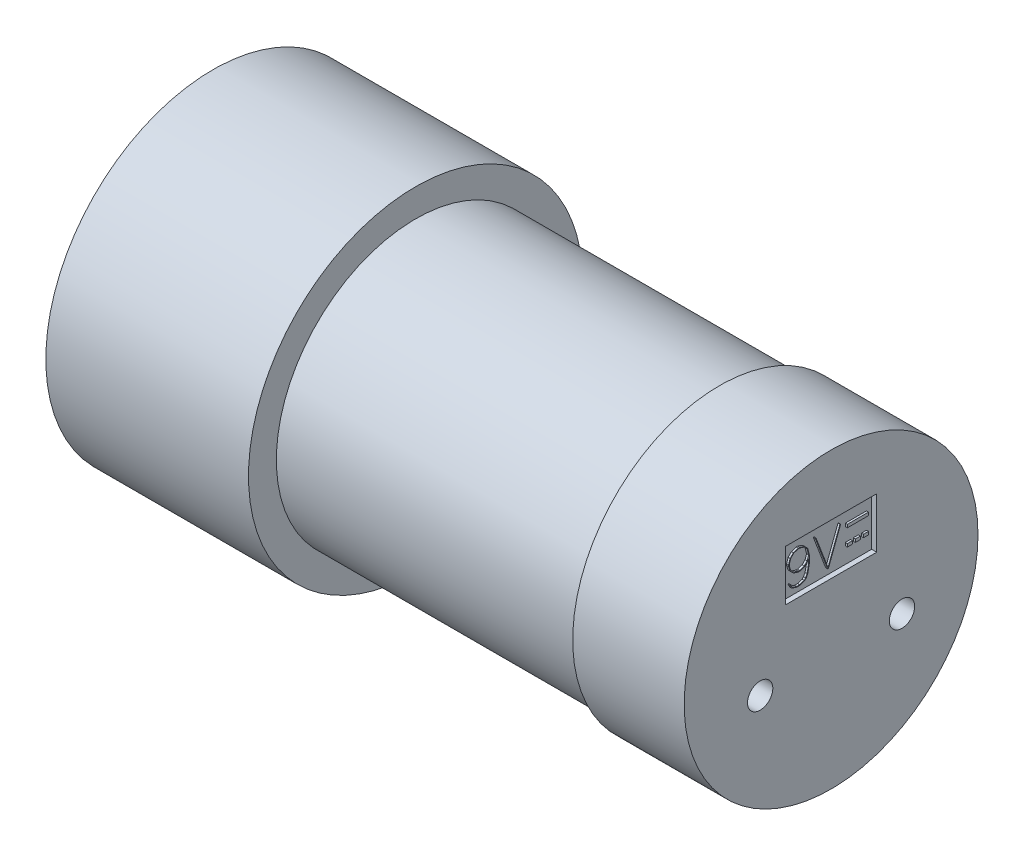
ISO-10303-21;
HEADER;
FILE_DESCRIPTION(('STEP AP214'),'2;1');
FILE_NAME('part.step','',(''),(''),'','','');
FILE_SCHEMA(('AUTOMOTIVE_DESIGN { 1 0 10303 214 1 1 1 1 }'));
ENDSEC;
DATA;
#1=APPLICATION_CONTEXT('core data for automotive mechanical design processes');
#2=APPLICATION_PROTOCOL_DEFINITION('international standard','automotive_design',2000,#1);
#3=PRODUCT_CONTEXT('',#1,'mechanical');
#4=PRODUCT('Part','Part','',(#3));
#5=PRODUCT_RELATED_PRODUCT_CATEGORY('part','',(#4));
#6=PRODUCT_DEFINITION_FORMATION('','',#4);
#7=PRODUCT_DEFINITION_CONTEXT('part definition',#1,'design');
#8=PRODUCT_DEFINITION('design','',#6,#7);
#9=PRODUCT_DEFINITION_SHAPE('','',#8);
#10=(LENGTH_UNIT() NAMED_UNIT(*) SI_UNIT(.MILLI.,.METRE.));
#11=(NAMED_UNIT(*) PLANE_ANGLE_UNIT() SI_UNIT($,.RADIAN.));
#12=(NAMED_UNIT(*) SI_UNIT($,.STERADIAN.) SOLID_ANGLE_UNIT());
#13=UNCERTAINTY_MEASURE_WITH_UNIT(LENGTH_MEASURE(1.E-05),#10,'distance_accuracy_value','');
#14=(GEOMETRIC_REPRESENTATION_CONTEXT(3) GLOBAL_UNCERTAINTY_ASSIGNED_CONTEXT((#13)) GLOBAL_UNIT_ASSIGNED_CONTEXT((#10,
#11,#12)) REPRESENTATION_CONTEXT('',''));
#15=CARTESIAN_POINT('',(0.,0.,0.));
#16=DIRECTION('',(0.,0.,1.));
#17=DIRECTION('',(1.,0.,0.));
#18=AXIS2_PLACEMENT_3D('',#15,#16,#17);
#19=CARTESIAN_POINT('',(-0.5,-6.,0.));
#20=DIRECTION('',(-1.,0.,0.));
#21=DIRECTION('',(0.,0.,1.));
#22=AXIS2_PLACEMENT_3D('',#19,#20,#21);
#23=PLANE('',#22);
#24=CARTESIAN_POINT('',(-0.5,-6.,0.));
#25=DIRECTION('',(-1.,0.,0.));
#26=DIRECTION('',(0.,0.,1.));
#27=AXIS2_PLACEMENT_3D('',#24,#25,#26);
#28=CIRCLE('',#27,3.);
#29=CARTESIAN_POINT('',(-0.5,-6.,3.));
#30=VERTEX_POINT('',#29);
#31=EDGE_CURVE('E1974',#30,#30,#28,.T.);
#32=ORIENTED_EDGE('',*,*,#31,.T.);
#33=EDGE_LOOP('',(#32));
#34=FACE_BOUND('',#33,.T.);
#35=CARTESIAN_POINT('',(-0.5,-6.,0.));
#36=DIRECTION('',(-1.,0.,0.));
#37=DIRECTION('',(0.,0.,1.));
#38=AXIS2_PLACEMENT_3D('',#35,#36,#37);
#39=CIRCLE('',#38,2.5);
#40=CARTESIAN_POINT('',(-0.5,-6.,2.5));
#41=VERTEX_POINT('',#40);
#42=EDGE_CURVE('E1965',#41,#41,#39,.T.);
#43=ORIENTED_EDGE('',*,*,#42,.F.);
#44=EDGE_LOOP('',(#43));
#45=FACE_BOUND('',#44,.T.);
#46=ADVANCED_FACE('F1452',(#34,#45),#23,.T.);
#47=CARTESIAN_POINT('',(0.,0.,0.));
#48=DIRECTION('',(1.,0.,0.));
#49=DIRECTION('',(0.,0.,-1.));
#50=AXIS2_PLACEMENT_3D('',#47,#48,#49);
#51=PLANE('',#50);
#52=CARTESIAN_POINT('',(0.,13.4,0.));
#53=DIRECTION('',(-1.,0.,0.));
#54=DIRECTION('',(0.,0.,1.));
#55=AXIS2_PLACEMENT_3D('',#52,#53,#54);
#56=CIRCLE('',#55,1.7);
#57=CARTESIAN_POINT('',(0.,13.4,1.7));
#58=VERTEX_POINT('',#57);
#59=EDGE_CURVE('E1954',#58,#58,#56,.T.);
#60=ORIENTED_EDGE('',*,*,#59,.F.);
#61=EDGE_LOOP('',(#60));
#62=FACE_BOUND('',#61,.T.);
#63=CARTESIAN_POINT('',(0.,0.,0.));
#64=DIRECTION('',(1.,0.,0.));
#65=DIRECTION('',(0.,0.,-1.));
#66=AXIS2_PLACEMENT_3D('',#63,#64,#65);
#67=CIRCLE('',#66,16.5);
#68=CARTESIAN_POINT('',(0.,0.,-16.5));
#69=VERTEX_POINT('',#68);
#70=EDGE_CURVE('E2733',#69,#69,#67,.T.);
#71=ORIENTED_EDGE('',*,*,#70,.F.);
#72=EDGE_LOOP('',(#71));
#73=FACE_BOUND('',#72,.T.);
#74=CARTESIAN_POINT('',(0.,0.,0.));
#75=DIRECTION('',(-1.,0.,0.));
#76=DIRECTION('',(0.,0.,1.));
#77=AXIS2_PLACEMENT_3D('',#74,#75,#76);
#78=CIRCLE('',#77,11.);
#79=CARTESIAN_POINT('',(0.,-9.,6.32455532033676));
#80=VERTEX_POINT('',#79);
#81=CARTESIAN_POINT('',(0.,-9.,-6.32455532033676));
#82=VERTEX_POINT('',#81);
#83=EDGE_CURVE('E1986',#80,#82,#78,.T.);
#84=ORIENTED_EDGE('',*,*,#83,.F.);
#85=CARTESIAN_POINT('',(0.,-6.,0.));
#86=DIRECTION('',(1.,0.,0.));
#87=DIRECTION('',(0.,0.,1.));
#88=AXIS2_PLACEMENT_3D('',#85,#86,#87);
#89=CIRCLE('',#88,7.);
#90=EDGE_CURVE('E1475',#82,#80,#89,.T.);
#91=ORIENTED_EDGE('',*,*,#90,.F.);
#92=EDGE_LOOP('',(#84,#91));
#93=FACE_BOUND('',#92,.T.);
#94=CARTESIAN_POINT('',(0.,-6.,0.));
#95=DIRECTION('',(1.,0.,0.));
#96=DIRECTION('',(0.,0.,-1.));
#97=AXIS2_PLACEMENT_3D('',#94,#95,#96);
#98=CIRCLE('',#97,5.);
#99=CARTESIAN_POINT('',(0.,-6.,-5.));
#100=VERTEX_POINT('',#99);
#101=EDGE_CURVE('E13',#100,#100,#98,.F.);
#102=ORIENTED_EDGE('',*,*,#101,.F.);
#103=EDGE_LOOP('',(#102));
#104=FACE_BOUND('',#103,.T.);
#105=ADVANCED_FACE('F2741',(#62,#73,#93,#104),#51,.F.);
#106=CARTESIAN_POINT('',(20.,0.,0.));
#107=DIRECTION('',(1.,0.,0.));
#108=DIRECTION('',(0.,0.,-1.));
#109=AXIS2_PLACEMENT_3D('',#106,#107,#108);
#110=PLANE('',#109);
#111=CARTESIAN_POINT('',(20.,0.,0.));
#112=DIRECTION('',(1.,0.,0.));
#113=DIRECTION('',(0.,0.,-1.));
#114=AXIS2_PLACEMENT_3D('',#111,#112,#113);
#115=CIRCLE('',#114,16.5);
#116=CARTESIAN_POINT('',(20.,0.,-16.5));
#117=VERTEX_POINT('',#116);
#118=EDGE_CURVE('E1460',#117,#117,#115,.T.);
#119=ORIENTED_EDGE('',*,*,#118,.T.);
#120=EDGE_LOOP('',(#119));
#121=FACE_BOUND('',#120,.T.);
#122=CARTESIAN_POINT('',(20.,0.,0.));
#123=DIRECTION('',(1.,0.,0.));
#124=DIRECTION('',(0.,0.,-1.));
#125=AXIS2_PLACEMENT_3D('',#122,#123,#124);
#126=CIRCLE('',#125,13.75);
#127=CARTESIAN_POINT('',(20.,0.,-13.75));
#128=VERTEX_POINT('',#127);
#129=EDGE_CURVE('E2727',#128,#128,#126,.T.);
#130=ORIENTED_EDGE('',*,*,#129,.F.);
#131=EDGE_LOOP('',(#130));
#132=FACE_BOUND('',#131,.T.);
#133=ADVANCED_FACE('F2744',(#121,#132),#110,.T.);
#134=CARTESIAN_POINT('',(20.,0.,0.));
#135=DIRECTION('',(-1.,0.,0.));
#136=DIRECTION('',(0.,0.,1.));
#137=AXIS2_PLACEMENT_3D('',#134,#135,#136);
#138=CYLINDRICAL_SURFACE('',#137,16.5);
#139=ORIENTED_EDGE('',*,*,#118,.F.);
#140=EDGE_LOOP('',(#139));
#141=FACE_BOUND('',#140,.T.);
#142=ORIENTED_EDGE('',*,*,#70,.T.);
#143=EDGE_LOOP('',(#142));
#144=FACE_BOUND('',#143,.T.);
#145=ADVANCED_FACE('F1454',(#141,#144),#138,.T.);
#146=CARTESIAN_POINT('',(50.,0.,0.));
#147=DIRECTION('',(-1.,0.,0.));
#148=DIRECTION('',(0.,0.,1.));
#149=AXIS2_PLACEMENT_3D('',#146,#147,#148);
#150=CYLINDRICAL_SURFACE('',#149,13.75);
#151=CARTESIAN_POINT('',(50.,0.,0.));
#152=DIRECTION('',(1.,0.,0.));
#153=DIRECTION('',(0.,0.,-1.));
#154=AXIS2_PLACEMENT_3D('',#151,#152,#153);
#155=CIRCLE('',#154,13.75);
#156=CARTESIAN_POINT('',(50.,0.,-13.75));
#157=VERTEX_POINT('',#156);
#158=EDGE_CURVE('E2730',#157,#157,#155,.T.);
#159=ORIENTED_EDGE('',*,*,#158,.F.);
#160=EDGE_LOOP('',(#159));
#161=FACE_BOUND('',#160,.T.);
#162=ORIENTED_EDGE('',*,*,#129,.T.);
#163=EDGE_LOOP('',(#162));
#164=FACE_BOUND('',#163,.T.);
#165=ADVANCED_FACE('F3784',(#161,#164),#150,.T.);
#166=CARTESIAN_POINT('',(50.,0.,0.));
#167=DIRECTION('',(1.,0.,0.));
#168=DIRECTION('',(0.,0.,-1.));
#169=AXIS2_PLACEMENT_3D('',#166,#167,#168);
#170=PLANE('',#169);
#171=CARTESIAN_POINT('',(50.,0.,0.));
#172=DIRECTION('',(1.,0.,0.));
#173=DIRECTION('',(0.,0.,-1.));
#174=AXIS2_PLACEMENT_3D('',#171,#172,#173);
#175=CIRCLE('',#174,14.5);
#176=CARTESIAN_POINT('',(50.,0.,-14.5));
#177=VERTEX_POINT('',#176);
#178=EDGE_CURVE('E2717',#177,#177,#175,.T.);
#179=ORIENTED_EDGE('',*,*,#178,.F.);
#180=EDGE_LOOP('',(#179));
#181=FACE_BOUND('',#180,.T.);
#182=ORIENTED_EDGE('',*,*,#158,.T.);
#183=EDGE_LOOP('',(#182));
#184=FACE_BOUND('',#183,.T.);
#185=ADVANCED_FACE('F3774',(#181,#184),#170,.F.);
#186=CARTESIAN_POINT('',(61.,0.,0.));
#187=DIRECTION('',(-1.,0.,0.));
#188=DIRECTION('',(0.,0.,1.));
#189=AXIS2_PLACEMENT_3D('',#186,#187,#188);
#190=CYLINDRICAL_SURFACE('',#189,14.5);
#191=CARTESIAN_POINT('',(61.,0.,0.));
#192=DIRECTION('',(1.,0.,0.));
#193=DIRECTION('',(0.,0.,-1.));
#194=AXIS2_PLACEMENT_3D('',#191,#192,#193);
#195=CIRCLE('',#194,14.5);
#196=CARTESIAN_POINT('',(61.,0.,-14.5));
#197=VERTEX_POINT('',#196);
#198=EDGE_CURVE('E2724',#197,#197,#195,.T.);
#199=ORIENTED_EDGE('',*,*,#198,.F.);
#200=EDGE_LOOP('',(#199));
#201=FACE_BOUND('',#200,.T.);
#202=ORIENTED_EDGE('',*,*,#178,.T.);
#203=EDGE_LOOP('',(#202));
#204=FACE_BOUND('',#203,.T.);
#205=ADVANCED_FACE('F2949',(#201,#204),#190,.T.);
#206=CARTESIAN_POINT('',(61.,0.,0.));
#207=DIRECTION('',(1.,0.,0.));
#208=DIRECTION('',(0.,0.,-1.));
#209=AXIS2_PLACEMENT_3D('',#206,#207,#208);
#210=PLANE('',#209);
#211=CARTESIAN_POINT('',(61.,-3.,-7.));
#212=DIRECTION('',(1.,0.,0.));
#213=DIRECTION('',(0.,0.,1.));
#214=AXIS2_PLACEMENT_3D('',#211,#212,#213);
#215=CIRCLE('',#214,1.25);
#216=CARTESIAN_POINT('',(61.,-3.,-5.75));
#217=VERTEX_POINT('',#216);
#218=EDGE_CURVE('E1995',#217,#217,#215,.T.);
#219=ORIENTED_EDGE('',*,*,#218,.F.);
#220=EDGE_LOOP('',(#219));
#221=FACE_BOUND('',#220,.T.);
#222=CARTESIAN_POINT('',(61.,-3.,7.));
#223=DIRECTION('',(1.,0.,0.));
#224=DIRECTION('',(0.,0.,-1.));
#225=AXIS2_PLACEMENT_3D('',#222,#223,#224);
#226=CIRCLE('',#225,1.25);
#227=CARTESIAN_POINT('',(61.,-3.,5.75));
#228=VERTEX_POINT('',#227);
#229=EDGE_CURVE('E2000',#228,#228,#226,.T.);
#230=ORIENTED_EDGE('',*,*,#229,.F.);
#231=EDGE_LOOP('',(#230));
#232=FACE_BOUND('',#231,.T.);
#233=DIRECTION('',(0.,0.,-1.));
#234=VECTOR('',#233,1.);
#235=CARTESIAN_POINT('',(61.,3.5,-4.5));
#236=LINE('',#235,#234);
#237=CARTESIAN_POINT('',(61.,3.5,4.5));
#238=VERTEX_POINT('',#237);
#239=CARTESIAN_POINT('',(61.,3.5,-4.5));
#240=VERTEX_POINT('',#239);
#241=EDGE_CURVE('E2690',#238,#240,#236,.T.);
#242=ORIENTED_EDGE('',*,*,#241,.F.);
#243=DIRECTION('',(0.,-1.,0.));
#244=VECTOR('',#243,1.);
#245=CARTESIAN_POINT('',(61.,3.5,4.5));
#246=LINE('',#245,#244);
#247=CARTESIAN_POINT('',(61.,8.5,4.5));
#248=VERTEX_POINT('',#247);
#249=EDGE_CURVE('E2696',#248,#238,#246,.T.);
#250=ORIENTED_EDGE('',*,*,#249,.F.);
#251=DIRECTION('',(0.,0.,1.));
#252=VECTOR('',#251,1.);
#253=CARTESIAN_POINT('',(61.,8.5,-4.5));
#254=LINE('',#253,#252);
#255=CARTESIAN_POINT('',(61.,8.5,-4.5));
#256=VERTEX_POINT('',#255);
#257=EDGE_CURVE('E2710',#256,#248,#254,.T.);
#258=ORIENTED_EDGE('',*,*,#257,.F.);
#259=DIRECTION('',(0.,1.,0.));
#260=VECTOR('',#259,1.);
#261=CARTESIAN_POINT('',(61.,3.5,-4.5));
#262=LINE('',#261,#260);
#263=EDGE_CURVE('E2707',#240,#256,#262,.T.);
#264=ORIENTED_EDGE('',*,*,#263,.F.);
#265=EDGE_LOOP('',(#242,#250,#258,#264));
#266=FACE_BOUND('',#265,.T.);
#267=ORIENTED_EDGE('',*,*,#198,.T.);
#268=EDGE_LOOP('',(#267));
#269=FACE_BOUND('',#268,.T.);
#270=ADVANCED_FACE('F2943',(#221,#232,#266,#269),#210,.T.);
#271=CARTESIAN_POINT('',(60.5,3.5,-4.5));
#272=DIRECTION('',(0.,-1.,0.));
#273=DIRECTION('',(0.,0.,-1.));
#274=AXIS2_PLACEMENT_3D('',#271,#272,#273);
#275=PLANE('',#274);
#276=ORIENTED_EDGE('',*,*,#241,.T.);
#277=DIRECTION('',(1.,0.,0.));
#278=VECTOR('',#277,1.);
#279=CARTESIAN_POINT('',(60.5,3.5,-4.5));
#280=LINE('',#279,#278);
#281=CARTESIAN_POINT('',(60.5,3.5,-4.5));
#282=VERTEX_POINT('',#281);
#283=EDGE_CURVE('E2705',#282,#240,#280,.T.);
#284=ORIENTED_EDGE('',*,*,#283,.F.);
#285=DIRECTION('',(0.,0.,-1.));
#286=VECTOR('',#285,1.);
#287=CARTESIAN_POINT('',(60.5,3.5,-4.5));
#288=LINE('',#287,#286);
#289=CARTESIAN_POINT('',(60.5,3.5,4.5));
#290=VERTEX_POINT('',#289);
#291=EDGE_CURVE('E2692',#290,#282,#288,.T.);
#292=ORIENTED_EDGE('',*,*,#291,.F.);
#293=DIRECTION('',(1.,0.,0.));
#294=VECTOR('',#293,1.);
#295=CARTESIAN_POINT('',(60.5,3.5,4.5));
#296=LINE('',#295,#294);
#297=EDGE_CURVE('E2715',#290,#238,#296,.T.);
#298=ORIENTED_EDGE('',*,*,#297,.T.);
#299=EDGE_LOOP('',(#276,#284,#292,#298));
#300=FACE_BOUND('',#299,.T.);
#301=ADVANCED_FACE('F2948',(#300),#275,.F.);
#302=CARTESIAN_POINT('',(60.5,3.5,4.5));
#303=DIRECTION('',(0.,0.,1.));
#304=DIRECTION('',(0.,-1.,0.));
#305=AXIS2_PLACEMENT_3D('',#302,#303,#304);
#306=PLANE('',#305);
#307=ORIENTED_EDGE('',*,*,#249,.T.);
#308=ORIENTED_EDGE('',*,*,#297,.F.);
#309=DIRECTION('',(0.,-1.,0.));
#310=VECTOR('',#309,1.);
#311=CARTESIAN_POINT('',(60.5,3.5,4.5));
#312=LINE('',#311,#310);
#313=CARTESIAN_POINT('',(60.5,8.5,4.5));
#314=VERTEX_POINT('',#313);
#315=EDGE_CURVE('E2702',#314,#290,#312,.T.);
#316=ORIENTED_EDGE('',*,*,#315,.F.);
#317=DIRECTION('',(1.,0.,0.));
#318=VECTOR('',#317,1.);
#319=CARTESIAN_POINT('',(60.5,8.5,4.5));
#320=LINE('',#319,#318);
#321=EDGE_CURVE('E2718',#314,#248,#320,.T.);
#322=ORIENTED_EDGE('',*,*,#321,.T.);
#323=EDGE_LOOP('',(#307,#308,#316,#322));
#324=FACE_BOUND('',#323,.T.);
#325=ADVANCED_FACE('F3750',(#324),#306,.F.);
#326=CARTESIAN_POINT('',(60.5,8.5,-4.5));
#327=DIRECTION('',(0.,1.,0.));
#328=DIRECTION('',(0.,0.,1.));
#329=AXIS2_PLACEMENT_3D('',#326,#327,#328);
#330=PLANE('',#329);
#331=ORIENTED_EDGE('',*,*,#257,.T.);
#332=ORIENTED_EDGE('',*,*,#321,.F.);
#333=DIRECTION('',(0.,0.,1.));
#334=VECTOR('',#333,1.);
#335=CARTESIAN_POINT('',(60.5,8.5,-4.5));
#336=LINE('',#335,#334);
#337=CARTESIAN_POINT('',(60.5,8.5,-4.5));
#338=VERTEX_POINT('',#337);
#339=EDGE_CURVE('E2699',#338,#314,#336,.T.);
#340=ORIENTED_EDGE('',*,*,#339,.F.);
#341=DIRECTION('',(1.,0.,0.));
#342=VECTOR('',#341,1.);
#343=CARTESIAN_POINT('',(60.5,8.5,-4.5));
#344=LINE('',#343,#342);
#345=EDGE_CURVE('E2720',#338,#256,#344,.T.);
#346=ORIENTED_EDGE('',*,*,#345,.T.);
#347=EDGE_LOOP('',(#331,#332,#340,#346));
#348=FACE_BOUND('',#347,.T.);
#349=ADVANCED_FACE('F3740',(#348),#330,.F.);
#350=CARTESIAN_POINT('',(60.5,3.5,-4.5));
#351=DIRECTION('',(0.,0.,-1.));
#352=DIRECTION('',(-1.,0.,0.));
#353=AXIS2_PLACEMENT_3D('',#350,#351,#352);
#354=PLANE('',#353);
#355=ORIENTED_EDGE('',*,*,#263,.T.);
#356=ORIENTED_EDGE('',*,*,#345,.F.);
#357=DIRECTION('',(0.,1.,0.));
#358=VECTOR('',#357,1.);
#359=CARTESIAN_POINT('',(60.5,3.5,-4.5));
#360=LINE('',#359,#358);
#361=EDGE_CURVE('E2695',#282,#338,#360,.T.);
#362=ORIENTED_EDGE('',*,*,#361,.F.);
#363=ORIENTED_EDGE('',*,*,#283,.T.);
#364=EDGE_LOOP('',(#355,#356,#362,#363));
#365=FACE_BOUND('',#364,.T.);
#366=ADVANCED_FACE('F3731',(#365),#354,.F.);
#367=CARTESIAN_POINT('',(60.5,0.,0.));
#368=DIRECTION('',(-1.,0.,0.));
#369=DIRECTION('',(0.,0.,1.));
#370=AXIS2_PLACEMENT_3D('',#367,#368,#369);
#371=PLANE('',#370);
#372=DIRECTION('',(0.,0.,1.));
#373=VECTOR('',#372,1.);
#374=CARTESIAN_POINT('',(60.5,5.38690541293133,-3.5));
#375=LINE('',#374,#373);
#376=CARTESIAN_POINT('',(60.5,5.38690541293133,-4.));
#377=VERTEX_POINT('',#376);
#378=CARTESIAN_POINT('',(60.5,5.38690541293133,-3.5));
#379=VERTEX_POINT('',#378);
#380=EDGE_CURVE('E2014',#377,#379,#375,.T.);
#381=ORIENTED_EDGE('',*,*,#380,.F.);
#382=DIRECTION('',(0.,1.,0.));
#383=VECTOR('',#382,1.);
#384=CARTESIAN_POINT('',(60.5,5.38690541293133,-4.));
#385=LINE('',#384,#383);
#386=CARTESIAN_POINT('',(60.5,5.08690541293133,-4.));
#387=VERTEX_POINT('',#386);
#388=EDGE_CURVE('E2030',#387,#377,#385,.T.);
#389=ORIENTED_EDGE('',*,*,#388,.F.);
#390=DIRECTION('',(0.,0.,-1.));
#391=VECTOR('',#390,1.);
#392=CARTESIAN_POINT('',(60.5,5.08690541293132,-3.5));
#393=LINE('',#392,#391);
#394=CARTESIAN_POINT('',(60.5,5.08690541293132,-3.5));
#395=VERTEX_POINT('',#394);
#396=EDGE_CURVE('E2034',#395,#387,#393,.T.);
#397=ORIENTED_EDGE('',*,*,#396,.F.);
#398=DIRECTION('',(0.,-1.,0.));
#399=VECTOR('',#398,1.);
#400=CARTESIAN_POINT('',(60.5,5.38690541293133,-3.5));
#401=LINE('',#400,#399);
#402=EDGE_CURVE('E2006',#379,#395,#401,.T.);
#403=ORIENTED_EDGE('',*,*,#402,.F.);
#404=EDGE_LOOP('',(#381,#389,#397,#403));
#405=FACE_BOUND('',#404,.T.);
#406=DIRECTION('',(0.,0.,1.));
#407=VECTOR('',#406,1.);
#408=CARTESIAN_POINT('',(60.5,5.38690541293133,-2.7));
#409=LINE('',#408,#407);
#410=CARTESIAN_POINT('',(60.5,5.38690541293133,-3.2));
#411=VERTEX_POINT('',#410);
#412=CARTESIAN_POINT('',(60.5,5.38690541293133,-2.7));
#413=VERTEX_POINT('',#412);
#414=EDGE_CURVE('E2053',#411,#413,#409,.T.);
#415=ORIENTED_EDGE('',*,*,#414,.F.);
#416=DIRECTION('',(0.,1.,0.));
#417=VECTOR('',#416,1.);
#418=CARTESIAN_POINT('',(60.5,5.38690541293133,-3.2));
#419=LINE('',#418,#417);
#420=CARTESIAN_POINT('',(60.5,5.08690541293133,-3.2));
#421=VERTEX_POINT('',#420);
#422=EDGE_CURVE('E2069',#421,#411,#419,.T.);
#423=ORIENTED_EDGE('',*,*,#422,.F.);
#424=DIRECTION('',(0.,0.,-1.));
#425=VECTOR('',#424,1.);
#426=CARTESIAN_POINT('',(60.5,5.08690541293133,-2.7));
#427=LINE('',#426,#425);
#428=CARTESIAN_POINT('',(60.5,5.08690541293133,-2.7));
#429=VERTEX_POINT('',#428);
#430=EDGE_CURVE('E2073',#429,#421,#427,.T.);
#431=ORIENTED_EDGE('',*,*,#430,.F.);
#432=DIRECTION('',(0.,-1.,0.));
#433=VECTOR('',#432,1.);
#434=CARTESIAN_POINT('',(60.5,5.38690541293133,-2.7));
#435=LINE('',#434,#433);
#436=EDGE_CURVE('E2046',#413,#429,#435,.T.);
#437=ORIENTED_EDGE('',*,*,#436,.F.);
#438=EDGE_LOOP('',(#415,#423,#431,#437));
#439=FACE_BOUND('',#438,.T.);
#440=DIRECTION('',(0.,0.,1.));
#441=VECTOR('',#440,1.);
#442=CARTESIAN_POINT('',(60.5,5.38690541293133,-1.9));
#443=LINE('',#442,#441);
#444=CARTESIAN_POINT('',(60.5,5.38690541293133,-2.4));
#445=VERTEX_POINT('',#444);
#446=CARTESIAN_POINT('',(60.5,5.38690541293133,-1.9));
#447=VERTEX_POINT('',#446);
#448=EDGE_CURVE('E2092',#445,#447,#443,.T.);
#449=ORIENTED_EDGE('',*,*,#448,.F.);
#450=DIRECTION('',(0.,1.,0.));
#451=VECTOR('',#450,1.);
#452=CARTESIAN_POINT('',(60.5,5.38690541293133,-2.4));
#453=LINE('',#452,#451);
#454=CARTESIAN_POINT('',(60.5,5.08690541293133,-2.4));
#455=VERTEX_POINT('',#454);
#456=EDGE_CURVE('E2108',#455,#445,#453,.T.);
#457=ORIENTED_EDGE('',*,*,#456,.F.);
#458=DIRECTION('',(0.,0.,-1.));
#459=VECTOR('',#458,1.);
#460=CARTESIAN_POINT('',(60.5,5.08690541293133,-1.9));
#461=LINE('',#460,#459);
#462=CARTESIAN_POINT('',(60.5,5.08690541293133,-1.9));
#463=VERTEX_POINT('',#462);
#464=EDGE_CURVE('E2112',#463,#455,#461,.T.);
#465=ORIENTED_EDGE('',*,*,#464,.F.);
#466=DIRECTION('',(0.,-1.,0.));
#467=VECTOR('',#466,1.);
#468=CARTESIAN_POINT('',(60.5,5.38690541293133,-1.9));
#469=LINE('',#468,#467);
#470=EDGE_CURVE('E2085',#447,#463,#469,.T.);
#471=ORIENTED_EDGE('',*,*,#470,.F.);
#472=EDGE_LOOP('',(#449,#457,#465,#471));
#473=FACE_BOUND('',#472,.T.);
#474=DIRECTION('',(0.,0.,1.));
#475=VECTOR('',#474,1.);
#476=CARTESIAN_POINT('',(60.5,7.03308903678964,-1.9));
#477=LINE('',#476,#475);
#478=CARTESIAN_POINT('',(60.5,7.03308903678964,-4.));
#479=VERTEX_POINT('',#478);
#480=CARTESIAN_POINT('',(60.5,7.03308903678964,-1.9));
#481=VERTEX_POINT('',#480);
#482=EDGE_CURVE('E2131',#479,#481,#477,.T.);
#483=ORIENTED_EDGE('',*,*,#482,.F.);
#484=DIRECTION('',(0.,1.,0.));
#485=VECTOR('',#484,1.);
#486=CARTESIAN_POINT('',(60.5,6.73308903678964,-4.));
#487=LINE('',#486,#485);
#488=CARTESIAN_POINT('',(60.5,6.73308903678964,-4.));
#489=VERTEX_POINT('',#488);
#490=EDGE_CURVE('E2148',#489,#479,#487,.T.);
#491=ORIENTED_EDGE('',*,*,#490,.F.);
#492=DIRECTION('',(0.,0.,-1.));
#493=VECTOR('',#492,1.);
#494=CARTESIAN_POINT('',(60.5,6.73308903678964,-1.9));
#495=LINE('',#494,#493);
#496=CARTESIAN_POINT('',(60.5,6.73308903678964,-1.9));
#497=VERTEX_POINT('',#496);
#498=EDGE_CURVE('E2144',#497,#489,#495,.T.);
#499=ORIENTED_EDGE('',*,*,#498,.F.);
#500=DIRECTION('',(0.,-1.,0.));
#501=VECTOR('',#500,1.);
#502=CARTESIAN_POINT('',(60.5,6.73308903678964,-1.9));
#503=LINE('',#502,#501);
#504=EDGE_CURVE('E2124',#481,#497,#503,.T.);
#505=ORIENTED_EDGE('',*,*,#504,.F.);
#506=EDGE_LOOP('',(#483,#491,#499,#505));
#507=FACE_BOUND('',#506,.T.);
#508=DIRECTION('',(0.,-0.934677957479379,0.355495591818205));
#509=VECTOR('',#508,1.);
#510=CARTESIAN_POINT('',(60.5,7.375,-1.24150019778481));
#511=LINE('',#510,#509);
#512=CARTESIAN_POINT('',(60.5,7.375,-1.24150019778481));
#513=VERTEX_POINT('',#512);
#514=CARTESIAN_POINT('',(60.5,4.2,-0.0339200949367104));
#515=VERTEX_POINT('',#514);
#516=EDGE_CURVE('E2186',#513,#515,#511,.T.);
#517=ORIENTED_EDGE('',*,*,#516,.T.);
#518=DIRECTION('',(0.,0.,1.));
#519=VECTOR('',#518,1.);
#520=CARTESIAN_POINT('',(60.5,4.2,-0.0339200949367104));
#521=LINE('',#520,#519);
#522=CARTESIAN_POINT('',(60.5,4.2,0.0382960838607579));
#523=VERTEX_POINT('',#522);
#524=EDGE_CURVE('E2182',#515,#523,#521,.T.);
#525=ORIENTED_EDGE('',*,*,#524,.T.);
#526=DIRECTION('',(0.,0.934968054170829,0.354731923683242));
#527=VECTOR('',#526,1.);
#528=CARTESIAN_POINT('',(60.5,4.2,0.0382960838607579));
#529=LINE('',#528,#527);
#530=CARTESIAN_POINT('',(60.5,7.38944323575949,1.24838805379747));
#531=VERTEX_POINT('',#530);
#532=EDGE_CURVE('E2178',#523,#531,#529,.T.);
#533=ORIENTED_EDGE('',*,*,#532,.T.);
#534=DIRECTION('',(0.,0.399795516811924,-0.916604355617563));
#535=VECTOR('',#534,1.);
#536=CARTESIAN_POINT('',(60.5,7.38944323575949,1.24838805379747));
#537=LINE('',#536,#535);
#538=CARTESIAN_POINT('',(60.5,7.41518987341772,1.18935917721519));
#539=VERTEX_POINT('',#538);
#540=EDGE_CURVE('E2174',#531,#539,#537,.T.);
#541=ORIENTED_EDGE('',*,*,#540,.T.);
#542=DIRECTION('',(0.,-0.934648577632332,-0.355572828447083));
#543=VECTOR('',#542,1.);
#544=CARTESIAN_POINT('',(60.5,7.41518987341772,1.18935917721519));
#545=LINE('',#544,#543);
#546=CARTESIAN_POINT('',(60.5,4.29545094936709,0.00250197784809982));
#547=VERTEX_POINT('',#546);
#548=EDGE_CURVE('E2170',#539,#547,#545,.T.);
#549=ORIENTED_EDGE('',*,*,#548,.T.);
#550=DIRECTION('',(0.,0.934263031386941,-0.356584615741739));
#551=VECTOR('',#550,1.);
#552=CARTESIAN_POINT('',(60.5,4.29545094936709,0.00250197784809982));
#553=LINE('',#552,#551);
#554=CARTESIAN_POINT('',(60.5,7.40011867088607,-1.18247132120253));
#555=VERTEX_POINT('',#554);
#556=EDGE_CURVE('E2165',#547,#555,#553,.T.);
#557=ORIENTED_EDGE('',*,*,#556,.T.);
#558=DIRECTION('',(0.,-0.391555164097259,-0.920154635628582));
#559=VECTOR('',#558,1.);
#560=CARTESIAN_POINT('',(60.5,7.40011867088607,-1.18247132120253));
#561=LINE('',#560,#559);
#562=EDGE_CURVE('E2190',#555,#513,#561,.T.);
#563=ORIENTED_EDGE('',*,*,#562,.T.);
#564=EDGE_LOOP('',(#517,#525,#533,#541,#549,#557,#563));
#565=FACE_BOUND('',#564,.T.);
#566=DIRECTION('',(0.,-0.948911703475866,0.315541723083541));
#567=VECTOR('',#566,1.);
#568=CARTESIAN_POINT('',(60.5,6.10525118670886,1.91654469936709));
#569=LINE('',#568,#567);
#570=CARTESIAN_POINT('',(60.5,6.10525118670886,1.91654469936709));
#571=VERTEX_POINT('',#570);
#572=CARTESIAN_POINT('',(60.5,5.84464497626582,2.00320411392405));
#573=VERTEX_POINT('',#572);
#574=EDGE_CURVE('E2492',#571,#573,#569,.T.);
#575=ORIENTED_EDGE('',*,*,#574,.T.);
#576=DIRECTION('',(0.,-0.707106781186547,0.707106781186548));
#577=VECTOR('',#576,1.);
#578=CARTESIAN_POINT('',(60.5,5.84464497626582,2.00320411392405));
#579=LINE('',#578,#577);
#580=CARTESIAN_POINT('',(60.5,5.52689378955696,2.32095530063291));
#581=VERTEX_POINT('',#580);
#582=EDGE_CURVE('E2488',#573,#581,#579,.T.);
#583=ORIENTED_EDGE('',*,*,#582,.T.);
#584=DIRECTION('',(0.,-0.317752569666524,0.948173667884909));
#585=VECTOR('',#584,1.);
#586=CARTESIAN_POINT('',(60.5,5.52689378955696,2.32095530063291));
#587=LINE('',#586,#585);
#588=CARTESIAN_POINT('',(60.5,5.36990209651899,2.78941851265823));
#589=VERTEX_POINT('',#588);
#590=EDGE_CURVE('E2484',#581,#589,#587,.T.);
#591=ORIENTED_EDGE('',*,*,#590,.T.);
#592=DIRECTION('',(0.,0.,1.));
#593=VECTOR('',#592,1.);
#594=CARTESIAN_POINT('',(60.5,5.36990209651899,2.78941851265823));
#595=LINE('',#594,#593);
#596=CARTESIAN_POINT('',(60.5,5.36990209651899,2.95080597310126));
#597=VERTEX_POINT('',#596);
#598=EDGE_CURVE('E2480',#589,#597,#595,.T.);
#599=ORIENTED_EDGE('',*,*,#598,.T.);
#600=DIRECTION('',(0.,0.317752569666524,0.948173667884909));
#601=VECTOR('',#600,1.);
#602=CARTESIAN_POINT('',(60.5,5.36990209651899,2.95080597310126));
#603=LINE('',#602,#601);
#604=CARTESIAN_POINT('',(60.5,5.52689378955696,3.41926918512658));
#605=VERTEX_POINT('',#604);
#606=EDGE_CURVE('E2476',#597,#605,#603,.T.);
#607=ORIENTED_EDGE('',*,*,#606,.T.);
#608=DIRECTION('',(0.,0.707106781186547,0.707106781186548));
#609=VECTOR('',#608,1.);
#610=CARTESIAN_POINT('',(60.5,5.52689378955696,3.41926918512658));
#611=LINE('',#610,#609);
#612=CARTESIAN_POINT('',(60.5,5.84464497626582,3.73702037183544));
#613=VERTEX_POINT('',#612);
#614=EDGE_CURVE('E2472',#605,#613,#611,.T.);
#615=ORIENTED_EDGE('',*,*,#614,.T.);
#616=DIRECTION('',(0.,0.949696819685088,0.313170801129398));
#617=VECTOR('',#616,1.);
#618=CARTESIAN_POINT('',(60.5,5.84464497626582,3.73702037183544));
#619=LINE('',#618,#617);
#620=CARTESIAN_POINT('',(60.5,6.31310818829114,3.89150019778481));
#621=VERTEX_POINT('',#620);
#622=EDGE_CURVE('E2468',#613,#621,#619,.T.);
#623=ORIENTED_EDGE('',*,*,#622,.T.);
#624=DIRECTION('',(0.,1.,0.));
#625=VECTOR('',#624,1.);
#626=CARTESIAN_POINT('',(60.5,6.31310818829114,3.89150019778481));
#627=LINE('',#626,#625);
#628=CARTESIAN_POINT('',(60.5,6.47386768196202,3.89150019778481));
#629=VERTEX_POINT('',#628);
#630=EDGE_CURVE('E2464',#621,#629,#627,.T.);
#631=ORIENTED_EDGE('',*,*,#630,.T.);
#632=DIRECTION('',(0.,0.949696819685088,-0.313170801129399));
#633=VECTOR('',#632,1.);
#634=CARTESIAN_POINT('',(60.5,6.47386768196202,3.89150019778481));
#635=LINE('',#634,#633);
#636=CARTESIAN_POINT('',(60.5,6.94233089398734,3.73702037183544));
#637=VERTEX_POINT('',#636);
#638=EDGE_CURVE('E2460',#629,#637,#635,.T.);
#639=ORIENTED_EDGE('',*,*,#638,.T.);
#640=DIRECTION('',(0.,0.705001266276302,-0.709206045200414));
#641=VECTOR('',#640,1.);
#642=CARTESIAN_POINT('',(60.5,6.94233089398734,3.73702037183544));
#643=LINE('',#642,#641);
#644=CARTESIAN_POINT('',(60.5,7.25819818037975,3.41926918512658));
#645=VERTEX_POINT('',#644);
#646=EDGE_CURVE('E2456',#637,#645,#643,.T.);
#647=ORIENTED_EDGE('',*,*,#646,.T.);
#648=DIRECTION('',(0.,0.317752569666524,-0.948173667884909));
#649=VECTOR('',#648,1.);
#650=CARTESIAN_POINT('',(60.5,7.25819818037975,3.41926918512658));
#651=LINE('',#650,#649);
#652=CARTESIAN_POINT('',(60.5,7.41518987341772,2.95080597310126));
#653=VERTEX_POINT('',#652);
#654=EDGE_CURVE('E2452',#645,#653,#651,.T.);
#655=ORIENTED_EDGE('',*,*,#654,.T.);
#656=DIRECTION('',(0.,0.,-1.));
#657=VECTOR('',#656,1.);
#658=CARTESIAN_POINT('',(60.5,7.41518987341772,2.95080597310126));
#659=LINE('',#658,#657);
#660=CARTESIAN_POINT('',(60.5,7.41518987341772,2.78941851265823));
#661=VERTEX_POINT('',#660);
#662=EDGE_CURVE('E2448',#653,#661,#659,.T.);
#663=ORIENTED_EDGE('',*,*,#662,.T.);
#664=DIRECTION('',(0.,-0.317752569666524,-0.948173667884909));
#665=VECTOR('',#664,1.);
#666=CARTESIAN_POINT('',(60.5,7.41518987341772,2.78941851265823));
#667=LINE('',#666,#665);
#668=CARTESIAN_POINT('',(60.5,7.25819818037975,2.32095530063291));
#669=VERTEX_POINT('',#668);
#670=EDGE_CURVE('E2444',#661,#669,#667,.T.);
#671=ORIENTED_EDGE('',*,*,#670,.T.);
#672=DIRECTION('',(0.,-0.705001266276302,-0.709206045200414));
#673=VECTOR('',#672,1.);
#674=CARTESIAN_POINT('',(60.5,7.25819818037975,2.32095530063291));
#675=LINE('',#674,#673);
#676=CARTESIAN_POINT('',(60.5,6.94233089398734,2.00320411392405));
#677=VERTEX_POINT('',#676);
#678=EDGE_CURVE('E2440',#669,#677,#675,.T.);
#679=ORIENTED_EDGE('',*,*,#678,.T.);
#680=DIRECTION('',(0.,-0.970373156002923,-0.24161112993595));
#681=VECTOR('',#680,1.);
#682=CARTESIAN_POINT('',(60.5,6.94233089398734,2.00320411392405));
#683=LINE('',#682,#681);
#684=CARTESIAN_POINT('',(60.5,6.32189972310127,1.84872428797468));
#685=VERTEX_POINT('',#684);
#686=EDGE_CURVE('E2436',#677,#685,#683,.T.);
#687=ORIENTED_EDGE('',*,*,#686,.T.);
#688=DIRECTION('',(0.,-1.,0.));
#689=VECTOR('',#688,1.);
#690=CARTESIAN_POINT('',(60.5,6.32189972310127,1.84872428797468));
#691=LINE('',#690,#689);
#692=CARTESIAN_POINT('',(60.5,5.55201246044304,1.84872428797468));
#693=VERTEX_POINT('',#692);
#694=EDGE_CURVE('E2432',#685,#693,#691,.T.);
#695=ORIENTED_EDGE('',*,*,#694,.T.);
#696=DIRECTION('',(0.,-0.981376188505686,0.19209574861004));
#697=VECTOR('',#696,1.);
#698=CARTESIAN_POINT('',(60.5,5.55201246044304,1.84872428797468));
#699=LINE('',#698,#697);
#700=CARTESIAN_POINT('',(60.5,4.78526503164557,1.99880834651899));
#701=VERTEX_POINT('',#700);
#702=EDGE_CURVE('E2428',#693,#701,#699,.T.);
#703=ORIENTED_EDGE('',*,*,#702,.T.);
#704=DIRECTION('',(0.,-0.892982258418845,0.450091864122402));
#705=VECTOR('',#704,1.);
#706=CARTESIAN_POINT('',(60.5,4.78526503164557,1.99880834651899));
#707=LINE('',#706,#705);
#708=CARTESIAN_POINT('',(60.5,4.47379351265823,2.15580003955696));
#709=VERTEX_POINT('',#708);
#710=EDGE_CURVE('E2424',#701,#709,#707,.T.);
#711=ORIENTED_EDGE('',*,*,#710,.T.);
#712=DIRECTION('',(0.,-0.698901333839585,0.715218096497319));
#713=VECTOR('',#712,1.);
#714=CARTESIAN_POINT('',(60.5,4.47379351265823,2.15580003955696));
#715=LINE('',#714,#713);
#716=CARTESIAN_POINT('',(60.5,4.31240605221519,2.32095530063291));
#717=VERTEX_POINT('',#716);
#718=EDGE_CURVE('E2420',#709,#717,#715,.T.);
#719=ORIENTED_EDGE('',*,*,#718,.T.);
#720=DIRECTION('',(0.,-0.309720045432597,0.950827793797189));
#721=VECTOR('',#720,1.);
#722=CARTESIAN_POINT('',(60.5,4.31240605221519,2.32095530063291));
#723=LINE('',#722,#721);
#724=CARTESIAN_POINT('',(60.5,4.15981012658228,2.78941851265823));
#725=VERTEX_POINT('',#724);
#726=EDGE_CURVE('E2416',#717,#725,#723,.T.);
#727=ORIENTED_EDGE('',*,*,#726,.T.);
#728=DIRECTION('',(0.,0.,1.));
#729=VECTOR('',#728,1.);
#730=CARTESIAN_POINT('',(60.5,4.15981012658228,2.78941851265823));
#731=LINE('',#730,#729);
#732=CARTESIAN_POINT('',(60.5,4.15981012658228,3.10340189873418));
#733=VERTEX_POINT('',#732);
#734=EDGE_CURVE('E2412',#725,#733,#731,.T.);
#735=ORIENTED_EDGE('',*,*,#734,.T.);
#736=DIRECTION('',(0.,0.304912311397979,0.952380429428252));
#737=VECTOR('',#736,1.);
#738=CARTESIAN_POINT('',(60.5,4.15981012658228,3.10340189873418));
#739=LINE('',#738,#737);
#740=CARTESIAN_POINT('',(60.5,4.31240605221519,3.58002867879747));
#741=VERTEX_POINT('',#740);
#742=EDGE_CURVE('E2408',#733,#741,#739,.T.);
#743=ORIENTED_EDGE('',*,*,#742,.T.);
#744=DIRECTION('',(0.,0.895492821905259,0.445075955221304));
#745=VECTOR('',#744,1.);
#746=CARTESIAN_POINT('',(60.5,4.31240605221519,3.58002867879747));
#747=LINE('',#746,#745);
#748=CARTESIAN_POINT('',(60.5,4.62827333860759,3.73702037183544));
#749=VERTEX_POINT('',#748);
#750=EDGE_CURVE('E2404',#741,#749,#747,.T.);
#751=ORIENTED_EDGE('',*,*,#750,.T.);
#752=DIRECTION('',(0.,0.502773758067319,-0.864418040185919));
#753=VECTOR('',#752,1.);
#754=CARTESIAN_POINT('',(60.5,4.62827333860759,3.73702037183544));
#755=LINE('',#754,#753);
#756=CARTESIAN_POINT('',(60.5,4.66406744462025,3.67547962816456));
#757=VERTEX_POINT('',#756);
#758=EDGE_CURVE('E2400',#749,#757,#755,.T.);
#759=ORIENTED_EDGE('',*,*,#758,.T.);
#760=DIRECTION('',(0.,-0.892118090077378,-0.451802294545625));
#761=VECTOR('',#760,1.);
#762=CARTESIAN_POINT('',(60.5,4.66406744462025,3.67547962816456));
#763=LINE('',#762,#761);
#764=CARTESIAN_POINT('',(60.5,4.37143492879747,3.52727946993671));
#765=VERTEX_POINT('',#764);
#766=EDGE_CURVE('E2396',#757,#765,#763,.T.);
#767=ORIENTED_EDGE('',*,*,#766,.T.);
#768=DIRECTION('',(0.,-0.317871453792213,-0.948133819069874));
#769=VECTOR('',#768,1.);
#770=CARTESIAN_POINT('',(60.5,4.37143492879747,3.52727946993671));
#771=LINE('',#770,#769);
#772=CARTESIAN_POINT('',(60.5,4.22574663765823,3.09272646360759));
#773=VERTEX_POINT('',#772);
#774=EDGE_CURVE('E2392',#765,#773,#771,.T.);
#775=ORIENTED_EDGE('',*,*,#774,.T.);
#776=DIRECTION('',(0.,0.,-1.));
#777=VECTOR('',#776,1.);
#778=CARTESIAN_POINT('',(60.5,4.22574663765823,3.09272646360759));
#779=LINE('',#778,#777);
#780=CARTESIAN_POINT('',(60.5,4.22574663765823,2.79821004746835));
#781=VERTEX_POINT('',#780);
#782=EDGE_CURVE('E2388',#773,#781,#779,.T.);
#783=ORIENTED_EDGE('',*,*,#782,.T.);
#784=DIRECTION('',(0.,0.312187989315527,-0.950020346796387));
#785=VECTOR('',#784,1.);
#786=CARTESIAN_POINT('',(60.5,4.22574663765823,2.79821004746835));
#787=LINE('',#786,#785);
#788=CARTESIAN_POINT('',(60.5,4.37143492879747,2.35486550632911));
#789=VERTEX_POINT('',#788);
#790=EDGE_CURVE('E2384',#781,#789,#787,.T.);
#791=ORIENTED_EDGE('',*,*,#790,.T.);
#792=DIRECTION('',(0.,0.724212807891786,-0.689576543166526));
#793=VECTOR('',#792,1.);
#794=CARTESIAN_POINT('',(60.5,4.37143492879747,2.35486550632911));
#795=LINE('',#794,#793);
#796=CARTESIAN_POINT('',(60.5,4.5158672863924,2.21734078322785));
#797=VERTEX_POINT('',#796);
#798=EDGE_CURVE('E2380',#789,#797,#795,.T.);
#799=ORIENTED_EDGE('',*,*,#798,.T.);
#800=DIRECTION('',(0.,0.893281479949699,-0.449497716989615));
#801=VECTOR('',#800,1.);
#802=CARTESIAN_POINT('',(60.5,4.5158672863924,2.21734078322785));
#803=LINE('',#802,#801);
#804=CARTESIAN_POINT('',(60.5,4.81038370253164,2.069140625));
#805=VERTEX_POINT('',#804);
#806=EDGE_CURVE('E2376',#797,#805,#803,.T.);
#807=ORIENTED_EDGE('',*,*,#806,.T.);
#808=DIRECTION('',(0.,0.980042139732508,-0.19878984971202));
#809=VECTOR('',#808,1.);
#810=CARTESIAN_POINT('',(60.5,4.81038370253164,2.069140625));
#811=LINE('',#810,#809);
#812=CARTESIAN_POINT('',(60.5,5.56268789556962,1.91654469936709));
#813=VERTEX_POINT('',#812);
#814=EDGE_CURVE('E2371',#805,#813,#811,.T.);
#815=ORIENTED_EDGE('',*,*,#814,.T.);
#816=DIRECTION('',(0.,1.,0.));
#817=VECTOR('',#816,1.);
#818=CARTESIAN_POINT('',(60.5,5.56268789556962,1.91654469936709));
#819=LINE('',#818,#817);
#820=EDGE_CURVE('E2496',#813,#571,#819,.T.);
#821=ORIENTED_EDGE('',*,*,#820,.T.);
#822=EDGE_LOOP('',(#575,#583,#591,#599,#607,#615,#623,#631,#639,#647,#655,#663,#671,#679,#687,
#695,#703,#711,#719,#727,#735,#743,#751,#759,#767,#775,#783,#791,#799,#807,#815,#821));
#823=FACE_BOUND('',#822,.T.);
#824=ORIENTED_EDGE('',*,*,#291,.T.);
#825=ORIENTED_EDGE('',*,*,#361,.T.);
#826=ORIENTED_EDGE('',*,*,#339,.T.);
#827=ORIENTED_EDGE('',*,*,#315,.T.);
#828=EDGE_LOOP('',(#824,#825,#826,#827));
#829=FACE_BOUND('',#828,.T.);
#830=ADVANCED_FACE('F3245',(#405,#439,#473,#507,#565,#823,#829),#371,.F.);
#831=CARTESIAN_POINT('',(60.5,5.84464497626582,2.00320411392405));
#832=DIRECTION('',(0.,-0.707106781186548,-0.707106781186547));
#833=DIRECTION('',(0.,-0.707106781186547,0.707106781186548));
#834=AXIS2_PLACEMENT_3D('',#831,#832,#833);
#835=PLANE('',#834);
#836=DIRECTION('',(-1.,0.,0.));
#837=VECTOR('',#836,1.);
#838=CARTESIAN_POINT('',(60.5,5.84464497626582,2.00320411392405));
#839=LINE('',#838,#837);
#840=CARTESIAN_POINT('',(60.7,5.84464497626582,2.00320411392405));
#841=VERTEX_POINT('',#840);
#842=EDGE_CURVE('E2687',#841,#573,#839,.T.);
#843=ORIENTED_EDGE('',*,*,#842,.F.);
#844=DIRECTION('',(0.,-0.707106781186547,0.707106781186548));
#845=VECTOR('',#844,1.);
#846=CARTESIAN_POINT('',(60.7,5.84464497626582,2.00320411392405));
#847=LINE('',#846,#845);
#848=CARTESIAN_POINT('',(60.7,5.52689378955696,2.32095530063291));
#849=VERTEX_POINT('',#848);
#850=EDGE_CURVE('E2620',#841,#849,#847,.T.);
#851=ORIENTED_EDGE('',*,*,#850,.T.);
#852=DIRECTION('',(-1.,0.,0.));
#853=VECTOR('',#852,1.);
#854=CARTESIAN_POINT('',(60.5,5.52689378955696,2.32095530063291));
#855=LINE('',#854,#853);
#856=EDGE_CURVE('E2685',#849,#581,#855,.T.);
#857=ORIENTED_EDGE('',*,*,#856,.T.);
#858=ORIENTED_EDGE('',*,*,#582,.F.);
#859=EDGE_LOOP('',(#843,#851,#857,#858));
#860=FACE_BOUND('',#859,.T.);
#861=ADVANCED_FACE('F3714',(#860),#835,.T.);
#862=CARTESIAN_POINT('',(60.5,5.52689378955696,2.32095530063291));
#863=DIRECTION('',(0.,-0.948173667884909,-0.317752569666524));
#864=DIRECTION('',(0.,-0.317752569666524,0.948173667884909));
#865=AXIS2_PLACEMENT_3D('',#862,#863,#864);
#866=PLANE('',#865);
#867=ORIENTED_EDGE('',*,*,#856,.F.);
#868=DIRECTION('',(0.,-0.317752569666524,0.948173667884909));
#869=VECTOR('',#868,1.);
#870=CARTESIAN_POINT('',(60.7,5.52689378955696,2.32095530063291));
#871=LINE('',#870,#869);
#872=CARTESIAN_POINT('',(60.7,5.36990209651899,2.78941851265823));
#873=VERTEX_POINT('',#872);
#874=EDGE_CURVE('E2616',#849,#873,#871,.T.);
#875=ORIENTED_EDGE('',*,*,#874,.T.);
#876=DIRECTION('',(-1.,0.,0.));
#877=VECTOR('',#876,1.);
#878=CARTESIAN_POINT('',(60.5,5.36990209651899,2.78941851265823));
#879=LINE('',#878,#877);
#880=EDGE_CURVE('E2683',#873,#589,#879,.T.);
#881=ORIENTED_EDGE('',*,*,#880,.T.);
#882=ORIENTED_EDGE('',*,*,#590,.F.);
#883=EDGE_LOOP('',(#867,#875,#881,#882));
#884=FACE_BOUND('',#883,.T.);
#885=ADVANCED_FACE('F3704',(#884),#866,.T.);
#886=CARTESIAN_POINT('',(60.5,5.36990209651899,2.78941851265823));
#887=DIRECTION('',(0.,-1.,0.));
#888=DIRECTION('',(0.,0.,1.));
#889=AXIS2_PLACEMENT_3D('',#886,#887,#888);
#890=PLANE('',#889);
#891=ORIENTED_EDGE('',*,*,#880,.F.);
#892=DIRECTION('',(0.,0.,1.));
#893=VECTOR('',#892,1.);
#894=CARTESIAN_POINT('',(60.7,5.36990209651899,0.));
#895=LINE('',#894,#893);
#896=CARTESIAN_POINT('',(60.7,5.36990209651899,2.95080597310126));
#897=VERTEX_POINT('',#896);
#898=EDGE_CURVE('E2612',#873,#897,#895,.T.);
#899=ORIENTED_EDGE('',*,*,#898,.T.);
#900=DIRECTION('',(-1.,0.,0.));
#901=VECTOR('',#900,1.);
#902=CARTESIAN_POINT('',(60.5,5.36990209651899,2.95080597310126));
#903=LINE('',#902,#901);
#904=EDGE_CURVE('E2681',#897,#597,#903,.T.);
#905=ORIENTED_EDGE('',*,*,#904,.T.);
#906=ORIENTED_EDGE('',*,*,#598,.F.);
#907=EDGE_LOOP('',(#891,#899,#905,#906));
#908=FACE_BOUND('',#907,.T.);
#909=ADVANCED_FACE('F3694',(#908),#890,.T.);
#910=CARTESIAN_POINT('',(60.5,5.36990209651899,2.95080597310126));
#911=DIRECTION('',(0.,-0.948173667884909,0.317752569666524));
#912=DIRECTION('',(0.,0.317752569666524,0.948173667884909));
#913=AXIS2_PLACEMENT_3D('',#910,#911,#912);
#914=PLANE('',#913);
#915=ORIENTED_EDGE('',*,*,#904,.F.);
#916=DIRECTION('',(0.,0.317752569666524,0.948173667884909));
#917=VECTOR('',#916,1.);
#918=CARTESIAN_POINT('',(60.7,5.36990209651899,2.95080597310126));
#919=LINE('',#918,#917);
#920=CARTESIAN_POINT('',(60.7,5.52689378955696,3.41926918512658));
#921=VERTEX_POINT('',#920);
#922=EDGE_CURVE('E2608',#897,#921,#919,.T.);
#923=ORIENTED_EDGE('',*,*,#922,.T.);
#924=DIRECTION('',(-1.,0.,0.));
#925=VECTOR('',#924,1.);
#926=CARTESIAN_POINT('',(60.5,5.52689378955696,3.41926918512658));
#927=LINE('',#926,#925);
#928=EDGE_CURVE('E2679',#921,#605,#927,.T.);
#929=ORIENTED_EDGE('',*,*,#928,.T.);
#930=ORIENTED_EDGE('',*,*,#606,.F.);
#931=EDGE_LOOP('',(#915,#923,#929,#930));
#932=FACE_BOUND('',#931,.T.);
#933=ADVANCED_FACE('F3684',(#932),#914,.T.);
#934=CARTESIAN_POINT('',(60.5,5.52689378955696,3.41926918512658));
#935=DIRECTION('',(0.,-0.707106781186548,0.707106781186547));
#936=DIRECTION('',(0.,0.707106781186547,0.707106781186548));
#937=AXIS2_PLACEMENT_3D('',#934,#935,#936);
#938=PLANE('',#937);
#939=ORIENTED_EDGE('',*,*,#928,.F.);
#940=DIRECTION('',(0.,0.707106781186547,0.707106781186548));
#941=VECTOR('',#940,1.);
#942=CARTESIAN_POINT('',(60.7,5.52689378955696,3.41926918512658));
#943=LINE('',#942,#941);
#944=CARTESIAN_POINT('',(60.7,5.84464497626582,3.73702037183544));
#945=VERTEX_POINT('',#944);
#946=EDGE_CURVE('E2604',#921,#945,#943,.T.);
#947=ORIENTED_EDGE('',*,*,#946,.T.);
#948=DIRECTION('',(-1.,0.,0.));
#949=VECTOR('',#948,1.);
#950=CARTESIAN_POINT('',(60.5,5.84464497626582,3.73702037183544));
#951=LINE('',#950,#949);
#952=EDGE_CURVE('E2677',#945,#613,#951,.T.);
#953=ORIENTED_EDGE('',*,*,#952,.T.);
#954=ORIENTED_EDGE('',*,*,#614,.F.);
#955=EDGE_LOOP('',(#939,#947,#953,#954));
#956=FACE_BOUND('',#955,.T.);
#957=ADVANCED_FACE('F3674',(#956),#938,.T.);
#958=CARTESIAN_POINT('',(60.5,5.84464497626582,3.73702037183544));
#959=DIRECTION('',(0.,-0.313170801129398,0.949696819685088));
#960=DIRECTION('',(0.,0.949696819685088,0.313170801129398));
#961=AXIS2_PLACEMENT_3D('',#958,#959,#960);
#962=PLANE('',#961);
#963=ORIENTED_EDGE('',*,*,#952,.F.);
#964=DIRECTION('',(0.,0.949696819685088,0.313170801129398));
#965=VECTOR('',#964,1.);
#966=CARTESIAN_POINT('',(60.7,5.84464497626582,3.73702037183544));
#967=LINE('',#966,#965);
#968=CARTESIAN_POINT('',(60.7,6.31310818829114,3.89150019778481));
#969=VERTEX_POINT('',#968);
#970=EDGE_CURVE('E2600',#945,#969,#967,.T.);
#971=ORIENTED_EDGE('',*,*,#970,.T.);
#972=DIRECTION('',(-1.,0.,0.));
#973=VECTOR('',#972,1.);
#974=CARTESIAN_POINT('',(60.5,6.31310818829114,3.89150019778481));
#975=LINE('',#974,#973);
#976=EDGE_CURVE('E2675',#969,#621,#975,.T.);
#977=ORIENTED_EDGE('',*,*,#976,.T.);
#978=ORIENTED_EDGE('',*,*,#622,.F.);
#979=EDGE_LOOP('',(#963,#971,#977,#978));
#980=FACE_BOUND('',#979,.T.);
#981=ADVANCED_FACE('F3664',(#980),#962,.T.);
#982=CARTESIAN_POINT('',(60.5,6.31310818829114,3.89150019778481));
#983=DIRECTION('',(0.,0.,1.));
#984=DIRECTION('',(0.,1.,0.));
#985=AXIS2_PLACEMENT_3D('',#982,#983,#984);
#986=PLANE('',#985);
#987=ORIENTED_EDGE('',*,*,#976,.F.);
#988=DIRECTION('',(0.,1.,0.));
#989=VECTOR('',#988,1.);
#990=CARTESIAN_POINT('',(60.7,0.,3.89150019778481));
#991=LINE('',#990,#989);
#992=CARTESIAN_POINT('',(60.7,6.47386768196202,3.89150019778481));
#993=VERTEX_POINT('',#992);
#994=EDGE_CURVE('E2596',#969,#993,#991,.T.);
#995=ORIENTED_EDGE('',*,*,#994,.T.);
#996=DIRECTION('',(-1.,0.,0.));
#997=VECTOR('',#996,1.);
#998=CARTESIAN_POINT('',(60.5,6.47386768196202,3.89150019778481));
#999=LINE('',#998,#997);
#1000=EDGE_CURVE('E2673',#993,#629,#999,.T.);
#1001=ORIENTED_EDGE('',*,*,#1000,.T.);
#1002=ORIENTED_EDGE('',*,*,#630,.F.);
#1003=EDGE_LOOP('',(#987,#995,#1001,#1002));
#1004=FACE_BOUND('',#1003,.T.);
#1005=ADVANCED_FACE('F3654',(#1004),#986,.T.);
#1006=CARTESIAN_POINT('',(60.5,6.47386768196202,3.89150019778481));
#1007=DIRECTION('',(0.,0.313170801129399,0.949696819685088));
#1008=DIRECTION('',(0.,0.949696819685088,-0.313170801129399));
#1009=AXIS2_PLACEMENT_3D('',#1006,#1007,#1008);
#1010=PLANE('',#1009);
#1011=ORIENTED_EDGE('',*,*,#1000,.F.);
#1012=DIRECTION('',(0.,0.949696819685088,-0.313170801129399));
#1013=VECTOR('',#1012,1.);
#1014=CARTESIAN_POINT('',(60.7,6.47386768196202,3.89150019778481));
#1015=LINE('',#1014,#1013);
#1016=CARTESIAN_POINT('',(60.7,6.94233089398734,3.73702037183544));
#1017=VERTEX_POINT('',#1016);
#1018=EDGE_CURVE('E2592',#993,#1017,#1015,.T.);
#1019=ORIENTED_EDGE('',*,*,#1018,.T.);
#1020=DIRECTION('',(-1.,0.,0.));
#1021=VECTOR('',#1020,1.);
#1022=CARTESIAN_POINT('',(60.5,6.94233089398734,3.73702037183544));
#1023=LINE('',#1022,#1021);
#1024=EDGE_CURVE('E2671',#1017,#637,#1023,.T.);
#1025=ORIENTED_EDGE('',*,*,#1024,.T.);
#1026=ORIENTED_EDGE('',*,*,#638,.F.);
#1027=EDGE_LOOP('',(#1011,#1019,#1025,#1026));
#1028=FACE_BOUND('',#1027,.T.);
#1029=ADVANCED_FACE('F3644',(#1028),#1010,.T.);
#1030=CARTESIAN_POINT('',(60.5,6.94233089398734,3.73702037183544));
#1031=DIRECTION('',(0.,0.709206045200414,0.705001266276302));
#1032=DIRECTION('',(0.,0.705001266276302,-0.709206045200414));
#1033=AXIS2_PLACEMENT_3D('',#1030,#1031,#1032);
#1034=PLANE('',#1033);
#1035=ORIENTED_EDGE('',*,*,#1024,.F.);
#1036=DIRECTION('',(0.,0.705001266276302,-0.709206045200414));
#1037=VECTOR('',#1036,1.);
#1038=CARTESIAN_POINT('',(60.7,6.94233089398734,3.73702037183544));
#1039=LINE('',#1038,#1037);
#1040=CARTESIAN_POINT('',(60.7,7.25819818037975,3.41926918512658));
#1041=VERTEX_POINT('',#1040);
#1042=EDGE_CURVE('E2588',#1017,#1041,#1039,.T.);
#1043=ORIENTED_EDGE('',*,*,#1042,.T.);
#1044=DIRECTION('',(-1.,0.,0.));
#1045=VECTOR('',#1044,1.);
#1046=CARTESIAN_POINT('',(60.5,7.25819818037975,3.41926918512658));
#1047=LINE('',#1046,#1045);
#1048=EDGE_CURVE('E2669',#1041,#645,#1047,.T.);
#1049=ORIENTED_EDGE('',*,*,#1048,.T.);
#1050=ORIENTED_EDGE('',*,*,#646,.F.);
#1051=EDGE_LOOP('',(#1035,#1043,#1049,#1050));
#1052=FACE_BOUND('',#1051,.T.);
#1053=ADVANCED_FACE('F3634',(#1052),#1034,.T.);
#1054=CARTESIAN_POINT('',(60.5,7.25819818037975,3.41926918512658));
#1055=DIRECTION('',(0.,0.948173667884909,0.317752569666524));
#1056=DIRECTION('',(0.,0.317752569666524,-0.948173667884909));
#1057=AXIS2_PLACEMENT_3D('',#1054,#1055,#1056);
#1058=PLANE('',#1057);
#1059=ORIENTED_EDGE('',*,*,#1048,.F.);
#1060=DIRECTION('',(0.,0.317752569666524,-0.948173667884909));
#1061=VECTOR('',#1060,1.);
#1062=CARTESIAN_POINT('',(60.7,7.25819818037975,3.41926918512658));
#1063=LINE('',#1062,#1061);
#1064=CARTESIAN_POINT('',(60.7,7.41518987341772,2.95080597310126));
#1065=VERTEX_POINT('',#1064);
#1066=EDGE_CURVE('E2584',#1041,#1065,#1063,.T.);
#1067=ORIENTED_EDGE('',*,*,#1066,.T.);
#1068=DIRECTION('',(-1.,0.,0.));
#1069=VECTOR('',#1068,1.);
#1070=CARTESIAN_POINT('',(60.5,7.41518987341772,2.95080597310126));
#1071=LINE('',#1070,#1069);
#1072=EDGE_CURVE('E2667',#1065,#653,#1071,.T.);
#1073=ORIENTED_EDGE('',*,*,#1072,.T.);
#1074=ORIENTED_EDGE('',*,*,#654,.F.);
#1075=EDGE_LOOP('',(#1059,#1067,#1073,#1074));
#1076=FACE_BOUND('',#1075,.T.);
#1077=ADVANCED_FACE('F3624',(#1076),#1058,.T.);
#1078=CARTESIAN_POINT('',(60.5,7.41518987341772,2.95080597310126));
#1079=DIRECTION('',(0.,1.,0.));
#1080=DIRECTION('',(0.,0.,-1.));
#1081=AXIS2_PLACEMENT_3D('',#1078,#1079,#1080);
#1082=PLANE('',#1081);
#1083=ORIENTED_EDGE('',*,*,#1072,.F.);
#1084=DIRECTION('',(0.,0.,1.));
#1085=VECTOR('',#1084,1.);
#1086=CARTESIAN_POINT('',(60.7,7.41518987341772,0.));
#1087=LINE('',#1086,#1085);
#1088=CARTESIAN_POINT('',(60.7,7.41518987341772,2.78941851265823));
#1089=VERTEX_POINT('',#1088);
#1090=EDGE_CURVE('E2580',#1065,#1089,#1087,.F.);
#1091=ORIENTED_EDGE('',*,*,#1090,.T.);
#1092=DIRECTION('',(-1.,0.,0.));
#1093=VECTOR('',#1092,1.);
#1094=CARTESIAN_POINT('',(60.5,7.41518987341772,2.78941851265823));
#1095=LINE('',#1094,#1093);
#1096=EDGE_CURVE('E2665',#1089,#661,#1095,.T.);
#1097=ORIENTED_EDGE('',*,*,#1096,.T.);
#1098=ORIENTED_EDGE('',*,*,#662,.F.);
#1099=EDGE_LOOP('',(#1083,#1091,#1097,#1098));
#1100=FACE_BOUND('',#1099,.T.);
#1101=ADVANCED_FACE('F3614',(#1100),#1082,.T.);
#1102=CARTESIAN_POINT('',(60.5,7.41518987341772,2.78941851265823));
#1103=DIRECTION('',(0.,0.948173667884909,-0.317752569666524));
#1104=DIRECTION('',(0.,-0.317752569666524,-0.948173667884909));
#1105=AXIS2_PLACEMENT_3D('',#1102,#1103,#1104);
#1106=PLANE('',#1105);
#1107=ORIENTED_EDGE('',*,*,#1096,.F.);
#1108=DIRECTION('',(0.,-0.317752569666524,-0.948173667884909));
#1109=VECTOR('',#1108,1.);
#1110=CARTESIAN_POINT('',(60.7,7.41518987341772,2.78941851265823));
#1111=LINE('',#1110,#1109);
#1112=CARTESIAN_POINT('',(60.7,7.25819818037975,2.32095530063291));
#1113=VERTEX_POINT('',#1112);
#1114=EDGE_CURVE('E2576',#1089,#1113,#1111,.T.);
#1115=ORIENTED_EDGE('',*,*,#1114,.T.);
#1116=DIRECTION('',(-1.,0.,0.));
#1117=VECTOR('',#1116,1.);
#1118=CARTESIAN_POINT('',(60.5,7.25819818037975,2.32095530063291));
#1119=LINE('',#1118,#1117);
#1120=EDGE_CURVE('E2663',#1113,#669,#1119,.T.);
#1121=ORIENTED_EDGE('',*,*,#1120,.T.);
#1122=ORIENTED_EDGE('',*,*,#670,.F.);
#1123=EDGE_LOOP('',(#1107,#1115,#1121,#1122));
#1124=FACE_BOUND('',#1123,.T.);
#1125=ADVANCED_FACE('F3604',(#1124),#1106,.T.);
#1126=CARTESIAN_POINT('',(60.5,7.25819818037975,2.32095530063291));
#1127=DIRECTION('',(0.,0.709206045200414,-0.705001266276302));
#1128=DIRECTION('',(0.,-0.705001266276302,-0.709206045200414));
#1129=AXIS2_PLACEMENT_3D('',#1126,#1127,#1128);
#1130=PLANE('',#1129);
#1131=ORIENTED_EDGE('',*,*,#1120,.F.);
#1132=DIRECTION('',(0.,-0.705001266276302,-0.709206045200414));
#1133=VECTOR('',#1132,1.);
#1134=CARTESIAN_POINT('',(60.7,7.25819818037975,2.32095530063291));
#1135=LINE('',#1134,#1133);
#1136=CARTESIAN_POINT('',(60.7,6.94233089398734,2.00320411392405));
#1137=VERTEX_POINT('',#1136);
#1138=EDGE_CURVE('E2572',#1113,#1137,#1135,.T.);
#1139=ORIENTED_EDGE('',*,*,#1138,.T.);
#1140=DIRECTION('',(-1.,0.,0.));
#1141=VECTOR('',#1140,1.);
#1142=CARTESIAN_POINT('',(60.5,6.94233089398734,2.00320411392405));
#1143=LINE('',#1142,#1141);
#1144=EDGE_CURVE('E2661',#1137,#677,#1143,.T.);
#1145=ORIENTED_EDGE('',*,*,#1144,.T.);
#1146=ORIENTED_EDGE('',*,*,#678,.F.);
#1147=EDGE_LOOP('',(#1131,#1139,#1145,#1146));
#1148=FACE_BOUND('',#1147,.T.);
#1149=ADVANCED_FACE('F3594',(#1148),#1130,.T.);
#1150=CARTESIAN_POINT('',(60.5,6.94233089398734,2.00320411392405));
#1151=DIRECTION('',(0.,0.24161112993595,-0.970373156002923));
#1152=DIRECTION('',(0.,-0.970373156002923,-0.24161112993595));
#1153=AXIS2_PLACEMENT_3D('',#1150,#1151,#1152);
#1154=PLANE('',#1153);
#1155=ORIENTED_EDGE('',*,*,#1144,.F.);
#1156=DIRECTION('',(0.,-0.970373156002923,-0.24161112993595));
#1157=VECTOR('',#1156,1.);
#1158=CARTESIAN_POINT('',(60.7,6.94233089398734,2.00320411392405));
#1159=LINE('',#1158,#1157);
#1160=CARTESIAN_POINT('',(60.7,6.32189972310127,1.84872428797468));
#1161=VERTEX_POINT('',#1160);
#1162=EDGE_CURVE('E2568',#1137,#1161,#1159,.T.);
#1163=ORIENTED_EDGE('',*,*,#1162,.T.);
#1164=DIRECTION('',(-1.,0.,0.));
#1165=VECTOR('',#1164,1.);
#1166=CARTESIAN_POINT('',(60.5,6.32189972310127,1.84872428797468));
#1167=LINE('',#1166,#1165);
#1168=EDGE_CURVE('E2659',#1161,#685,#1167,.T.);
#1169=ORIENTED_EDGE('',*,*,#1168,.T.);
#1170=ORIENTED_EDGE('',*,*,#686,.F.);
#1171=EDGE_LOOP('',(#1155,#1163,#1169,#1170));
#1172=FACE_BOUND('',#1171,.T.);
#1173=ADVANCED_FACE('F3584',(#1172),#1154,.T.);
#1174=CARTESIAN_POINT('',(60.5,6.32189972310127,1.84872428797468));
#1175=DIRECTION('',(0.,0.,-1.));
#1176=DIRECTION('',(0.,-1.,0.));
#1177=AXIS2_PLACEMENT_3D('',#1174,#1175,#1176);
#1178=PLANE('',#1177);
#1179=ORIENTED_EDGE('',*,*,#1168,.F.);
#1180=DIRECTION('',(0.,1.,0.));
#1181=VECTOR('',#1180,1.);
#1182=CARTESIAN_POINT('',(60.7,0.,1.84872428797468));
#1183=LINE('',#1182,#1181);
#1184=CARTESIAN_POINT('',(60.7,5.55201246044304,1.84872428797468));
#1185=VERTEX_POINT('',#1184);
#1186=EDGE_CURVE('E2564',#1161,#1185,#1183,.F.);
#1187=ORIENTED_EDGE('',*,*,#1186,.T.);
#1188=DIRECTION('',(-1.,0.,0.));
#1189=VECTOR('',#1188,1.);
#1190=CARTESIAN_POINT('',(60.5,5.55201246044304,1.84872428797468));
#1191=LINE('',#1190,#1189);
#1192=EDGE_CURVE('E2657',#1185,#693,#1191,.T.);
#1193=ORIENTED_EDGE('',*,*,#1192,.T.);
#1194=ORIENTED_EDGE('',*,*,#694,.F.);
#1195=EDGE_LOOP('',(#1179,#1187,#1193,#1194));
#1196=FACE_BOUND('',#1195,.T.);
#1197=ADVANCED_FACE('F3574',(#1196),#1178,.T.);
#1198=CARTESIAN_POINT('',(60.5,5.55201246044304,1.84872428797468));
#1199=DIRECTION('',(0.,-0.19209574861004,-0.981376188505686));
#1200=DIRECTION('',(0.,-0.981376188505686,0.19209574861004));
#1201=AXIS2_PLACEMENT_3D('',#1198,#1199,#1200);
#1202=PLANE('',#1201);
#1203=ORIENTED_EDGE('',*,*,#1192,.F.);
#1204=DIRECTION('',(0.,-0.981376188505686,0.19209574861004));
#1205=VECTOR('',#1204,1.);
#1206=CARTESIAN_POINT('',(60.7,5.55201246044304,1.84872428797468));
#1207=LINE('',#1206,#1205);
#1208=CARTESIAN_POINT('',(60.7,4.78526503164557,1.99880834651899));
#1209=VERTEX_POINT('',#1208);
#1210=EDGE_CURVE('E2560',#1185,#1209,#1207,.T.);
#1211=ORIENTED_EDGE('',*,*,#1210,.T.);
#1212=DIRECTION('',(-1.,0.,0.));
#1213=VECTOR('',#1212,1.);
#1214=CARTESIAN_POINT('',(60.5,4.78526503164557,1.99880834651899));
#1215=LINE('',#1214,#1213);
#1216=EDGE_CURVE('E2655',#1209,#701,#1215,.T.);
#1217=ORIENTED_EDGE('',*,*,#1216,.T.);
#1218=ORIENTED_EDGE('',*,*,#702,.F.);
#1219=EDGE_LOOP('',(#1203,#1211,#1217,#1218));
#1220=FACE_BOUND('',#1219,.T.);
#1221=ADVANCED_FACE('F3564',(#1220),#1202,.T.);
#1222=CARTESIAN_POINT('',(60.5,4.78526503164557,1.99880834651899));
#1223=DIRECTION('',(0.,-0.450091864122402,-0.892982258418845));
#1224=DIRECTION('',(0.,-0.892982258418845,0.450091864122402));
#1225=AXIS2_PLACEMENT_3D('',#1222,#1223,#1224);
#1226=PLANE('',#1225);
#1227=ORIENTED_EDGE('',*,*,#1216,.F.);
#1228=DIRECTION('',(0.,-0.892982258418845,0.450091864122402));
#1229=VECTOR('',#1228,1.);
#1230=CARTESIAN_POINT('',(60.7,4.78526503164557,1.99880834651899));
#1231=LINE('',#1230,#1229);
#1232=CARTESIAN_POINT('',(60.7,4.47379351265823,2.15580003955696));
#1233=VERTEX_POINT('',#1232);
#1234=EDGE_CURVE('E2556',#1209,#1233,#1231,.T.);
#1235=ORIENTED_EDGE('',*,*,#1234,.T.);
#1236=DIRECTION('',(-1.,0.,0.));
#1237=VECTOR('',#1236,1.);
#1238=CARTESIAN_POINT('',(60.5,4.47379351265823,2.15580003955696));
#1239=LINE('',#1238,#1237);
#1240=EDGE_CURVE('E2653',#1233,#709,#1239,.T.);
#1241=ORIENTED_EDGE('',*,*,#1240,.T.);
#1242=ORIENTED_EDGE('',*,*,#710,.F.);
#1243=EDGE_LOOP('',(#1227,#1235,#1241,#1242));
#1244=FACE_BOUND('',#1243,.T.);
#1245=ADVANCED_FACE('F3554',(#1244),#1226,.T.);
#1246=CARTESIAN_POINT('',(60.5,4.47379351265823,2.15580003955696));
#1247=DIRECTION('',(0.,-0.715218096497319,-0.698901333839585));
#1248=DIRECTION('',(0.,-0.698901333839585,0.715218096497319));
#1249=AXIS2_PLACEMENT_3D('',#1246,#1247,#1248);
#1250=PLANE('',#1249);
#1251=ORIENTED_EDGE('',*,*,#1240,.F.);
#1252=DIRECTION('',(0.,-0.698901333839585,0.715218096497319));
#1253=VECTOR('',#1252,1.);
#1254=CARTESIAN_POINT('',(60.7,4.47379351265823,2.15580003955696));
#1255=LINE('',#1254,#1253);
#1256=CARTESIAN_POINT('',(60.7,4.31240605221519,2.32095530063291));
#1257=VERTEX_POINT('',#1256);
#1258=EDGE_CURVE('E2552',#1233,#1257,#1255,.T.);
#1259=ORIENTED_EDGE('',*,*,#1258,.T.);
#1260=DIRECTION('',(-1.,0.,0.));
#1261=VECTOR('',#1260,1.);
#1262=CARTESIAN_POINT('',(60.5,4.31240605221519,2.32095530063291));
#1263=LINE('',#1262,#1261);
#1264=EDGE_CURVE('E2651',#1257,#717,#1263,.T.);
#1265=ORIENTED_EDGE('',*,*,#1264,.T.);
#1266=ORIENTED_EDGE('',*,*,#718,.F.);
#1267=EDGE_LOOP('',(#1251,#1259,#1265,#1266));
#1268=FACE_BOUND('',#1267,.T.);
#1269=ADVANCED_FACE('F3544',(#1268),#1250,.T.);
#1270=CARTESIAN_POINT('',(60.5,4.31240605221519,2.32095530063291));
#1271=DIRECTION('',(0.,-0.950827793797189,-0.309720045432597));
#1272=DIRECTION('',(0.,-0.309720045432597,0.950827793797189));
#1273=AXIS2_PLACEMENT_3D('',#1270,#1271,#1272);
#1274=PLANE('',#1273);
#1275=ORIENTED_EDGE('',*,*,#1264,.F.);
#1276=DIRECTION('',(0.,-0.309720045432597,0.950827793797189));
#1277=VECTOR('',#1276,1.);
#1278=CARTESIAN_POINT('',(60.7,4.31240605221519,2.32095530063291));
#1279=LINE('',#1278,#1277);
#1280=CARTESIAN_POINT('',(60.7,4.15981012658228,2.78941851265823));
#1281=VERTEX_POINT('',#1280);
#1282=EDGE_CURVE('E2548',#1257,#1281,#1279,.T.);
#1283=ORIENTED_EDGE('',*,*,#1282,.T.);
#1284=DIRECTION('',(-1.,0.,0.));
#1285=VECTOR('',#1284,1.);
#1286=CARTESIAN_POINT('',(60.5,4.15981012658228,2.78941851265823));
#1287=LINE('',#1286,#1285);
#1288=EDGE_CURVE('E2649',#1281,#725,#1287,.T.);
#1289=ORIENTED_EDGE('',*,*,#1288,.T.);
#1290=ORIENTED_EDGE('',*,*,#726,.F.);
#1291=EDGE_LOOP('',(#1275,#1283,#1289,#1290));
#1292=FACE_BOUND('',#1291,.T.);
#1293=ADVANCED_FACE('F3534',(#1292),#1274,.T.);
#1294=CARTESIAN_POINT('',(60.5,4.15981012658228,2.78941851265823));
#1295=DIRECTION('',(0.,-1.,0.));
#1296=DIRECTION('',(0.,0.,1.));
#1297=AXIS2_PLACEMENT_3D('',#1294,#1295,#1296);
#1298=PLANE('',#1297);
#1299=ORIENTED_EDGE('',*,*,#1288,.F.);
#1300=DIRECTION('',(0.,0.,1.));
#1301=VECTOR('',#1300,1.);
#1302=CARTESIAN_POINT('',(60.7,4.15981012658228,0.));
#1303=LINE('',#1302,#1301);
#1304=CARTESIAN_POINT('',(60.7,4.15981012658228,3.10340189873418));
#1305=VERTEX_POINT('',#1304);
#1306=EDGE_CURVE('E2544',#1281,#1305,#1303,.T.);
#1307=ORIENTED_EDGE('',*,*,#1306,.T.);
#1308=DIRECTION('',(-1.,0.,0.));
#1309=VECTOR('',#1308,1.);
#1310=CARTESIAN_POINT('',(60.5,4.15981012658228,3.10340189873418));
#1311=LINE('',#1310,#1309);
#1312=EDGE_CURVE('E2647',#1305,#733,#1311,.T.);
#1313=ORIENTED_EDGE('',*,*,#1312,.T.);
#1314=ORIENTED_EDGE('',*,*,#734,.F.);
#1315=EDGE_LOOP('',(#1299,#1307,#1313,#1314));
#1316=FACE_BOUND('',#1315,.T.);
#1317=ADVANCED_FACE('F3524',(#1316),#1298,.T.);
#1318=CARTESIAN_POINT('',(60.5,4.15981012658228,3.10340189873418));
#1319=DIRECTION('',(0.,-0.952380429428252,0.304912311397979));
#1320=DIRECTION('',(0.,0.304912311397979,0.952380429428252));
#1321=AXIS2_PLACEMENT_3D('',#1318,#1319,#1320);
#1322=PLANE('',#1321);
#1323=ORIENTED_EDGE('',*,*,#1312,.F.);
#1324=DIRECTION('',(0.,0.304912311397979,0.952380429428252));
#1325=VECTOR('',#1324,1.);
#1326=CARTESIAN_POINT('',(60.7,4.15981012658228,3.10340189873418));
#1327=LINE('',#1326,#1325);
#1328=CARTESIAN_POINT('',(60.7,4.31240605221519,3.58002867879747));
#1329=VERTEX_POINT('',#1328);
#1330=EDGE_CURVE('E2540',#1305,#1329,#1327,.T.);
#1331=ORIENTED_EDGE('',*,*,#1330,.T.);
#1332=DIRECTION('',(-1.,0.,0.));
#1333=VECTOR('',#1332,1.);
#1334=CARTESIAN_POINT('',(60.5,4.31240605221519,3.58002867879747));
#1335=LINE('',#1334,#1333);
#1336=EDGE_CURVE('E2645',#1329,#741,#1335,.T.);
#1337=ORIENTED_EDGE('',*,*,#1336,.T.);
#1338=ORIENTED_EDGE('',*,*,#742,.F.);
#1339=EDGE_LOOP('',(#1323,#1331,#1337,#1338));
#1340=FACE_BOUND('',#1339,.T.);
#1341=ADVANCED_FACE('F3514',(#1340),#1322,.T.);
#1342=CARTESIAN_POINT('',(60.5,4.31240605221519,3.58002867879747));
#1343=DIRECTION('',(0.,-0.445075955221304,0.895492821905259));
#1344=DIRECTION('',(0.,0.895492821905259,0.445075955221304));
#1345=AXIS2_PLACEMENT_3D('',#1342,#1343,#1344);
#1346=PLANE('',#1345);
#1347=ORIENTED_EDGE('',*,*,#1336,.F.);
#1348=DIRECTION('',(0.,0.895492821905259,0.445075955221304));
#1349=VECTOR('',#1348,1.);
#1350=CARTESIAN_POINT('',(60.7,4.31240605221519,3.58002867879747));
#1351=LINE('',#1350,#1349);
#1352=CARTESIAN_POINT('',(60.7,4.62827333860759,3.73702037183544));
#1353=VERTEX_POINT('',#1352);
#1354=EDGE_CURVE('E2536',#1329,#1353,#1351,.T.);
#1355=ORIENTED_EDGE('',*,*,#1354,.T.);
#1356=DIRECTION('',(-1.,0.,0.));
#1357=VECTOR('',#1356,1.);
#1358=CARTESIAN_POINT('',(60.5,4.62827333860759,3.73702037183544));
#1359=LINE('',#1358,#1357);
#1360=EDGE_CURVE('E2643',#1353,#749,#1359,.T.);
#1361=ORIENTED_EDGE('',*,*,#1360,.T.);
#1362=ORIENTED_EDGE('',*,*,#750,.F.);
#1363=EDGE_LOOP('',(#1347,#1355,#1361,#1362));
#1364=FACE_BOUND('',#1363,.T.);
#1365=ADVANCED_FACE('F3504',(#1364),#1346,.T.);
#1366=CARTESIAN_POINT('',(60.5,4.62827333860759,3.73702037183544));
#1367=DIRECTION('',(0.,0.864418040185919,0.50277375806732));
#1368=DIRECTION('',(0.,0.502773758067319,-0.864418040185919));
#1369=AXIS2_PLACEMENT_3D('',#1366,#1367,#1368);
#1370=PLANE('',#1369);
#1371=ORIENTED_EDGE('',*,*,#1360,.F.);
#1372=DIRECTION('',(0.,0.502773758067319,-0.864418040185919));
#1373=VECTOR('',#1372,1.);
#1374=CARTESIAN_POINT('',(60.7,4.62827333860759,3.73702037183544));
#1375=LINE('',#1374,#1373);
#1376=CARTESIAN_POINT('',(60.7,4.66406744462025,3.67547962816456));
#1377=VERTEX_POINT('',#1376);
#1378=EDGE_CURVE('E2532',#1353,#1377,#1375,.T.);
#1379=ORIENTED_EDGE('',*,*,#1378,.T.);
#1380=DIRECTION('',(-1.,0.,0.));
#1381=VECTOR('',#1380,1.);
#1382=CARTESIAN_POINT('',(60.5,4.66406744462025,3.67547962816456));
#1383=LINE('',#1382,#1381);
#1384=EDGE_CURVE('E2641',#1377,#757,#1383,.T.);
#1385=ORIENTED_EDGE('',*,*,#1384,.T.);
#1386=ORIENTED_EDGE('',*,*,#758,.F.);
#1387=EDGE_LOOP('',(#1371,#1379,#1385,#1386));
#1388=FACE_BOUND('',#1387,.T.);
#1389=ADVANCED_FACE('F3494',(#1388),#1370,.T.);
#1390=CARTESIAN_POINT('',(60.5,4.66406744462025,3.67547962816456));
#1391=DIRECTION('',(0.,0.451802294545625,-0.892118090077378));
#1392=DIRECTION('',(0.,-0.892118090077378,-0.451802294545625));
#1393=AXIS2_PLACEMENT_3D('',#1390,#1391,#1392);
#1394=PLANE('',#1393);
#1395=ORIENTED_EDGE('',*,*,#1384,.F.);
#1396=DIRECTION('',(0.,-0.892118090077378,-0.451802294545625));
#1397=VECTOR('',#1396,1.);
#1398=CARTESIAN_POINT('',(60.7,4.66406744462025,3.67547962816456));
#1399=LINE('',#1398,#1397);
#1400=CARTESIAN_POINT('',(60.7,4.37143492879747,3.52727946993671));
#1401=VERTEX_POINT('',#1400);
#1402=EDGE_CURVE('E2528',#1377,#1401,#1399,.T.);
#1403=ORIENTED_EDGE('',*,*,#1402,.T.);
#1404=DIRECTION('',(-1.,0.,0.));
#1405=VECTOR('',#1404,1.);
#1406=CARTESIAN_POINT('',(60.5,4.37143492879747,3.52727946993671));
#1407=LINE('',#1406,#1405);
#1408=EDGE_CURVE('E2639',#1401,#765,#1407,.T.);
#1409=ORIENTED_EDGE('',*,*,#1408,.T.);
#1410=ORIENTED_EDGE('',*,*,#766,.F.);
#1411=EDGE_LOOP('',(#1395,#1403,#1409,#1410));
#1412=FACE_BOUND('',#1411,.T.);
#1413=ADVANCED_FACE('F3484',(#1412),#1394,.T.);
#1414=CARTESIAN_POINT('',(60.5,4.37143492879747,3.52727946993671));
#1415=DIRECTION('',(0.,0.948133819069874,-0.317871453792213));
#1416=DIRECTION('',(0.,-0.317871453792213,-0.948133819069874));
#1417=AXIS2_PLACEMENT_3D('',#1414,#1415,#1416);
#1418=PLANE('',#1417);
#1419=ORIENTED_EDGE('',*,*,#1408,.F.);
#1420=DIRECTION('',(0.,-0.317871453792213,-0.948133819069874));
#1421=VECTOR('',#1420,1.);
#1422=CARTESIAN_POINT('',(60.7,4.37143492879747,3.52727946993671));
#1423=LINE('',#1422,#1421);
#1424=CARTESIAN_POINT('',(60.7,4.22574663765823,3.09272646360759));
#1425=VERTEX_POINT('',#1424);
#1426=EDGE_CURVE('E2524',#1401,#1425,#1423,.T.);
#1427=ORIENTED_EDGE('',*,*,#1426,.T.);
#1428=DIRECTION('',(-1.,0.,0.));
#1429=VECTOR('',#1428,1.);
#1430=CARTESIAN_POINT('',(60.5,4.22574663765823,3.09272646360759));
#1431=LINE('',#1430,#1429);
#1432=EDGE_CURVE('E2637',#1425,#773,#1431,.T.);
#1433=ORIENTED_EDGE('',*,*,#1432,.T.);
#1434=ORIENTED_EDGE('',*,*,#774,.F.);
#1435=EDGE_LOOP('',(#1419,#1427,#1433,#1434));
#1436=FACE_BOUND('',#1435,.T.);
#1437=ADVANCED_FACE('F3474',(#1436),#1418,.T.);
#1438=CARTESIAN_POINT('',(60.5,4.22574663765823,3.09272646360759));
#1439=DIRECTION('',(0.,1.,0.));
#1440=DIRECTION('',(0.,0.,-1.));
#1441=AXIS2_PLACEMENT_3D('',#1438,#1439,#1440);
#1442=PLANE('',#1441);
#1443=ORIENTED_EDGE('',*,*,#1432,.F.);
#1444=DIRECTION('',(0.,0.,1.));
#1445=VECTOR('',#1444,1.);
#1446=CARTESIAN_POINT('',(60.7,4.22574663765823,0.));
#1447=LINE('',#1446,#1445);
#1448=CARTESIAN_POINT('',(60.7,4.22574663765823,2.79821004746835));
#1449=VERTEX_POINT('',#1448);
#1450=EDGE_CURVE('E2520',#1425,#1449,#1447,.F.);
#1451=ORIENTED_EDGE('',*,*,#1450,.T.);
#1452=DIRECTION('',(-1.,0.,0.));
#1453=VECTOR('',#1452,1.);
#1454=CARTESIAN_POINT('',(60.5,4.22574663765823,2.79821004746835));
#1455=LINE('',#1454,#1453);
#1456=EDGE_CURVE('E2635',#1449,#781,#1455,.T.);
#1457=ORIENTED_EDGE('',*,*,#1456,.T.);
#1458=ORIENTED_EDGE('',*,*,#782,.F.);
#1459=EDGE_LOOP('',(#1443,#1451,#1457,#1458));
#1460=FACE_BOUND('',#1459,.T.);
#1461=ADVANCED_FACE('F3464',(#1460),#1442,.T.);
#1462=CARTESIAN_POINT('',(60.5,4.22574663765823,2.79821004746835));
#1463=DIRECTION('',(0.,0.950020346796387,0.312187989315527));
#1464=DIRECTION('',(0.,0.312187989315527,-0.950020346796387));
#1465=AXIS2_PLACEMENT_3D('',#1462,#1463,#1464);
#1466=PLANE('',#1465);
#1467=ORIENTED_EDGE('',*,*,#1456,.F.);
#1468=DIRECTION('',(0.,0.312187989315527,-0.950020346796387));
#1469=VECTOR('',#1468,1.);
#1470=CARTESIAN_POINT('',(60.7,4.22574663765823,2.79821004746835));
#1471=LINE('',#1470,#1469);
#1472=CARTESIAN_POINT('',(60.7,4.37143492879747,2.35486550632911));
#1473=VERTEX_POINT('',#1472);
#1474=EDGE_CURVE('E2516',#1449,#1473,#1471,.T.);
#1475=ORIENTED_EDGE('',*,*,#1474,.T.);
#1476=DIRECTION('',(-1.,0.,0.));
#1477=VECTOR('',#1476,1.);
#1478=CARTESIAN_POINT('',(60.5,4.37143492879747,2.35486550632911));
#1479=LINE('',#1478,#1477);
#1480=EDGE_CURVE('E2633',#1473,#789,#1479,.T.);
#1481=ORIENTED_EDGE('',*,*,#1480,.T.);
#1482=ORIENTED_EDGE('',*,*,#790,.F.);
#1483=EDGE_LOOP('',(#1467,#1475,#1481,#1482));
#1484=FACE_BOUND('',#1483,.T.);
#1485=ADVANCED_FACE('F3454',(#1484),#1466,.T.);
#1486=CARTESIAN_POINT('',(60.5,4.37143492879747,2.35486550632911));
#1487=DIRECTION('',(0.,0.689576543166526,0.724212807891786));
#1488=DIRECTION('',(0.,0.724212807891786,-0.689576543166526));
#1489=AXIS2_PLACEMENT_3D('',#1486,#1487,#1488);
#1490=PLANE('',#1489);
#1491=ORIENTED_EDGE('',*,*,#1480,.F.);
#1492=DIRECTION('',(0.,0.724212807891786,-0.689576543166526));
#1493=VECTOR('',#1492,1.);
#1494=CARTESIAN_POINT('',(60.7,4.37143492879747,2.35486550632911));
#1495=LINE('',#1494,#1493);
#1496=CARTESIAN_POINT('',(60.7,4.5158672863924,2.21734078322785));
#1497=VERTEX_POINT('',#1496);
#1498=EDGE_CURVE('E2512',#1473,#1497,#1495,.T.);
#1499=ORIENTED_EDGE('',*,*,#1498,.T.);
#1500=DIRECTION('',(-1.,0.,0.));
#1501=VECTOR('',#1500,1.);
#1502=CARTESIAN_POINT('',(60.5,4.5158672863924,2.21734078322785));
#1503=LINE('',#1502,#1501);
#1504=EDGE_CURVE('E2631',#1497,#797,#1503,.T.);
#1505=ORIENTED_EDGE('',*,*,#1504,.T.);
#1506=ORIENTED_EDGE('',*,*,#798,.F.);
#1507=EDGE_LOOP('',(#1491,#1499,#1505,#1506));
#1508=FACE_BOUND('',#1507,.T.);
#1509=ADVANCED_FACE('F3444',(#1508),#1490,.T.);
#1510=CARTESIAN_POINT('',(60.5,4.5158672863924,2.21734078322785));
#1511=DIRECTION('',(0.,0.449497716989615,0.893281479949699));
#1512=DIRECTION('',(0.,0.893281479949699,-0.449497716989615));
#1513=AXIS2_PLACEMENT_3D('',#1510,#1511,#1512);
#1514=PLANE('',#1513);
#1515=ORIENTED_EDGE('',*,*,#1504,.F.);
#1516=DIRECTION('',(0.,0.893281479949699,-0.449497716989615));
#1517=VECTOR('',#1516,1.);
#1518=CARTESIAN_POINT('',(60.7,4.5158672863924,2.21734078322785));
#1519=LINE('',#1518,#1517);
#1520=CARTESIAN_POINT('',(60.7,4.81038370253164,2.069140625));
#1521=VERTEX_POINT('',#1520);
#1522=EDGE_CURVE('E2508',#1497,#1521,#1519,.T.);
#1523=ORIENTED_EDGE('',*,*,#1522,.T.);
#1524=DIRECTION('',(-1.,0.,0.));
#1525=VECTOR('',#1524,1.);
#1526=CARTESIAN_POINT('',(60.5,4.81038370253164,2.069140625));
#1527=LINE('',#1526,#1525);
#1528=EDGE_CURVE('E2629',#1521,#805,#1527,.T.);
#1529=ORIENTED_EDGE('',*,*,#1528,.T.);
#1530=ORIENTED_EDGE('',*,*,#806,.F.);
#1531=EDGE_LOOP('',(#1515,#1523,#1529,#1530));
#1532=FACE_BOUND('',#1531,.T.);
#1533=ADVANCED_FACE('F3434',(#1532),#1514,.T.);
#1534=CARTESIAN_POINT('',(60.5,4.81038370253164,2.069140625));
#1535=DIRECTION('',(0.,0.198789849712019,0.980042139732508));
#1536=DIRECTION('',(0.,0.980042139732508,-0.19878984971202));
#1537=AXIS2_PLACEMENT_3D('',#1534,#1535,#1536);
#1538=PLANE('',#1537);
#1539=ORIENTED_EDGE('',*,*,#1528,.F.);
#1540=DIRECTION('',(0.,0.980042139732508,-0.19878984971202));
#1541=VECTOR('',#1540,1.);
#1542=CARTESIAN_POINT('',(60.7,4.81038370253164,2.069140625));
#1543=LINE('',#1542,#1541);
#1544=CARTESIAN_POINT('',(60.7,5.56268789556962,1.91654469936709));
#1545=VERTEX_POINT('',#1544);
#1546=EDGE_CURVE('E2500',#1521,#1545,#1543,.T.);
#1547=ORIENTED_EDGE('',*,*,#1546,.T.);
#1548=DIRECTION('',(-1.,0.,0.));
#1549=VECTOR('',#1548,1.);
#1550=CARTESIAN_POINT('',(60.5,5.56268789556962,1.91654469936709));
#1551=LINE('',#1550,#1549);
#1552=EDGE_CURVE('E2627',#1545,#813,#1551,.T.);
#1553=ORIENTED_EDGE('',*,*,#1552,.T.);
#1554=ORIENTED_EDGE('',*,*,#814,.F.);
#1555=EDGE_LOOP('',(#1539,#1547,#1553,#1554));
#1556=FACE_BOUND('',#1555,.T.);
#1557=ADVANCED_FACE('F3424',(#1556),#1538,.T.);
#1558=CARTESIAN_POINT('',(60.5,5.56268789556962,1.91654469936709));
#1559=DIRECTION('',(0.,0.,1.));
#1560=DIRECTION('',(0.,1.,0.));
#1561=AXIS2_PLACEMENT_3D('',#1558,#1559,#1560);
#1562=PLANE('',#1561);
#1563=ORIENTED_EDGE('',*,*,#1552,.F.);
#1564=DIRECTION('',(0.,1.,0.));
#1565=VECTOR('',#1564,1.);
#1566=CARTESIAN_POINT('',(60.7,0.,1.91654469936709));
#1567=LINE('',#1566,#1565);
#1568=CARTESIAN_POINT('',(60.7,6.10525118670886,1.91654469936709));
#1569=VERTEX_POINT('',#1568);
#1570=EDGE_CURVE('E2368',#1545,#1569,#1567,.T.);
#1571=ORIENTED_EDGE('',*,*,#1570,.T.);
#1572=DIRECTION('',(-1.,0.,0.));
#1573=VECTOR('',#1572,1.);
#1574=CARTESIAN_POINT('',(60.5,6.10525118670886,1.91654469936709));
#1575=LINE('',#1574,#1573);
#1576=EDGE_CURVE('E2375',#1569,#571,#1575,.T.);
#1577=ORIENTED_EDGE('',*,*,#1576,.T.);
#1578=ORIENTED_EDGE('',*,*,#820,.F.);
#1579=EDGE_LOOP('',(#1563,#1571,#1577,#1578));
#1580=FACE_BOUND('',#1579,.T.);
#1581=ADVANCED_FACE('F3414',(#1580),#1562,.T.);
#1582=CARTESIAN_POINT('',(60.5,6.10525118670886,1.91654469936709));
#1583=DIRECTION('',(0.,-0.315541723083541,-0.948911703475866));
#1584=DIRECTION('',(0.,-0.948911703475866,0.315541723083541));
#1585=AXIS2_PLACEMENT_3D('',#1582,#1583,#1584);
#1586=PLANE('',#1585);
#1587=DIRECTION('',(0.,-0.948911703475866,0.315541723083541));
#1588=VECTOR('',#1587,1.);
#1589=CARTESIAN_POINT('',(60.7,6.10525118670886,1.91654469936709));
#1590=LINE('',#1589,#1588);
#1591=EDGE_CURVE('E2504',#1569,#841,#1590,.T.);
#1592=ORIENTED_EDGE('',*,*,#1591,.T.);
#1593=ORIENTED_EDGE('',*,*,#842,.T.);
#1594=ORIENTED_EDGE('',*,*,#574,.F.);
#1595=ORIENTED_EDGE('',*,*,#1576,.F.);
#1596=EDGE_LOOP('',(#1592,#1593,#1594,#1595));
#1597=FACE_BOUND('',#1596,.T.);
#1598=ADVANCED_FACE('F3404',(#1597),#1586,.T.);
#1599=CARTESIAN_POINT('',(60.7,0.,0.));
#1600=DIRECTION('',(-1.,0.,0.));
#1601=DIRECTION('',(0.,0.,1.));
#1602=AXIS2_PLACEMENT_3D('',#1599,#1600,#1601);
#1603=PLANE('',#1602);
#1604=DIRECTION('',(0.,0.312187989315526,0.950020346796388));
#1605=VECTOR('',#1604,1.);
#1606=CARTESIAN_POINT('',(60.7,7.20984473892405,2.35486550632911));
#1607=LINE('',#1606,#1605);
#1608=CARTESIAN_POINT('',(60.7,7.20984473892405,2.35486550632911));
#1609=VERTEX_POINT('',#1608);
#1610=CARTESIAN_POINT('',(60.7,7.35553303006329,2.79821004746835));
#1611=VERTEX_POINT('',#1610);
#1612=EDGE_CURVE('E2286',#1609,#1611,#1607,.T.);
#1613=ORIENTED_EDGE('',*,*,#1612,.F.);
#1614=DIRECTION('',(0.,0.710148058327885,0.704052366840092));
#1615=VECTOR('',#1614,1.);
#1616=CARTESIAN_POINT('',(60.7,6.91721222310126,2.06474485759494));
#1617=LINE('',#1616,#1615);
#1618=CARTESIAN_POINT('',(60.7,6.91721222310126,2.06474485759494));
#1619=VERTEX_POINT('',#1618);
#1620=EDGE_CURVE('E2290',#1619,#1609,#1617,.T.);
#1621=ORIENTED_EDGE('',*,*,#1620,.F.);
#1622=DIRECTION('',(0.,0.969776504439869,0.243994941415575));
#1623=VECTOR('',#1622,1.);
#1624=CARTESIAN_POINT('',(60.7,6.32817939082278,1.91654469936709));
#1625=LINE('',#1624,#1623);
#1626=CARTESIAN_POINT('',(60.7,6.32817939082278,1.91654469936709));
#1627=VERTEX_POINT('',#1626);
#1628=EDGE_CURVE('E2239',#1627,#1619,#1625,.T.);
#1629=ORIENTED_EDGE('',*,*,#1628,.F.);
#1630=DIRECTION('',(0.,0.947456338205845,-0.319885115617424));
#1631=VECTOR('',#1630,1.);
#1632=CARTESIAN_POINT('',(60.7,5.88923061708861,2.06474485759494));
#1633=LINE('',#1632,#1631);
#1634=CARTESIAN_POINT('',(60.7,5.88923061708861,2.06474485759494));
#1635=VERTEX_POINT('',#1634);
#1636=EDGE_CURVE('E2236',#1635,#1627,#1633,.T.);
#1637=ORIENTED_EDGE('',*,*,#1636,.F.);
#1638=DIRECTION('',(0.,0.707106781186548,-0.707106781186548));
#1639=VECTOR('',#1638,1.);
#1640=CARTESIAN_POINT('',(60.7,5.59910996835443,2.35486550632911));
#1641=LINE('',#1640,#1639);
#1642=CARTESIAN_POINT('',(60.7,5.59910996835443,2.35486550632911));
#1643=VERTEX_POINT('',#1642);
#1644=EDGE_CURVE('E2241',#1643,#1635,#1641,.T.);
#1645=ORIENTED_EDGE('',*,*,#1644,.F.);
#1646=DIRECTION('',(0.,0.318241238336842,-0.948009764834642));
#1647=VECTOR('',#1646,1.);
#1648=CARTESIAN_POINT('',(60.7,5.45028184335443,2.79821004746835));
#1649=LINE('',#1648,#1647);
#1650=CARTESIAN_POINT('',(60.7,5.45028184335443,2.79821004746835));
#1651=VERTEX_POINT('',#1650);
#1652=EDGE_CURVE('E2246',#1651,#1643,#1649,.T.);
#1653=ORIENTED_EDGE('',*,*,#1652,.F.);
#1654=DIRECTION('',(0.,0.,1.));
#1655=VECTOR('',#1654,1.);
#1656=CARTESIAN_POINT('',(60.7,5.45028184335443,0.));
#1657=LINE('',#1656,#1655);
#1658=CARTESIAN_POINT('',(60.7,5.45028184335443,2.94201443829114));
#1659=VERTEX_POINT('',#1658);
#1660=EDGE_CURVE('E2250',#1659,#1651,#1657,.F.);
#1661=ORIENTED_EDGE('',*,*,#1660,.F.);
#1662=DIRECTION('',(0.,-0.318241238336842,-0.948009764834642));
#1663=VECTOR('',#1662,1.);
#1664=CARTESIAN_POINT('',(60.7,5.59910996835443,3.38535897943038));
#1665=LINE('',#1664,#1663);
#1666=CARTESIAN_POINT('',(60.7,5.59910996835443,3.38535897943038));
#1667=VERTEX_POINT('',#1666);
#1668=EDGE_CURVE('E2254',#1667,#1659,#1665,.T.);
#1669=ORIENTED_EDGE('',*,*,#1668,.F.);
#1670=DIRECTION('',(0.,-0.707106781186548,-0.707106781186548));
#1671=VECTOR('',#1670,1.);
#1672=CARTESIAN_POINT('',(60.7,5.88923061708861,3.67547962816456));
#1673=LINE('',#1672,#1671);
#1674=CARTESIAN_POINT('',(60.7,5.88923061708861,3.67547962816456));
#1675=VERTEX_POINT('',#1674);
#1676=EDGE_CURVE('E2258',#1675,#1667,#1673,.T.);
#1677=ORIENTED_EDGE('',*,*,#1676,.F.);
#1678=DIRECTION('',(0.,-0.948279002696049,-0.317438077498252));
#1679=VECTOR('',#1678,1.);
#1680=CARTESIAN_POINT('',(60.7,6.3319471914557,3.8236797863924));
#1681=LINE('',#1680,#1679);
#1682=CARTESIAN_POINT('',(60.7,6.3319471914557,3.8236797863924));
#1683=VERTEX_POINT('',#1682);
#1684=EDGE_CURVE('E2262',#1683,#1675,#1681,.T.);
#1685=ORIENTED_EDGE('',*,*,#1684,.F.);
#1686=DIRECTION('',(0.,1.,0.));
#1687=VECTOR('',#1686,1.);
#1688=CARTESIAN_POINT('',(60.7,0.,3.8236797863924));
#1689=LINE('',#1688,#1687);
#1690=CARTESIAN_POINT('',(60.7,6.47637954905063,3.8236797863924));
#1691=VERTEX_POINT('',#1690);
#1692=EDGE_CURVE('E2266',#1691,#1683,#1689,.F.);
#1693=ORIENTED_EDGE('',*,*,#1692,.F.);
#1694=DIRECTION('',(0.,-0.947870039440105,0.318657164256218));
#1695=VECTOR('',#1694,1.);
#1696=CARTESIAN_POINT('',(60.7,6.91721222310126,3.67547962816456));
#1697=LINE('',#1696,#1695);
#1698=CARTESIAN_POINT('',(60.7,6.91721222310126,3.67547962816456));
#1699=VERTEX_POINT('',#1698);
#1700=EDGE_CURVE('E2270',#1699,#1691,#1697,.T.);
#1701=ORIENTED_EDGE('',*,*,#1700,.F.);
#1702=DIRECTION('',(0.,-0.710148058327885,0.704052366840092));
#1703=VECTOR('',#1702,1.);
#1704=CARTESIAN_POINT('',(60.7,7.20984473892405,3.38535897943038));
#1705=LINE('',#1704,#1703);
#1706=CARTESIAN_POINT('',(60.7,7.20984473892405,3.38535897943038));
#1707=VERTEX_POINT('',#1706);
#1708=EDGE_CURVE('E2274',#1707,#1699,#1705,.T.);
#1709=ORIENTED_EDGE('',*,*,#1708,.F.);
#1710=DIRECTION('',(0.,-0.312187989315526,0.950020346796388));
#1711=VECTOR('',#1710,1.);
#1712=CARTESIAN_POINT('',(60.7,7.35553303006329,2.94201443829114));
#1713=LINE('',#1712,#1711);
#1714=CARTESIAN_POINT('',(60.7,7.35553303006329,2.94201443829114));
#1715=VERTEX_POINT('',#1714);
#1716=EDGE_CURVE('E2278',#1715,#1707,#1713,.T.);
#1717=ORIENTED_EDGE('',*,*,#1716,.F.);
#1718=DIRECTION('',(0.,0.,1.));
#1719=VECTOR('',#1718,1.);
#1720=CARTESIAN_POINT('',(60.7,7.35553303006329,0.));
#1721=LINE('',#1720,#1719);
#1722=EDGE_CURVE('E2282',#1611,#1715,#1721,.T.);
#1723=ORIENTED_EDGE('',*,*,#1722,.F.);
#1724=EDGE_LOOP('',(#1613,#1621,#1629,#1637,#1645,#1653,#1661,#1669,#1677,#1685,#1693,#1701,
#1709,#1717,#1723));
#1725=FACE_BOUND('',#1724,.T.);
#1726=ORIENTED_EDGE('',*,*,#1570,.F.);
#1727=ORIENTED_EDGE('',*,*,#1546,.F.);
#1728=ORIENTED_EDGE('',*,*,#1522,.F.);
#1729=ORIENTED_EDGE('',*,*,#1498,.F.);
#1730=ORIENTED_EDGE('',*,*,#1474,.F.);
#1731=ORIENTED_EDGE('',*,*,#1450,.F.);
#1732=ORIENTED_EDGE('',*,*,#1426,.F.);
#1733=ORIENTED_EDGE('',*,*,#1402,.F.);
#1734=ORIENTED_EDGE('',*,*,#1378,.F.);
#1735=ORIENTED_EDGE('',*,*,#1354,.F.);
#1736=ORIENTED_EDGE('',*,*,#1330,.F.);
#1737=ORIENTED_EDGE('',*,*,#1306,.F.);
#1738=ORIENTED_EDGE('',*,*,#1282,.F.);
#1739=ORIENTED_EDGE('',*,*,#1258,.F.);
#1740=ORIENTED_EDGE('',*,*,#1234,.F.);
#1741=ORIENTED_EDGE('',*,*,#1210,.F.);
#1742=ORIENTED_EDGE('',*,*,#1186,.F.);
#1743=ORIENTED_EDGE('',*,*,#1162,.F.);
#1744=ORIENTED_EDGE('',*,*,#1138,.F.);
#1745=ORIENTED_EDGE('',*,*,#1114,.F.);
#1746=ORIENTED_EDGE('',*,*,#1090,.F.);
#1747=ORIENTED_EDGE('',*,*,#1066,.F.);
#1748=ORIENTED_EDGE('',*,*,#1042,.F.);
#1749=ORIENTED_EDGE('',*,*,#1018,.F.);
#1750=ORIENTED_EDGE('',*,*,#994,.F.);
#1751=ORIENTED_EDGE('',*,*,#970,.F.);
#1752=ORIENTED_EDGE('',*,*,#946,.F.);
#1753=ORIENTED_EDGE('',*,*,#922,.F.);
#1754=ORIENTED_EDGE('',*,*,#898,.F.);
#1755=ORIENTED_EDGE('',*,*,#874,.F.);
#1756=ORIENTED_EDGE('',*,*,#850,.F.);
#1757=ORIENTED_EDGE('',*,*,#1591,.F.);
#1758=EDGE_LOOP('',(#1726,#1727,#1728,#1729,#1730,#1731,#1732,#1733,#1734,#1735,#1736,#1737,
#1738,#1739,#1740,#1741,#1742,#1743,#1744,#1745,#1746,#1747,#1748,#1749,#1750,#1751,#1752,#1753,
#1754,#1755,#1756,#1757));
#1759=FACE_BOUND('',#1758,.T.);
#1760=ADVANCED_FACE('F3394',(#1725,#1759),#1603,.F.);
#1761=CARTESIAN_POINT('',(60.5,6.91721222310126,2.06474485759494));
#1762=DIRECTION('',(0.,-0.704052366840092,0.710148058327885));
#1763=DIRECTION('',(0.,0.710148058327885,0.704052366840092));
#1764=AXIS2_PLACEMENT_3D('',#1761,#1762,#1763);
#1765=PLANE('',#1764);
#1766=DIRECTION('',(1.,0.,0.));
#1767=VECTOR('',#1766,1.);
#1768=CARTESIAN_POINT('',(60.5,6.91721222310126,2.06474485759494));
#1769=LINE('',#1768,#1767);
#1770=CARTESIAN_POINT('',(60.5,6.91721222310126,2.06474485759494));
#1771=VERTEX_POINT('',#1770);
#1772=EDGE_CURVE('E2366',#1771,#1619,#1769,.T.);
#1773=ORIENTED_EDGE('',*,*,#1772,.T.);
#1774=ORIENTED_EDGE('',*,*,#1620,.T.);
#1775=DIRECTION('',(1.,0.,0.));
#1776=VECTOR('',#1775,1.);
#1777=CARTESIAN_POINT('',(60.5,7.20984473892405,2.35486550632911));
#1778=LINE('',#1777,#1776);
#1779=CARTESIAN_POINT('',(60.5,7.20984473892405,2.35486550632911));
#1780=VERTEX_POINT('',#1779);
#1781=EDGE_CURVE('E2364',#1780,#1609,#1778,.T.);
#1782=ORIENTED_EDGE('',*,*,#1781,.F.);
#1783=DIRECTION('',(0.,0.710148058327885,0.704052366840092));
#1784=VECTOR('',#1783,1.);
#1785=CARTESIAN_POINT('',(60.5,6.91721222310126,2.06474485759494));
#1786=LINE('',#1785,#1784);
#1787=EDGE_CURVE('E2332',#1771,#1780,#1786,.T.);
#1788=ORIENTED_EDGE('',*,*,#1787,.F.);
#1789=EDGE_LOOP('',(#1773,#1774,#1782,#1788));
#1790=FACE_BOUND('',#1789,.T.);
#1791=ADVANCED_FACE('F3384',(#1790),#1765,.T.);
#1792=CARTESIAN_POINT('',(60.5,7.20984473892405,2.35486550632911));
#1793=DIRECTION('',(0.,-0.950020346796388,0.312187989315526));
#1794=DIRECTION('',(0.,0.312187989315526,0.950020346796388));
#1795=AXIS2_PLACEMENT_3D('',#1792,#1793,#1794);
#1796=PLANE('',#1795);
#1797=ORIENTED_EDGE('',*,*,#1781,.T.);
#1798=ORIENTED_EDGE('',*,*,#1612,.T.);
#1799=DIRECTION('',(1.,0.,0.));
#1800=VECTOR('',#1799,1.);
#1801=CARTESIAN_POINT('',(60.5,7.35553303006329,2.79821004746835));
#1802=LINE('',#1801,#1800);
#1803=CARTESIAN_POINT('',(60.5,7.35553303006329,2.79821004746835));
#1804=VERTEX_POINT('',#1803);
#1805=EDGE_CURVE('E2362',#1804,#1611,#1802,.T.);
#1806=ORIENTED_EDGE('',*,*,#1805,.F.);
#1807=DIRECTION('',(0.,0.312187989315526,0.950020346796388));
#1808=VECTOR('',#1807,1.);
#1809=CARTESIAN_POINT('',(60.5,7.20984473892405,2.35486550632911));
#1810=LINE('',#1809,#1808);
#1811=EDGE_CURVE('E2329',#1780,#1804,#1810,.T.);
#1812=ORIENTED_EDGE('',*,*,#1811,.F.);
#1813=EDGE_LOOP('',(#1797,#1798,#1806,#1812));
#1814=FACE_BOUND('',#1813,.T.);
#1815=ADVANCED_FACE('F3374',(#1814),#1796,.T.);
#1816=CARTESIAN_POINT('',(60.5,7.35553303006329,2.79821004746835));
#1817=DIRECTION('',(0.,-1.,0.));
#1818=DIRECTION('',(0.,0.,1.));
#1819=AXIS2_PLACEMENT_3D('',#1816,#1817,#1818);
#1820=PLANE('',#1819);
#1821=ORIENTED_EDGE('',*,*,#1805,.T.);
#1822=ORIENTED_EDGE('',*,*,#1722,.T.);
#1823=DIRECTION('',(1.,0.,0.));
#1824=VECTOR('',#1823,1.);
#1825=CARTESIAN_POINT('',(60.5,7.35553303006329,2.94201443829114));
#1826=LINE('',#1825,#1824);
#1827=CARTESIAN_POINT('',(60.5,7.35553303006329,2.94201443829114));
#1828=VERTEX_POINT('',#1827);
#1829=EDGE_CURVE('E2360',#1828,#1715,#1826,.T.);
#1830=ORIENTED_EDGE('',*,*,#1829,.F.);
#1831=DIRECTION('',(0.,0.,1.));
#1832=VECTOR('',#1831,1.);
#1833=CARTESIAN_POINT('',(60.5,7.35553303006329,2.79821004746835));
#1834=LINE('',#1833,#1832);
#1835=EDGE_CURVE('E2326',#1804,#1828,#1834,.T.);
#1836=ORIENTED_EDGE('',*,*,#1835,.F.);
#1837=EDGE_LOOP('',(#1821,#1822,#1830,#1836));
#1838=FACE_BOUND('',#1837,.T.);
#1839=ADVANCED_FACE('F3364',(#1838),#1820,.T.);
#1840=CARTESIAN_POINT('',(60.5,7.35553303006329,2.94201443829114));
#1841=DIRECTION('',(0.,-0.950020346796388,-0.312187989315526));
#1842=DIRECTION('',(0.,-0.312187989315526,0.950020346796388));
#1843=AXIS2_PLACEMENT_3D('',#1840,#1841,#1842);
#1844=PLANE('',#1843);
#1845=ORIENTED_EDGE('',*,*,#1829,.T.);
#1846=ORIENTED_EDGE('',*,*,#1716,.T.);
#1847=DIRECTION('',(1.,0.,0.));
#1848=VECTOR('',#1847,1.);
#1849=CARTESIAN_POINT('',(60.5,7.20984473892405,3.38535897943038));
#1850=LINE('',#1849,#1848);
#1851=CARTESIAN_POINT('',(60.5,7.20984473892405,3.38535897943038));
#1852=VERTEX_POINT('',#1851);
#1853=EDGE_CURVE('E2358',#1852,#1707,#1850,.T.);
#1854=ORIENTED_EDGE('',*,*,#1853,.F.);
#1855=DIRECTION('',(0.,-0.312187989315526,0.950020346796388));
#1856=VECTOR('',#1855,1.);
#1857=CARTESIAN_POINT('',(60.5,7.35553303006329,2.94201443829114));
#1858=LINE('',#1857,#1856);
#1859=EDGE_CURVE('E2323',#1828,#1852,#1858,.T.);
#1860=ORIENTED_EDGE('',*,*,#1859,.F.);
#1861=EDGE_LOOP('',(#1845,#1846,#1854,#1860));
#1862=FACE_BOUND('',#1861,.T.);
#1863=ADVANCED_FACE('F3354',(#1862),#1844,.T.);
#1864=CARTESIAN_POINT('',(60.5,7.20984473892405,3.38535897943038));
#1865=DIRECTION('',(0.,-0.704052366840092,-0.710148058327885));
#1866=DIRECTION('',(0.,-0.710148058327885,0.704052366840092));
#1867=AXIS2_PLACEMENT_3D('',#1864,#1865,#1866);
#1868=PLANE('',#1867);
#1869=ORIENTED_EDGE('',*,*,#1853,.T.);
#1870=ORIENTED_EDGE('',*,*,#1708,.T.);
#1871=DIRECTION('',(1.,0.,0.));
#1872=VECTOR('',#1871,1.);
#1873=CARTESIAN_POINT('',(60.5,6.91721222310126,3.67547962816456));
#1874=LINE('',#1873,#1872);
#1875=CARTESIAN_POINT('',(60.5,6.91721222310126,3.67547962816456));
#1876=VERTEX_POINT('',#1875);
#1877=EDGE_CURVE('E2356',#1876,#1699,#1874,.T.);
#1878=ORIENTED_EDGE('',*,*,#1877,.F.);
#1879=DIRECTION('',(0.,-0.710148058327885,0.704052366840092));
#1880=VECTOR('',#1879,1.);
#1881=CARTESIAN_POINT('',(60.5,7.20984473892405,3.38535897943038));
#1882=LINE('',#1881,#1880);
#1883=EDGE_CURVE('E2320',#1852,#1876,#1882,.T.);
#1884=ORIENTED_EDGE('',*,*,#1883,.F.);
#1885=EDGE_LOOP('',(#1869,#1870,#1878,#1884));
#1886=FACE_BOUND('',#1885,.T.);
#1887=ADVANCED_FACE('F3344',(#1886),#1868,.T.);
#1888=CARTESIAN_POINT('',(60.5,6.91721222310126,3.67547962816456));
#1889=DIRECTION('',(0.,-0.318657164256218,-0.947870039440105));
#1890=DIRECTION('',(0.,-0.947870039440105,0.318657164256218));
#1891=AXIS2_PLACEMENT_3D('',#1888,#1889,#1890);
#1892=PLANE('',#1891);
#1893=ORIENTED_EDGE('',*,*,#1877,.T.);
#1894=ORIENTED_EDGE('',*,*,#1700,.T.);
#1895=DIRECTION('',(1.,0.,0.));
#1896=VECTOR('',#1895,1.);
#1897=CARTESIAN_POINT('',(60.5,6.47637954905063,3.8236797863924));
#1898=LINE('',#1897,#1896);
#1899=CARTESIAN_POINT('',(60.5,6.47637954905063,3.8236797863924));
#1900=VERTEX_POINT('',#1899);
#1901=EDGE_CURVE('E2354',#1900,#1691,#1898,.T.);
#1902=ORIENTED_EDGE('',*,*,#1901,.F.);
#1903=DIRECTION('',(0.,-0.947870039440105,0.318657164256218));
#1904=VECTOR('',#1903,1.);
#1905=CARTESIAN_POINT('',(60.5,6.91721222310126,3.67547962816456));
#1906=LINE('',#1905,#1904);
#1907=EDGE_CURVE('E2317',#1876,#1900,#1906,.T.);
#1908=ORIENTED_EDGE('',*,*,#1907,.F.);
#1909=EDGE_LOOP('',(#1893,#1894,#1902,#1908));
#1910=FACE_BOUND('',#1909,.T.);
#1911=ADVANCED_FACE('F3334',(#1910),#1892,.T.);
#1912=CARTESIAN_POINT('',(60.5,6.47637954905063,3.8236797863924));
#1913=DIRECTION('',(0.,0.,-1.));
#1914=DIRECTION('',(0.,-1.,0.));
#1915=AXIS2_PLACEMENT_3D('',#1912,#1913,#1914);
#1916=PLANE('',#1915);
#1917=ORIENTED_EDGE('',*,*,#1901,.T.);
#1918=ORIENTED_EDGE('',*,*,#1692,.T.);
#1919=DIRECTION('',(1.,0.,0.));
#1920=VECTOR('',#1919,1.);
#1921=CARTESIAN_POINT('',(60.5,6.3319471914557,3.8236797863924));
#1922=LINE('',#1921,#1920);
#1923=CARTESIAN_POINT('',(60.5,6.3319471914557,3.8236797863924));
#1924=VERTEX_POINT('',#1923);
#1925=EDGE_CURVE('E2352',#1924,#1683,#1922,.T.);
#1926=ORIENTED_EDGE('',*,*,#1925,.F.);
#1927=DIRECTION('',(0.,-1.,0.));
#1928=VECTOR('',#1927,1.);
#1929=CARTESIAN_POINT('',(60.5,6.47637954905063,3.8236797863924));
#1930=LINE('',#1929,#1928);
#1931=EDGE_CURVE('E2314',#1900,#1924,#1930,.T.);
#1932=ORIENTED_EDGE('',*,*,#1931,.F.);
#1933=EDGE_LOOP('',(#1917,#1918,#1926,#1932));
#1934=FACE_BOUND('',#1933,.T.);
#1935=ADVANCED_FACE('F3324',(#1934),#1916,.T.);
#1936=CARTESIAN_POINT('',(60.5,6.3319471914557,3.8236797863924));
#1937=DIRECTION('',(0.,0.317438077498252,-0.948279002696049));
#1938=DIRECTION('',(0.,-0.948279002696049,-0.317438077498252));
#1939=AXIS2_PLACEMENT_3D('',#1936,#1937,#1938);
#1940=PLANE('',#1939);
#1941=ORIENTED_EDGE('',*,*,#1925,.T.);
#1942=ORIENTED_EDGE('',*,*,#1684,.T.);
#1943=DIRECTION('',(1.,0.,0.));
#1944=VECTOR('',#1943,1.);
#1945=CARTESIAN_POINT('',(60.5,5.88923061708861,3.67547962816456));
#1946=LINE('',#1945,#1944);
#1947=CARTESIAN_POINT('',(60.5,5.88923061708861,3.67547962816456));
#1948=VERTEX_POINT('',#1947);
#1949=EDGE_CURVE('E2350',#1948,#1675,#1946,.T.);
#1950=ORIENTED_EDGE('',*,*,#1949,.F.);
#1951=DIRECTION('',(0.,-0.948279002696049,-0.317438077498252));
#1952=VECTOR('',#1951,1.);
#1953=CARTESIAN_POINT('',(60.5,6.3319471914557,3.8236797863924));
#1954=LINE('',#1953,#1952);
#1955=EDGE_CURVE('E2311',#1924,#1948,#1954,.T.);
#1956=ORIENTED_EDGE('',*,*,#1955,.F.);
#1957=EDGE_LOOP('',(#1941,#1942,#1950,#1956));
#1958=FACE_BOUND('',#1957,.T.);
#1959=ADVANCED_FACE('F3314',(#1958),#1940,.T.);
#1960=CARTESIAN_POINT('',(60.5,5.88923061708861,3.67547962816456));
#1961=DIRECTION('',(0.,0.707106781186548,-0.707106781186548));
#1962=DIRECTION('',(0.,-0.707106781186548,-0.707106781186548));
#1963=AXIS2_PLACEMENT_3D('',#1960,#1961,#1962);
#1964=PLANE('',#1963);
#1965=ORIENTED_EDGE('',*,*,#1949,.T.);
#1966=ORIENTED_EDGE('',*,*,#1676,.T.);
#1967=DIRECTION('',(1.,0.,0.));
#1968=VECTOR('',#1967,1.);
#1969=CARTESIAN_POINT('',(60.5,5.59910996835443,3.38535897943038));
#1970=LINE('',#1969,#1968);
#1971=CARTESIAN_POINT('',(60.5,5.59910996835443,3.38535897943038));
#1972=VERTEX_POINT('',#1971);
#1973=EDGE_CURVE('E2348',#1972,#1667,#1970,.T.);
#1974=ORIENTED_EDGE('',*,*,#1973,.F.);
#1975=DIRECTION('',(0.,-0.707106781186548,-0.707106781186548));
#1976=VECTOR('',#1975,1.);
#1977=CARTESIAN_POINT('',(60.5,5.88923061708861,3.67547962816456));
#1978=LINE('',#1977,#1976);
#1979=EDGE_CURVE('E2308',#1948,#1972,#1978,.T.);
#1980=ORIENTED_EDGE('',*,*,#1979,.F.);
#1981=EDGE_LOOP('',(#1965,#1966,#1974,#1980));
#1982=FACE_BOUND('',#1981,.T.);
#1983=ADVANCED_FACE('F3304',(#1982),#1964,.T.);
#1984=CARTESIAN_POINT('',(60.5,5.59910996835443,3.38535897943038));
#1985=DIRECTION('',(0.,0.948009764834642,-0.318241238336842));
#1986=DIRECTION('',(0.,-0.318241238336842,-0.948009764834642));
#1987=AXIS2_PLACEMENT_3D('',#1984,#1985,#1986);
#1988=PLANE('',#1987);
#1989=ORIENTED_EDGE('',*,*,#1973,.T.);
#1990=ORIENTED_EDGE('',*,*,#1668,.T.);
#1991=DIRECTION('',(1.,0.,0.));
#1992=VECTOR('',#1991,1.);
#1993=CARTESIAN_POINT('',(60.5,5.45028184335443,2.94201443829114));
#1994=LINE('',#1993,#1992);
#1995=CARTESIAN_POINT('',(60.5,5.45028184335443,2.94201443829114));
#1996=VERTEX_POINT('',#1995);
#1997=EDGE_CURVE('E2346',#1996,#1659,#1994,.T.);
#1998=ORIENTED_EDGE('',*,*,#1997,.F.);
#1999=DIRECTION('',(0.,-0.318241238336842,-0.948009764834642));
#2000=VECTOR('',#1999,1.);
#2001=CARTESIAN_POINT('',(60.5,5.59910996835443,3.38535897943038));
#2002=LINE('',#2001,#2000);
#2003=EDGE_CURVE('E2305',#1972,#1996,#2002,.T.);
#2004=ORIENTED_EDGE('',*,*,#2003,.F.);
#2005=EDGE_LOOP('',(#1989,#1990,#1998,#2004));
#2006=FACE_BOUND('',#2005,.T.);
#2007=ADVANCED_FACE('F3294',(#2006),#1988,.T.);
#2008=CARTESIAN_POINT('',(60.5,5.45028184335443,2.94201443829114));
#2009=DIRECTION('',(0.,1.,0.));
#2010=DIRECTION('',(0.,0.,-1.));
#2011=AXIS2_PLACEMENT_3D('',#2008,#2009,#2010);
#2012=PLANE('',#2011);
#2013=ORIENTED_EDGE('',*,*,#1997,.T.);
#2014=ORIENTED_EDGE('',*,*,#1660,.T.);
#2015=DIRECTION('',(1.,0.,0.));
#2016=VECTOR('',#2015,1.);
#2017=CARTESIAN_POINT('',(60.5,5.45028184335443,2.79821004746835));
#2018=LINE('',#2017,#2016);
#2019=CARTESIAN_POINT('',(60.5,5.45028184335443,2.79821004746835));
#2020=VERTEX_POINT('',#2019);
#2021=EDGE_CURVE('E2344',#2020,#1651,#2018,.T.);
#2022=ORIENTED_EDGE('',*,*,#2021,.F.);
#2023=DIRECTION('',(0.,0.,-1.));
#2024=VECTOR('',#2023,1.);
#2025=CARTESIAN_POINT('',(60.5,5.45028184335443,2.94201443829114));
#2026=LINE('',#2025,#2024);
#2027=EDGE_CURVE('E2302',#1996,#2020,#2026,.T.);
#2028=ORIENTED_EDGE('',*,*,#2027,.F.);
#2029=EDGE_LOOP('',(#2013,#2014,#2022,#2028));
#2030=FACE_BOUND('',#2029,.T.);
#2031=ADVANCED_FACE('F3284',(#2030),#2012,.T.);
#2032=CARTESIAN_POINT('',(60.5,5.45028184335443,2.79821004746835));
#2033=DIRECTION('',(0.,0.948009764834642,0.318241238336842));
#2034=DIRECTION('',(0.,0.318241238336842,-0.948009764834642));
#2035=AXIS2_PLACEMENT_3D('',#2032,#2033,#2034);
#2036=PLANE('',#2035);
#2037=ORIENTED_EDGE('',*,*,#2021,.T.);
#2038=ORIENTED_EDGE('',*,*,#1652,.T.);
#2039=DIRECTION('',(1.,0.,0.));
#2040=VECTOR('',#2039,1.);
#2041=CARTESIAN_POINT('',(60.5,5.59910996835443,2.35486550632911));
#2042=LINE('',#2041,#2040);
#2043=CARTESIAN_POINT('',(60.5,5.59910996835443,2.35486550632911));
#2044=VERTEX_POINT('',#2043);
#2045=EDGE_CURVE('E2342',#2044,#1643,#2042,.T.);
#2046=ORIENTED_EDGE('',*,*,#2045,.F.);
#2047=DIRECTION('',(0.,0.318241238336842,-0.948009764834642));
#2048=VECTOR('',#2047,1.);
#2049=CARTESIAN_POINT('',(60.5,5.45028184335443,2.79821004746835));
#2050=LINE('',#2049,#2048);
#2051=EDGE_CURVE('E2299',#2020,#2044,#2050,.T.);
#2052=ORIENTED_EDGE('',*,*,#2051,.F.);
#2053=EDGE_LOOP('',(#2037,#2038,#2046,#2052));
#2054=FACE_BOUND('',#2053,.T.);
#2055=ADVANCED_FACE('F3274',(#2054),#2036,.T.);
#2056=CARTESIAN_POINT('',(60.5,5.59910996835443,2.35486550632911));
#2057=DIRECTION('',(0.,0.707106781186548,0.707106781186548));
#2058=DIRECTION('',(0.,0.707106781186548,-0.707106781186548));
#2059=AXIS2_PLACEMENT_3D('',#2056,#2057,#2058);
#2060=PLANE('',#2059);
#2061=ORIENTED_EDGE('',*,*,#2045,.T.);
#2062=ORIENTED_EDGE('',*,*,#1644,.T.);
#2063=DIRECTION('',(1.,0.,0.));
#2064=VECTOR('',#2063,1.);
#2065=CARTESIAN_POINT('',(60.5,5.88923061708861,2.06474485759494));
#2066=LINE('',#2065,#2064);
#2067=CARTESIAN_POINT('',(60.5,5.88923061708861,2.06474485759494));
#2068=VERTEX_POINT('',#2067);
#2069=EDGE_CURVE('E2340',#2068,#1635,#2066,.T.);
#2070=ORIENTED_EDGE('',*,*,#2069,.F.);
#2071=DIRECTION('',(0.,0.707106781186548,-0.707106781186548));
#2072=VECTOR('',#2071,1.);
#2073=CARTESIAN_POINT('',(60.5,5.59910996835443,2.35486550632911));
#2074=LINE('',#2073,#2072);
#2075=EDGE_CURVE('E2240',#2044,#2068,#2074,.T.);
#2076=ORIENTED_EDGE('',*,*,#2075,.F.);
#2077=EDGE_LOOP('',(#2061,#2062,#2070,#2076));
#2078=FACE_BOUND('',#2077,.T.);
#2079=ADVANCED_FACE('F3264',(#2078),#2060,.T.);
#2080=CARTESIAN_POINT('',(60.5,5.88923061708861,2.06474485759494));
#2081=DIRECTION('',(0.,0.319885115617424,0.947456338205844));
#2082=DIRECTION('',(0.,0.947456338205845,-0.319885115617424));
#2083=AXIS2_PLACEMENT_3D('',#2080,#2081,#2082);
#2084=PLANE('',#2083);
#2085=ORIENTED_EDGE('',*,*,#2069,.T.);
#2086=ORIENTED_EDGE('',*,*,#1636,.T.);
#2087=DIRECTION('',(1.,0.,0.));
#2088=VECTOR('',#2087,1.);
#2089=CARTESIAN_POINT('',(60.5,6.32817939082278,1.91654469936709));
#2090=LINE('',#2089,#2088);
#2091=CARTESIAN_POINT('',(60.5,6.32817939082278,1.91654469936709));
#2092=VERTEX_POINT('',#2091);
#2093=EDGE_CURVE('E2245',#2092,#1627,#2090,.T.);
#2094=ORIENTED_EDGE('',*,*,#2093,.F.);
#2095=DIRECTION('',(0.,0.947456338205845,-0.319885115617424));
#2096=VECTOR('',#2095,1.);
#2097=CARTESIAN_POINT('',(60.5,5.88923061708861,2.06474485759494));
#2098=LINE('',#2097,#2096);
#2099=EDGE_CURVE('E2234',#2068,#2092,#2098,.T.);
#2100=ORIENTED_EDGE('',*,*,#2099,.F.);
#2101=EDGE_LOOP('',(#2085,#2086,#2094,#2100));
#2102=FACE_BOUND('',#2101,.T.);
#2103=ADVANCED_FACE('F3254',(#2102),#2084,.T.);
#2104=CARTESIAN_POINT('',(60.5,6.32817939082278,1.91654469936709));
#2105=DIRECTION('',(0.,-0.243994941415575,0.969776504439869));
#2106=DIRECTION('',(0.,0.969776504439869,0.243994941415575));
#2107=AXIS2_PLACEMENT_3D('',#2104,#2105,#2106);
#2108=PLANE('',#2107);
#2109=DIRECTION('',(0.,0.969776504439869,0.243994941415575));
#2110=VECTOR('',#2109,1.);
#2111=CARTESIAN_POINT('',(60.5,6.32817939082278,1.91654469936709));
#2112=LINE('',#2111,#2110);
#2113=EDGE_CURVE('E2335',#2092,#1771,#2112,.T.);
#2114=ORIENTED_EDGE('',*,*,#2113,.F.);
#2115=ORIENTED_EDGE('',*,*,#2093,.T.);
#2116=ORIENTED_EDGE('',*,*,#1628,.T.);
#2117=ORIENTED_EDGE('',*,*,#1772,.F.);
#2118=EDGE_LOOP('',(#2114,#2115,#2116,#2117));
#2119=FACE_BOUND('',#2118,.T.);
#2120=ADVANCED_FACE('F3242',(#2119),#2108,.T.);
#2121=ORIENTED_EDGE('',*,*,#1787,.T.);
#2122=ORIENTED_EDGE('',*,*,#1811,.T.);
#2123=ORIENTED_EDGE('',*,*,#1835,.T.);
#2124=ORIENTED_EDGE('',*,*,#1859,.T.);
#2125=ORIENTED_EDGE('',*,*,#1883,.T.);
#2126=ORIENTED_EDGE('',*,*,#1907,.T.);
#2127=ORIENTED_EDGE('',*,*,#1931,.T.);
#2128=ORIENTED_EDGE('',*,*,#1955,.T.);
#2129=ORIENTED_EDGE('',*,*,#1979,.T.);
#2130=ORIENTED_EDGE('',*,*,#2003,.T.);
#2131=ORIENTED_EDGE('',*,*,#2027,.T.);
#2132=ORIENTED_EDGE('',*,*,#2051,.T.);
#2133=ORIENTED_EDGE('',*,*,#2075,.T.);
#2134=ORIENTED_EDGE('',*,*,#2099,.T.);
#2135=ORIENTED_EDGE('',*,*,#2113,.T.);
#2136=EDGE_LOOP('',(#2121,#2122,#2123,#2124,#2125,#2126,#2127,#2128,#2129,#2130,#2131,#2132,
#2133,#2134,#2135));
#2137=FACE_BOUND('',#2136,.T.);
#2138=ADVANCED_FACE('F3231',(#2137),#371,.F.);
#2139=CARTESIAN_POINT('',(60.5,4.2,-0.0339200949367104));
#2140=DIRECTION('',(0.,-1.,0.));
#2141=DIRECTION('',(0.,0.,1.));
#2142=AXIS2_PLACEMENT_3D('',#2139,#2140,#2141);
#2143=PLANE('',#2142);
#2144=DIRECTION('',(-1.,0.,0.));
#2145=VECTOR('',#2144,1.);
#2146=CARTESIAN_POINT('',(60.5,4.2,-0.0339200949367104));
#2147=LINE('',#2146,#2145);
#2148=CARTESIAN_POINT('',(60.7,4.2,-0.0339200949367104));
#2149=VERTEX_POINT('',#2148);
#2150=EDGE_CURVE('E2231',#2149,#515,#2147,.T.);
#2151=ORIENTED_EDGE('',*,*,#2150,.F.);
#2152=DIRECTION('',(0.,0.,1.));
#2153=VECTOR('',#2152,1.);
#2154=CARTESIAN_POINT('',(60.7,4.2,0.));
#2155=LINE('',#2154,#2153);
#2156=CARTESIAN_POINT('',(60.7,4.2,0.0382960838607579));
#2157=VERTEX_POINT('',#2156);
#2158=EDGE_CURVE('E2214',#2149,#2157,#2155,.T.);
#2159=ORIENTED_EDGE('',*,*,#2158,.T.);
#2160=DIRECTION('',(-1.,0.,0.));
#2161=VECTOR('',#2160,1.);
#2162=CARTESIAN_POINT('',(60.5,4.2,0.0382960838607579));
#2163=LINE('',#2162,#2161);
#2164=EDGE_CURVE('E2229',#2157,#523,#2163,.T.);
#2165=ORIENTED_EDGE('',*,*,#2164,.T.);
#2166=ORIENTED_EDGE('',*,*,#524,.F.);
#2167=EDGE_LOOP('',(#2151,#2159,#2165,#2166));
#2168=FACE_BOUND('',#2167,.T.);
#2169=ADVANCED_FACE('F3221',(#2168),#2143,.T.);
#2170=CARTESIAN_POINT('',(60.5,4.2,0.0382960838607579));
#2171=DIRECTION('',(0.,-0.354731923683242,0.934968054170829));
#2172=DIRECTION('',(0.,0.934968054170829,0.354731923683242));
#2173=AXIS2_PLACEMENT_3D('',#2170,#2171,#2172);
#2174=PLANE('',#2173);
#2175=ORIENTED_EDGE('',*,*,#2164,.F.);
#2176=DIRECTION('',(0.,0.934968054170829,0.354731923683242));
#2177=VECTOR('',#2176,1.);
#2178=CARTESIAN_POINT('',(60.7,4.2,0.0382960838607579));
#2179=LINE('',#2178,#2177);
#2180=CARTESIAN_POINT('',(60.7,7.38944323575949,1.24838805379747));
#2181=VERTEX_POINT('',#2180);
#2182=EDGE_CURVE('E2210',#2157,#2181,#2179,.T.);
#2183=ORIENTED_EDGE('',*,*,#2182,.T.);
#2184=DIRECTION('',(-1.,0.,0.));
#2185=VECTOR('',#2184,1.);
#2186=CARTESIAN_POINT('',(60.5,7.38944323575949,1.24838805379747));
#2187=LINE('',#2186,#2185);
#2188=EDGE_CURVE('E2227',#2181,#531,#2187,.T.);
#2189=ORIENTED_EDGE('',*,*,#2188,.T.);
#2190=ORIENTED_EDGE('',*,*,#532,.F.);
#2191=EDGE_LOOP('',(#2175,#2183,#2189,#2190));
#2192=FACE_BOUND('',#2191,.T.);
#2193=ADVANCED_FACE('F3211',(#2192),#2174,.T.);
#2194=CARTESIAN_POINT('',(60.5,7.38944323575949,1.24838805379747));
#2195=DIRECTION('',(0.,0.916604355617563,0.399795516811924));
#2196=DIRECTION('',(0.,0.399795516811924,-0.916604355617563));
#2197=AXIS2_PLACEMENT_3D('',#2194,#2195,#2196);
#2198=PLANE('',#2197);
#2199=ORIENTED_EDGE('',*,*,#2188,.F.);
#2200=DIRECTION('',(0.,0.399795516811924,-0.916604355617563));
#2201=VECTOR('',#2200,1.);
#2202=CARTESIAN_POINT('',(60.7,7.38944323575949,1.24838805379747));
#2203=LINE('',#2202,#2201);
#2204=CARTESIAN_POINT('',(60.7,7.41518987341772,1.18935917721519));
#2205=VERTEX_POINT('',#2204);
#2206=EDGE_CURVE('E2206',#2181,#2205,#2203,.T.);
#2207=ORIENTED_EDGE('',*,*,#2206,.T.);
#2208=DIRECTION('',(-1.,0.,0.));
#2209=VECTOR('',#2208,1.);
#2210=CARTESIAN_POINT('',(60.5,7.41518987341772,1.18935917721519));
#2211=LINE('',#2210,#2209);
#2212=EDGE_CURVE('E2225',#2205,#539,#2211,.T.);
#2213=ORIENTED_EDGE('',*,*,#2212,.T.);
#2214=ORIENTED_EDGE('',*,*,#540,.F.);
#2215=EDGE_LOOP('',(#2199,#2207,#2213,#2214));
#2216=FACE_BOUND('',#2215,.T.);
#2217=ADVANCED_FACE('F3201',(#2216),#2198,.T.);
#2218=CARTESIAN_POINT('',(60.5,7.41518987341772,1.18935917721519));
#2219=DIRECTION('',(0.,0.355572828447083,-0.934648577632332));
#2220=DIRECTION('',(0.,-0.934648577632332,-0.355572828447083));
#2221=AXIS2_PLACEMENT_3D('',#2218,#2219,#2220);
#2222=PLANE('',#2221);
#2223=ORIENTED_EDGE('',*,*,#2212,.F.);
#2224=DIRECTION('',(0.,-0.934648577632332,-0.355572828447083));
#2225=VECTOR('',#2224,1.);
#2226=CARTESIAN_POINT('',(60.7,7.41518987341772,1.18935917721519));
#2227=LINE('',#2226,#2225);
#2228=CARTESIAN_POINT('',(60.7,4.29545094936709,0.00250197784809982));
#2229=VERTEX_POINT('',#2228);
#2230=EDGE_CURVE('E2202',#2205,#2229,#2227,.T.);
#2231=ORIENTED_EDGE('',*,*,#2230,.T.);
#2232=DIRECTION('',(-1.,0.,0.));
#2233=VECTOR('',#2232,1.);
#2234=CARTESIAN_POINT('',(60.5,4.29545094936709,0.00250197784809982));
#2235=LINE('',#2234,#2233);
#2236=EDGE_CURVE('E2223',#2229,#547,#2235,.T.);
#2237=ORIENTED_EDGE('',*,*,#2236,.T.);
#2238=ORIENTED_EDGE('',*,*,#548,.F.);
#2239=EDGE_LOOP('',(#2223,#2231,#2237,#2238));
#2240=FACE_BOUND('',#2239,.T.);
#2241=ADVANCED_FACE('F3191',(#2240),#2222,.T.);
#2242=CARTESIAN_POINT('',(60.5,4.29545094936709,0.00250197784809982));
#2243=DIRECTION('',(0.,0.356584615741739,0.934263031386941));
#2244=DIRECTION('',(0.,0.934263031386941,-0.356584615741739));
#2245=AXIS2_PLACEMENT_3D('',#2242,#2243,#2244);
#2246=PLANE('',#2245);
#2247=ORIENTED_EDGE('',*,*,#2236,.F.);
#2248=DIRECTION('',(0.,0.934263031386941,-0.356584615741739));
#2249=VECTOR('',#2248,1.);
#2250=CARTESIAN_POINT('',(60.7,4.29545094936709,0.00250197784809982));
#2251=LINE('',#2250,#2249);
#2252=CARTESIAN_POINT('',(60.7,7.40011867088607,-1.18247132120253));
#2253=VERTEX_POINT('',#2252);
#2254=EDGE_CURVE('E2194',#2229,#2253,#2251,.T.);
#2255=ORIENTED_EDGE('',*,*,#2254,.T.);
#2256=DIRECTION('',(-1.,0.,0.));
#2257=VECTOR('',#2256,1.);
#2258=CARTESIAN_POINT('',(60.5,7.40011867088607,-1.18247132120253));
#2259=LINE('',#2258,#2257);
#2260=EDGE_CURVE('E2221',#2253,#555,#2259,.T.);
#2261=ORIENTED_EDGE('',*,*,#2260,.T.);
#2262=ORIENTED_EDGE('',*,*,#556,.F.);
#2263=EDGE_LOOP('',(#2247,#2255,#2261,#2262));
#2264=FACE_BOUND('',#2263,.T.);
#2265=ADVANCED_FACE('F3181',(#2264),#2246,.T.);
#2266=CARTESIAN_POINT('',(60.5,7.40011867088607,-1.18247132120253));
#2267=DIRECTION('',(0.,0.920154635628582,-0.391555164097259));
#2268=DIRECTION('',(0.,-0.391555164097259,-0.920154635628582));
#2269=AXIS2_PLACEMENT_3D('',#2266,#2267,#2268);
#2270=PLANE('',#2269);
#2271=ORIENTED_EDGE('',*,*,#2260,.F.);
#2272=DIRECTION('',(0.,-0.391555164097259,-0.920154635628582));
#2273=VECTOR('',#2272,1.);
#2274=CARTESIAN_POINT('',(60.7,7.40011867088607,-1.18247132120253));
#2275=LINE('',#2274,#2273);
#2276=CARTESIAN_POINT('',(60.7,7.375,-1.24150019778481));
#2277=VERTEX_POINT('',#2276);
#2278=EDGE_CURVE('E2163',#2253,#2277,#2275,.T.);
#2279=ORIENTED_EDGE('',*,*,#2278,.T.);
#2280=DIRECTION('',(-1.,0.,0.));
#2281=VECTOR('',#2280,1.);
#2282=CARTESIAN_POINT('',(60.5,7.375,-1.24150019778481));
#2283=LINE('',#2282,#2281);
#2284=EDGE_CURVE('E2169',#2277,#513,#2283,.T.);
#2285=ORIENTED_EDGE('',*,*,#2284,.T.);
#2286=ORIENTED_EDGE('',*,*,#562,.F.);
#2287=EDGE_LOOP('',(#2271,#2279,#2285,#2286));
#2288=FACE_BOUND('',#2287,.T.);
#2289=ADVANCED_FACE('F3171',(#2288),#2270,.T.);
#2290=CARTESIAN_POINT('',(60.5,7.375,-1.24150019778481));
#2291=DIRECTION('',(0.,-0.355495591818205,-0.934677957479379));
#2292=DIRECTION('',(0.,-0.934677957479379,0.355495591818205));
#2293=AXIS2_PLACEMENT_3D('',#2290,#2291,#2292);
#2294=PLANE('',#2293);
#2295=DIRECTION('',(0.,-0.934677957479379,0.355495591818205));
#2296=VECTOR('',#2295,1.);
#2297=CARTESIAN_POINT('',(60.7,7.375,-1.24150019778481));
#2298=LINE('',#2297,#2296);
#2299=EDGE_CURVE('E2198',#2277,#2149,#2298,.T.);
#2300=ORIENTED_EDGE('',*,*,#2299,.T.);
#2301=ORIENTED_EDGE('',*,*,#2150,.T.);
#2302=ORIENTED_EDGE('',*,*,#516,.F.);
#2303=ORIENTED_EDGE('',*,*,#2284,.F.);
#2304=EDGE_LOOP('',(#2300,#2301,#2302,#2303));
#2305=FACE_BOUND('',#2304,.T.);
#2306=ADVANCED_FACE('F3161',(#2305),#2294,.T.);
#2307=CARTESIAN_POINT('',(60.7,0.,0.));
#2308=DIRECTION('',(-1.,0.,0.));
#2309=DIRECTION('',(0.,0.,1.));
#2310=AXIS2_PLACEMENT_3D('',#2307,#2308,#2309);
#2311=PLANE('',#2310);
#2312=ORIENTED_EDGE('',*,*,#2278,.F.);
#2313=ORIENTED_EDGE('',*,*,#2254,.F.);
#2314=ORIENTED_EDGE('',*,*,#2230,.F.);
#2315=ORIENTED_EDGE('',*,*,#2206,.F.);
#2316=ORIENTED_EDGE('',*,*,#2182,.F.);
#2317=ORIENTED_EDGE('',*,*,#2158,.F.);
#2318=ORIENTED_EDGE('',*,*,#2299,.F.);
#2319=EDGE_LOOP('',(#2312,#2313,#2314,#2315,#2316,#2317,#2318));
#2320=FACE_BOUND('',#2319,.T.);
#2321=ADVANCED_FACE('F3151',(#2320),#2311,.F.);
#2322=CARTESIAN_POINT('',(60.5,6.73308903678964,-4.));
#2323=DIRECTION('',(0.,0.,1.));
#2324=DIRECTION('',(0.,1.,0.));
#2325=AXIS2_PLACEMENT_3D('',#2322,#2323,#2324);
#2326=PLANE('',#2325);
#2327=DIRECTION('',(1.,0.,0.));
#2328=VECTOR('',#2327,1.);
#2329=CARTESIAN_POINT('',(60.5,6.73308903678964,-4.));
#2330=LINE('',#2329,#2328);
#2331=CARTESIAN_POINT('',(60.7,6.73308903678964,-4.));
#2332=VERTEX_POINT('',#2331);
#2333=EDGE_CURVE('E2161',#489,#2332,#2330,.T.);
#2334=ORIENTED_EDGE('',*,*,#2333,.F.);
#2335=ORIENTED_EDGE('',*,*,#490,.T.);
#2336=DIRECTION('',(1.,0.,0.));
#2337=VECTOR('',#2336,1.);
#2338=CARTESIAN_POINT('',(60.5,7.03308903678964,-4.));
#2339=LINE('',#2338,#2337);
#2340=CARTESIAN_POINT('',(60.7,7.03308903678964,-4.));
#2341=VERTEX_POINT('',#2340);
#2342=EDGE_CURVE('E2159',#479,#2341,#2339,.T.);
#2343=ORIENTED_EDGE('',*,*,#2342,.T.);
#2344=DIRECTION('',(0.,1.,0.));
#2345=VECTOR('',#2344,1.);
#2346=CARTESIAN_POINT('',(60.7,0.,-4.));
#2347=LINE('',#2346,#2345);
#2348=EDGE_CURVE('E2137',#2332,#2341,#2347,.T.);
#2349=ORIENTED_EDGE('',*,*,#2348,.F.);
#2350=EDGE_LOOP('',(#2334,#2335,#2343,#2349));
#2351=FACE_BOUND('',#2350,.T.);
#2352=ADVANCED_FACE('F3141',(#2351),#2326,.F.);
#2353=CARTESIAN_POINT('',(60.5,7.03308903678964,-1.9));
#2354=DIRECTION('',(0.,-1.,0.));
#2355=DIRECTION('',(0.,0.,1.));
#2356=AXIS2_PLACEMENT_3D('',#2353,#2354,#2355);
#2357=PLANE('',#2356);
#2358=ORIENTED_EDGE('',*,*,#2342,.F.);
#2359=ORIENTED_EDGE('',*,*,#482,.T.);
#2360=DIRECTION('',(1.,0.,0.));
#2361=VECTOR('',#2360,1.);
#2362=CARTESIAN_POINT('',(60.5,7.03308903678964,-1.9));
#2363=LINE('',#2362,#2361);
#2364=CARTESIAN_POINT('',(60.7,7.03308903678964,-1.9));
#2365=VERTEX_POINT('',#2364);
#2366=EDGE_CURVE('E2157',#481,#2365,#2363,.T.);
#2367=ORIENTED_EDGE('',*,*,#2366,.T.);
#2368=DIRECTION('',(0.,0.,1.));
#2369=VECTOR('',#2368,1.);
#2370=CARTESIAN_POINT('',(60.7,7.03308903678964,0.));
#2371=LINE('',#2370,#2369);
#2372=EDGE_CURVE('E2132',#2341,#2365,#2371,.T.);
#2373=ORIENTED_EDGE('',*,*,#2372,.F.);
#2374=EDGE_LOOP('',(#2358,#2359,#2367,#2373));
#2375=FACE_BOUND('',#2374,.T.);
#2376=ADVANCED_FACE('F3131',(#2375),#2357,.F.);
#2377=CARTESIAN_POINT('',(60.5,6.73308903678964,-1.9));
#2378=DIRECTION('',(0.,0.,-1.));
#2379=DIRECTION('',(0.,-1.,0.));
#2380=AXIS2_PLACEMENT_3D('',#2377,#2378,#2379);
#2381=PLANE('',#2380);
#2382=ORIENTED_EDGE('',*,*,#2366,.F.);
#2383=ORIENTED_EDGE('',*,*,#504,.T.);
#2384=DIRECTION('',(1.,0.,0.));
#2385=VECTOR('',#2384,1.);
#2386=CARTESIAN_POINT('',(60.5,6.73308903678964,-1.9));
#2387=LINE('',#2386,#2385);
#2388=CARTESIAN_POINT('',(60.7,6.73308903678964,-1.9));
#2389=VERTEX_POINT('',#2388);
#2390=EDGE_CURVE('E2136',#497,#2389,#2387,.T.);
#2391=ORIENTED_EDGE('',*,*,#2390,.T.);
#2392=DIRECTION('',(0.,1.,0.));
#2393=VECTOR('',#2392,1.);
#2394=CARTESIAN_POINT('',(60.7,0.,-1.9));
#2395=LINE('',#2394,#2393);
#2396=EDGE_CURVE('E2126',#2365,#2389,#2395,.F.);
#2397=ORIENTED_EDGE('',*,*,#2396,.F.);
#2398=EDGE_LOOP('',(#2382,#2383,#2391,#2397));
#2399=FACE_BOUND('',#2398,.T.);
#2400=ADVANCED_FACE('F3121',(#2399),#2381,.F.);
#2401=CARTESIAN_POINT('',(60.5,6.73308903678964,-1.9));
#2402=DIRECTION('',(0.,1.,0.));
#2403=DIRECTION('',(0.,0.,-1.));
#2404=AXIS2_PLACEMENT_3D('',#2401,#2402,#2403);
#2405=PLANE('',#2404);
#2406=ORIENTED_EDGE('',*,*,#498,.T.);
#2407=ORIENTED_EDGE('',*,*,#2333,.T.);
#2408=DIRECTION('',(0.,0.,1.));
#2409=VECTOR('',#2408,1.);
#2410=CARTESIAN_POINT('',(60.7,6.73308903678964,0.));
#2411=LINE('',#2410,#2409);
#2412=EDGE_CURVE('E2130',#2389,#2332,#2411,.F.);
#2413=ORIENTED_EDGE('',*,*,#2412,.F.);
#2414=ORIENTED_EDGE('',*,*,#2390,.F.);
#2415=EDGE_LOOP('',(#2406,#2407,#2413,#2414));
#2416=FACE_BOUND('',#2415,.T.);
#2417=ADVANCED_FACE('F3111',(#2416),#2405,.F.);
#2418=CARTESIAN_POINT('',(60.7,0.,0.));
#2419=DIRECTION('',(-1.,0.,0.));
#2420=DIRECTION('',(0.,0.,1.));
#2421=AXIS2_PLACEMENT_3D('',#2418,#2419,#2420);
#2422=PLANE('',#2421);
#2423=ORIENTED_EDGE('',*,*,#2396,.T.);
#2424=ORIENTED_EDGE('',*,*,#2412,.T.);
#2425=ORIENTED_EDGE('',*,*,#2348,.T.);
#2426=ORIENTED_EDGE('',*,*,#2372,.T.);
#2427=EDGE_LOOP('',(#2423,#2424,#2425,#2426));
#2428=FACE_BOUND('',#2427,.T.);
#2429=ADVANCED_FACE('F3101',(#2428),#2422,.F.);
#2430=CARTESIAN_POINT('',(60.5,5.38690541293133,-2.4));
#2431=DIRECTION('',(0.,0.,1.));
#2432=DIRECTION('',(0.,1.,0.));
#2433=AXIS2_PLACEMENT_3D('',#2430,#2431,#2432);
#2434=PLANE('',#2433);
#2435=DIRECTION('',(1.,0.,0.));
#2436=VECTOR('',#2435,1.);
#2437=CARTESIAN_POINT('',(60.5,5.08690541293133,-2.4));
#2438=LINE('',#2437,#2436);
#2439=CARTESIAN_POINT('',(60.7,5.08690541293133,-2.4));
#2440=VERTEX_POINT('',#2439);
#2441=EDGE_CURVE('E2122',#455,#2440,#2438,.T.);
#2442=ORIENTED_EDGE('',*,*,#2441,.F.);
#2443=ORIENTED_EDGE('',*,*,#456,.T.);
#2444=DIRECTION('',(1.,0.,0.));
#2445=VECTOR('',#2444,1.);
#2446=CARTESIAN_POINT('',(60.5,5.38690541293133,-2.4));
#2447=LINE('',#2446,#2445);
#2448=CARTESIAN_POINT('',(60.7,5.38690541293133,-2.4));
#2449=VERTEX_POINT('',#2448);
#2450=EDGE_CURVE('E2120',#445,#2449,#2447,.T.);
#2451=ORIENTED_EDGE('',*,*,#2450,.T.);
#2452=DIRECTION('',(0.,1.,0.));
#2453=VECTOR('',#2452,1.);
#2454=CARTESIAN_POINT('',(60.7,0.,-2.4));
#2455=LINE('',#2454,#2453);
#2456=EDGE_CURVE('E2098',#2440,#2449,#2455,.T.);
#2457=ORIENTED_EDGE('',*,*,#2456,.F.);
#2458=EDGE_LOOP('',(#2442,#2443,#2451,#2457));
#2459=FACE_BOUND('',#2458,.T.);
#2460=ADVANCED_FACE('F3091',(#2459),#2434,.F.);
#2461=CARTESIAN_POINT('',(60.5,5.38690541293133,-1.9));
#2462=DIRECTION('',(0.,-1.,0.));
#2463=DIRECTION('',(0.,0.,1.));
#2464=AXIS2_PLACEMENT_3D('',#2461,#2462,#2463);
#2465=PLANE('',#2464);
#2466=ORIENTED_EDGE('',*,*,#2450,.F.);
#2467=ORIENTED_EDGE('',*,*,#448,.T.);
#2468=DIRECTION('',(1.,0.,0.));
#2469=VECTOR('',#2468,1.);
#2470=CARTESIAN_POINT('',(60.5,5.38690541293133,-1.9));
#2471=LINE('',#2470,#2469);
#2472=CARTESIAN_POINT('',(60.7,5.38690541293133,-1.9));
#2473=VERTEX_POINT('',#2472);
#2474=EDGE_CURVE('E2118',#447,#2473,#2471,.T.);
#2475=ORIENTED_EDGE('',*,*,#2474,.T.);
#2476=DIRECTION('',(0.,0.,1.));
#2477=VECTOR('',#2476,1.);
#2478=CARTESIAN_POINT('',(60.7,5.38690541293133,0.));
#2479=LINE('',#2478,#2477);
#2480=EDGE_CURVE('E2093',#2449,#2473,#2479,.T.);
#2481=ORIENTED_EDGE('',*,*,#2480,.F.);
#2482=EDGE_LOOP('',(#2466,#2467,#2475,#2481));
#2483=FACE_BOUND('',#2482,.T.);
#2484=ADVANCED_FACE('F3081',(#2483),#2465,.F.);
#2485=CARTESIAN_POINT('',(60.5,5.38690541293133,-1.9));
#2486=DIRECTION('',(0.,0.,-1.));
#2487=DIRECTION('',(0.,-1.,0.));
#2488=AXIS2_PLACEMENT_3D('',#2485,#2486,#2487);
#2489=PLANE('',#2488);
#2490=ORIENTED_EDGE('',*,*,#2474,.F.);
#2491=ORIENTED_EDGE('',*,*,#470,.T.);
#2492=DIRECTION('',(1.,0.,0.));
#2493=VECTOR('',#2492,1.);
#2494=CARTESIAN_POINT('',(60.5,5.08690541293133,-1.9));
#2495=LINE('',#2494,#2493);
#2496=CARTESIAN_POINT('',(60.7,5.08690541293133,-1.9));
#2497=VERTEX_POINT('',#2496);
#2498=EDGE_CURVE('E2097',#463,#2497,#2495,.T.);
#2499=ORIENTED_EDGE('',*,*,#2498,.T.);
#2500=DIRECTION('',(0.,1.,0.));
#2501=VECTOR('',#2500,1.);
#2502=CARTESIAN_POINT('',(60.7,0.,-1.9));
#2503=LINE('',#2502,#2501);
#2504=EDGE_CURVE('E2087',#2473,#2497,#2503,.F.);
#2505=ORIENTED_EDGE('',*,*,#2504,.F.);
#2506=EDGE_LOOP('',(#2490,#2491,#2499,#2505));
#2507=FACE_BOUND('',#2506,.T.);
#2508=ADVANCED_FACE('F3071',(#2507),#2489,.F.);
#2509=CARTESIAN_POINT('',(60.5,5.08690541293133,-1.9));
#2510=DIRECTION('',(0.,1.,0.));
#2511=DIRECTION('',(0.,0.,-1.));
#2512=AXIS2_PLACEMENT_3D('',#2509,#2510,#2511);
#2513=PLANE('',#2512);
#2514=ORIENTED_EDGE('',*,*,#464,.T.);
#2515=ORIENTED_EDGE('',*,*,#2441,.T.);
#2516=DIRECTION('',(0.,0.,1.));
#2517=VECTOR('',#2516,1.);
#2518=CARTESIAN_POINT('',(60.7,5.08690541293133,0.));
#2519=LINE('',#2518,#2517);
#2520=EDGE_CURVE('E2091',#2497,#2440,#2519,.F.);
#2521=ORIENTED_EDGE('',*,*,#2520,.F.);
#2522=ORIENTED_EDGE('',*,*,#2498,.F.);
#2523=EDGE_LOOP('',(#2514,#2515,#2521,#2522));
#2524=FACE_BOUND('',#2523,.T.);
#2525=ADVANCED_FACE('F3061',(#2524),#2513,.F.);
#2526=CARTESIAN_POINT('',(60.7,0.,0.));
#2527=DIRECTION('',(-1.,0.,0.));
#2528=DIRECTION('',(0.,0.,1.));
#2529=AXIS2_PLACEMENT_3D('',#2526,#2527,#2528);
#2530=PLANE('',#2529);
#2531=ORIENTED_EDGE('',*,*,#2504,.T.);
#2532=ORIENTED_EDGE('',*,*,#2520,.T.);
#2533=ORIENTED_EDGE('',*,*,#2456,.T.);
#2534=ORIENTED_EDGE('',*,*,#2480,.T.);
#2535=EDGE_LOOP('',(#2531,#2532,#2533,#2534));
#2536=FACE_BOUND('',#2535,.T.);
#2537=ADVANCED_FACE('F3051',(#2536),#2530,.F.);
#2538=CARTESIAN_POINT('',(60.5,5.38690541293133,-3.2));
#2539=DIRECTION('',(0.,0.,1.));
#2540=DIRECTION('',(0.,1.,0.));
#2541=AXIS2_PLACEMENT_3D('',#2538,#2539,#2540);
#2542=PLANE('',#2541);
#2543=DIRECTION('',(1.,0.,0.));
#2544=VECTOR('',#2543,1.);
#2545=CARTESIAN_POINT('',(60.5,5.08690541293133,-3.2));
#2546=LINE('',#2545,#2544);
#2547=CARTESIAN_POINT('',(60.7,5.08690541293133,-3.2));
#2548=VERTEX_POINT('',#2547);
#2549=EDGE_CURVE('E2083',#421,#2548,#2546,.T.);
#2550=ORIENTED_EDGE('',*,*,#2549,.F.);
#2551=ORIENTED_EDGE('',*,*,#422,.T.);
#2552=DIRECTION('',(1.,0.,0.));
#2553=VECTOR('',#2552,1.);
#2554=CARTESIAN_POINT('',(60.5,5.38690541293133,-3.2));
#2555=LINE('',#2554,#2553);
#2556=CARTESIAN_POINT('',(60.7,5.38690541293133,-3.2));
#2557=VERTEX_POINT('',#2556);
#2558=EDGE_CURVE('E2081',#411,#2557,#2555,.T.);
#2559=ORIENTED_EDGE('',*,*,#2558,.T.);
#2560=DIRECTION('',(0.,1.,0.));
#2561=VECTOR('',#2560,1.);
#2562=CARTESIAN_POINT('',(60.7,0.,-3.2));
#2563=LINE('',#2562,#2561);
#2564=EDGE_CURVE('E2059',#2548,#2557,#2563,.T.);
#2565=ORIENTED_EDGE('',*,*,#2564,.F.);
#2566=EDGE_LOOP('',(#2550,#2551,#2559,#2565));
#2567=FACE_BOUND('',#2566,.T.);
#2568=ADVANCED_FACE('F3041',(#2567),#2542,.F.);
#2569=CARTESIAN_POINT('',(60.5,5.38690541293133,-2.7));
#2570=DIRECTION('',(0.,-1.,0.));
#2571=DIRECTION('',(0.,0.,1.));
#2572=AXIS2_PLACEMENT_3D('',#2569,#2570,#2571);
#2573=PLANE('',#2572);
#2574=ORIENTED_EDGE('',*,*,#2558,.F.);
#2575=ORIENTED_EDGE('',*,*,#414,.T.);
#2576=DIRECTION('',(1.,0.,0.));
#2577=VECTOR('',#2576,1.);
#2578=CARTESIAN_POINT('',(60.5,5.38690541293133,-2.7));
#2579=LINE('',#2578,#2577);
#2580=CARTESIAN_POINT('',(60.7,5.38690541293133,-2.7));
#2581=VERTEX_POINT('',#2580);
#2582=EDGE_CURVE('E2079',#413,#2581,#2579,.T.);
#2583=ORIENTED_EDGE('',*,*,#2582,.T.);
#2584=DIRECTION('',(0.,0.,1.));
#2585=VECTOR('',#2584,1.);
#2586=CARTESIAN_POINT('',(60.7,5.38690541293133,0.));
#2587=LINE('',#2586,#2585);
#2588=EDGE_CURVE('E2054',#2557,#2581,#2587,.T.);
#2589=ORIENTED_EDGE('',*,*,#2588,.F.);
#2590=EDGE_LOOP('',(#2574,#2575,#2583,#2589));
#2591=FACE_BOUND('',#2590,.T.);
#2592=ADVANCED_FACE('F3031',(#2591),#2573,.F.);
#2593=CARTESIAN_POINT('',(60.5,5.38690541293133,-2.7));
#2594=DIRECTION('',(0.,0.,-1.));
#2595=DIRECTION('',(0.,-1.,0.));
#2596=AXIS2_PLACEMENT_3D('',#2593,#2594,#2595);
#2597=PLANE('',#2596);
#2598=ORIENTED_EDGE('',*,*,#2582,.F.);
#2599=ORIENTED_EDGE('',*,*,#436,.T.);
#2600=DIRECTION('',(1.,0.,0.));
#2601=VECTOR('',#2600,1.);
#2602=CARTESIAN_POINT('',(60.5,5.08690541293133,-2.7));
#2603=LINE('',#2602,#2601);
#2604=CARTESIAN_POINT('',(60.7,5.08690541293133,-2.7));
#2605=VERTEX_POINT('',#2604);
#2606=EDGE_CURVE('E2058',#429,#2605,#2603,.T.);
#2607=ORIENTED_EDGE('',*,*,#2606,.T.);
#2608=DIRECTION('',(0.,1.,0.));
#2609=VECTOR('',#2608,1.);
#2610=CARTESIAN_POINT('',(60.7,0.,-2.7));
#2611=LINE('',#2610,#2609);
#2612=EDGE_CURVE('E2048',#2581,#2605,#2611,.F.);
#2613=ORIENTED_EDGE('',*,*,#2612,.F.);
#2614=EDGE_LOOP('',(#2598,#2599,#2607,#2613));
#2615=FACE_BOUND('',#2614,.T.);
#2616=ADVANCED_FACE('F3021',(#2615),#2597,.F.);
#2617=CARTESIAN_POINT('',(60.5,5.08690541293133,-2.7));
#2618=DIRECTION('',(0.,1.,0.));
#2619=DIRECTION('',(0.,0.,-1.));
#2620=AXIS2_PLACEMENT_3D('',#2617,#2618,#2619);
#2621=PLANE('',#2620);
#2622=ORIENTED_EDGE('',*,*,#430,.T.);
#2623=ORIENTED_EDGE('',*,*,#2549,.T.);
#2624=DIRECTION('',(0.,0.,1.));
#2625=VECTOR('',#2624,1.);
#2626=CARTESIAN_POINT('',(60.7,5.08690541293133,0.));
#2627=LINE('',#2626,#2625);
#2628=EDGE_CURVE('E2052',#2605,#2548,#2627,.F.);
#2629=ORIENTED_EDGE('',*,*,#2628,.F.);
#2630=ORIENTED_EDGE('',*,*,#2606,.F.);
#2631=EDGE_LOOP('',(#2622,#2623,#2629,#2630));
#2632=FACE_BOUND('',#2631,.T.);
#2633=ADVANCED_FACE('F3011',(#2632),#2621,.F.);
#2634=CARTESIAN_POINT('',(60.7,0.,0.));
#2635=DIRECTION('',(-1.,0.,0.));
#2636=DIRECTION('',(0.,0.,1.));
#2637=AXIS2_PLACEMENT_3D('',#2634,#2635,#2636);
#2638=PLANE('',#2637);
#2639=ORIENTED_EDGE('',*,*,#2612,.T.);
#2640=ORIENTED_EDGE('',*,*,#2628,.T.);
#2641=ORIENTED_EDGE('',*,*,#2564,.T.);
#2642=ORIENTED_EDGE('',*,*,#2588,.T.);
#2643=EDGE_LOOP('',(#2639,#2640,#2641,#2642));
#2644=FACE_BOUND('',#2643,.T.);
#2645=ADVANCED_FACE('F3001',(#2644),#2638,.F.);
#2646=CARTESIAN_POINT('',(60.5,5.38690541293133,-4.));
#2647=DIRECTION('',(0.,0.,1.));
#2648=DIRECTION('',(0.,1.,0.));
#2649=AXIS2_PLACEMENT_3D('',#2646,#2647,#2648);
#2650=PLANE('',#2649);
#2651=DIRECTION('',(1.,0.,0.));
#2652=VECTOR('',#2651,1.);
#2653=CARTESIAN_POINT('',(60.5,5.08690541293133,-4.));
#2654=LINE('',#2653,#2652);
#2655=CARTESIAN_POINT('',(60.7,5.08690541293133,-4.));
#2656=VERTEX_POINT('',#2655);
#2657=EDGE_CURVE('E2044',#387,#2656,#2654,.T.);
#2658=ORIENTED_EDGE('',*,*,#2657,.F.);
#2659=ORIENTED_EDGE('',*,*,#388,.T.);
#2660=DIRECTION('',(1.,0.,0.));
#2661=VECTOR('',#2660,1.);
#2662=CARTESIAN_POINT('',(60.5,5.38690541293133,-4.));
#2663=LINE('',#2662,#2661);
#2664=CARTESIAN_POINT('',(60.7,5.38690541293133,-4.));
#2665=VERTEX_POINT('',#2664);
#2666=EDGE_CURVE('E2042',#377,#2665,#2663,.T.);
#2667=ORIENTED_EDGE('',*,*,#2666,.T.);
#2668=DIRECTION('',(0.,1.,0.));
#2669=VECTOR('',#2668,1.);
#2670=CARTESIAN_POINT('',(60.7,0.,-4.));
#2671=LINE('',#2670,#2669);
#2672=EDGE_CURVE('E2020',#2656,#2665,#2671,.T.);
#2673=ORIENTED_EDGE('',*,*,#2672,.F.);
#2674=EDGE_LOOP('',(#2658,#2659,#2667,#2673));
#2675=FACE_BOUND('',#2674,.T.);
#2676=ADVANCED_FACE('F2991',(#2675),#2650,.F.);
#2677=CARTESIAN_POINT('',(60.5,5.38690541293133,-3.5));
#2678=DIRECTION('',(0.,-1.,0.));
#2679=DIRECTION('',(0.,0.,1.));
#2680=AXIS2_PLACEMENT_3D('',#2677,#2678,#2679);
#2681=PLANE('',#2680);
#2682=ORIENTED_EDGE('',*,*,#2666,.F.);
#2683=ORIENTED_EDGE('',*,*,#380,.T.);
#2684=DIRECTION('',(1.,0.,0.));
#2685=VECTOR('',#2684,1.);
#2686=CARTESIAN_POINT('',(60.5,5.38690541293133,-3.5));
#2687=LINE('',#2686,#2685);
#2688=CARTESIAN_POINT('',(60.7,5.38690541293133,-3.5));
#2689=VERTEX_POINT('',#2688);
#2690=EDGE_CURVE('E2040',#379,#2689,#2687,.T.);
#2691=ORIENTED_EDGE('',*,*,#2690,.T.);
#2692=DIRECTION('',(0.,0.,1.));
#2693=VECTOR('',#2692,1.);
#2694=CARTESIAN_POINT('',(60.7,5.38690541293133,0.));
#2695=LINE('',#2694,#2693);
#2696=EDGE_CURVE('E2015',#2665,#2689,#2695,.T.);
#2697=ORIENTED_EDGE('',*,*,#2696,.F.);
#2698=EDGE_LOOP('',(#2682,#2683,#2691,#2697));
#2699=FACE_BOUND('',#2698,.T.);
#2700=ADVANCED_FACE('F2981',(#2699),#2681,.F.);
#2701=CARTESIAN_POINT('',(60.5,5.38690541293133,-3.5));
#2702=DIRECTION('',(0.,0.,-1.));
#2703=DIRECTION('',(0.,-1.,0.));
#2704=AXIS2_PLACEMENT_3D('',#2701,#2702,#2703);
#2705=PLANE('',#2704);
#2706=ORIENTED_EDGE('',*,*,#2690,.F.);
#2707=ORIENTED_EDGE('',*,*,#402,.T.);
#2708=DIRECTION('',(1.,0.,0.));
#2709=VECTOR('',#2708,1.);
#2710=CARTESIAN_POINT('',(60.5,5.08690541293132,-3.5));
#2711=LINE('',#2710,#2709);
#2712=CARTESIAN_POINT('',(60.7,5.08690541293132,-3.5));
#2713=VERTEX_POINT('',#2712);
#2714=EDGE_CURVE('E2019',#395,#2713,#2711,.T.);
#2715=ORIENTED_EDGE('',*,*,#2714,.T.);
#2716=DIRECTION('',(0.,1.,0.));
#2717=VECTOR('',#2716,1.);
#2718=CARTESIAN_POINT('',(60.7,0.,-3.5));
#2719=LINE('',#2718,#2717);
#2720=EDGE_CURVE('E2009',#2689,#2713,#2719,.F.);
#2721=ORIENTED_EDGE('',*,*,#2720,.F.);
#2722=EDGE_LOOP('',(#2706,#2707,#2715,#2721));
#2723=FACE_BOUND('',#2722,.T.);
#2724=ADVANCED_FACE('F2971',(#2723),#2705,.F.);
#2725=CARTESIAN_POINT('',(60.5,5.08690541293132,-3.5));
#2726=DIRECTION('',(0.,1.,0.));
#2727=DIRECTION('',(0.,0.,-1.));
#2728=AXIS2_PLACEMENT_3D('',#2725,#2726,#2727);
#2729=PLANE('',#2728);
#2730=ORIENTED_EDGE('',*,*,#396,.T.);
#2731=ORIENTED_EDGE('',*,*,#2657,.T.);
#2732=DIRECTION('',(0.,0.,1.));
#2733=VECTOR('',#2732,1.);
#2734=CARTESIAN_POINT('',(60.7,5.08690541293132,0.));
#2735=LINE('',#2734,#2733);
#2736=EDGE_CURVE('E2013',#2713,#2656,#2735,.F.);
#2737=ORIENTED_EDGE('',*,*,#2736,.F.);
#2738=ORIENTED_EDGE('',*,*,#2714,.F.);
#2739=EDGE_LOOP('',(#2730,#2731,#2737,#2738));
#2740=FACE_BOUND('',#2739,.T.);
#2741=ADVANCED_FACE('F2961',(#2740),#2729,.F.);
#2742=CARTESIAN_POINT('',(60.7,0.,0.));
#2743=DIRECTION('',(-1.,0.,0.));
#2744=DIRECTION('',(0.,0.,1.));
#2745=AXIS2_PLACEMENT_3D('',#2742,#2743,#2744);
#2746=PLANE('',#2745);
#2747=ORIENTED_EDGE('',*,*,#2720,.T.);
#2748=ORIENTED_EDGE('',*,*,#2736,.T.);
#2749=ORIENTED_EDGE('',*,*,#2672,.T.);
#2750=ORIENTED_EDGE('',*,*,#2696,.T.);
#2751=EDGE_LOOP('',(#2747,#2748,#2749,#2750));
#2752=FACE_BOUND('',#2751,.T.);
#2753=ADVANCED_FACE('F2935',(#2752),#2746,.F.);
#2754=CARTESIAN_POINT('',(55.,-3.,7.));
#2755=DIRECTION('',(1.,0.,0.));
#2756=DIRECTION('',(0.,0.,-1.));
#2757=AXIS2_PLACEMENT_3D('',#2754,#2755,#2756);
#2758=CYLINDRICAL_SURFACE('',#2757,1.25);
#2759=CARTESIAN_POINT('',(55.,-3.,7.));
#2760=DIRECTION('',(1.,0.,0.));
#2761=DIRECTION('',(0.,0.,-1.));
#2762=AXIS2_PLACEMENT_3D('',#2759,#2760,#2761);
#2763=CIRCLE('',#2762,1.25);
#2764=CARTESIAN_POINT('',(55.,-3.,5.75));
#2765=VERTEX_POINT('',#2764);
#2766=EDGE_CURVE('E2003',#2765,#2765,#2763,.T.);
#2767=ORIENTED_EDGE('',*,*,#2766,.F.);
#2768=EDGE_LOOP('',(#2767));
#2769=FACE_BOUND('',#2768,.T.);
#2770=ORIENTED_EDGE('',*,*,#229,.T.);
#2771=EDGE_LOOP('',(#2770));
#2772=FACE_BOUND('',#2771,.T.);
#2773=ADVANCED_FACE('F2925',(#2769,#2772),#2758,.F.);
#2774=CARTESIAN_POINT('',(55.,-3.,7.));
#2775=DIRECTION('',(1.,0.,0.));
#2776=DIRECTION('',(0.,0.,-1.));
#2777=AXIS2_PLACEMENT_3D('',#2774,#2775,#2776);
#2778=PLANE('',#2777);
#2779=ORIENTED_EDGE('',*,*,#2766,.T.);
#2780=EDGE_LOOP('',(#2779));
#2781=FACE_BOUND('',#2780,.T.);
#2782=ADVANCED_FACE('F2915',(#2781),#2778,.T.);
#2783=CARTESIAN_POINT('',(55.,-3.,-7.));
#2784=DIRECTION('',(1.,0.,0.));
#2785=DIRECTION('',(0.,0.,-1.));
#2786=AXIS2_PLACEMENT_3D('',#2783,#2784,#2785);
#2787=CYLINDRICAL_SURFACE('',#2786,1.25);
#2788=CARTESIAN_POINT('',(55.,-3.,-7.));
#2789=DIRECTION('',(1.,0.,0.));
#2790=DIRECTION('',(0.,0.,1.));
#2791=AXIS2_PLACEMENT_3D('',#2788,#2789,#2790);
#2792=CIRCLE('',#2791,1.25);
#2793=CARTESIAN_POINT('',(55.,-3.,-5.75));
#2794=VERTEX_POINT('',#2793);
#2795=EDGE_CURVE('E1997',#2794,#2794,#2792,.T.);
#2796=ORIENTED_EDGE('',*,*,#2795,.F.);
#2797=EDGE_LOOP('',(#2796));
#2798=FACE_BOUND('',#2797,.T.);
#2799=ORIENTED_EDGE('',*,*,#218,.T.);
#2800=EDGE_LOOP('',(#2799));
#2801=FACE_BOUND('',#2800,.T.);
#2802=ADVANCED_FACE('F2905',(#2798,#2801),#2787,.F.);
#2803=CARTESIAN_POINT('',(55.,-3.,-7.));
#2804=DIRECTION('',(-1.,0.,0.));
#2805=DIRECTION('',(0.,0.,1.));
#2806=AXIS2_PLACEMENT_3D('',#2803,#2804,#2805);
#2807=PLANE('',#2806);
#2808=ORIENTED_EDGE('',*,*,#2795,.T.);
#2809=EDGE_LOOP('',(#2808));
#2810=FACE_BOUND('',#2809,.T.);
#2811=ADVANCED_FACE('F2896',(#2810),#2807,.F.);
#2812=CARTESIAN_POINT('',(0.5,-6.,0.));
#2813=DIRECTION('',(-1.,0.,0.));
#2814=DIRECTION('',(0.,0.,1.));
#2815=AXIS2_PLACEMENT_3D('',#2812,#2813,#2814);
#2816=CYLINDRICAL_SURFACE('',#2815,7.);
#2817=ORIENTED_EDGE('',*,*,#90,.T.);
#2818=DIRECTION('',(-1.,0.,0.));
#2819=VECTOR('',#2818,1.);
#2820=CARTESIAN_POINT('',(0.5,-9.,6.32455532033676));
#2821=LINE('',#2820,#2819);
#2822=CARTESIAN_POINT('',(0.5,-9.,6.32455532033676));
#2823=VERTEX_POINT('',#2822);
#2824=EDGE_CURVE('E1989',#2823,#80,#2821,.T.);
#2825=ORIENTED_EDGE('',*,*,#2824,.F.);
#2826=CARTESIAN_POINT('',(0.5,-6.,0.));
#2827=DIRECTION('',(1.,0.,0.));
#2828=DIRECTION('',(0.,0.,1.));
#2829=AXIS2_PLACEMENT_3D('',#2826,#2827,#2828);
#2830=CIRCLE('',#2829,7.);
#2831=CARTESIAN_POINT('',(0.5,-9.,-6.32455532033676));
#2832=VERTEX_POINT('',#2831);
#2833=EDGE_CURVE('E1982',#2832,#2823,#2830,.T.);
#2834=ORIENTED_EDGE('',*,*,#2833,.F.);
#2835=DIRECTION('',(-1.,0.,0.));
#2836=VECTOR('',#2835,1.);
#2837=CARTESIAN_POINT('',(0.5,-9.,-6.32455532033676));
#2838=LINE('',#2837,#2836);
#2839=EDGE_CURVE('E1993',#2832,#82,#2838,.T.);
#2840=ORIENTED_EDGE('',*,*,#2839,.T.);
#2841=EDGE_LOOP('',(#2817,#2825,#2834,#2840));
#2842=FACE_BOUND('',#2841,.T.);
#2843=ADVANCED_FACE('F2886',(#2842),#2816,.T.);
#2844=CARTESIAN_POINT('',(0.5,0.,0.));
#2845=DIRECTION('',(-1.,0.,0.));
#2846=DIRECTION('',(0.,0.,1.));
#2847=AXIS2_PLACEMENT_3D('',#2844,#2845,#2846);
#2848=CYLINDRICAL_SURFACE('',#2847,11.);
#2849=ORIENTED_EDGE('',*,*,#83,.T.);
#2850=ORIENTED_EDGE('',*,*,#2839,.F.);
#2851=CARTESIAN_POINT('',(0.5,0.,0.));
#2852=DIRECTION('',(-1.,0.,0.));
#2853=DIRECTION('',(0.,0.,1.));
#2854=AXIS2_PLACEMENT_3D('',#2851,#2852,#2853);
#2855=CIRCLE('',#2854,11.);
#2856=EDGE_CURVE('E1985',#2823,#2832,#2855,.T.);
#2857=ORIENTED_EDGE('',*,*,#2856,.F.);
#2858=ORIENTED_EDGE('',*,*,#2824,.T.);
#2859=EDGE_LOOP('',(#2849,#2850,#2857,#2858));
#2860=FACE_BOUND('',#2859,.T.);
#2861=ADVANCED_FACE('F2763',(#2860),#2848,.F.);
#2862=CARTESIAN_POINT('',(0.5,-3.,0.));
#2863=DIRECTION('',(-1.,0.,0.));
#2864=DIRECTION('',(0.,0.,1.));
#2865=AXIS2_PLACEMENT_3D('',#2862,#2863,#2864);
#2866=PLANE('',#2865);
#2867=ORIENTED_EDGE('',*,*,#2833,.T.);
#2868=ORIENTED_EDGE('',*,*,#2856,.T.);
#2869=EDGE_LOOP('',(#2867,#2868));
#2870=FACE_BOUND('',#2869,.T.);
#2871=ADVANCED_FACE('F2753',(#2870),#2866,.T.);
#2872=CARTESIAN_POINT('',(-2.5,-6.,0.));
#2873=DIRECTION('',(1.,0.,0.));
#2874=DIRECTION('',(0.,0.,-1.));
#2875=AXIS2_PLACEMENT_3D('',#2872,#2873,#2874);
#2876=CYLINDRICAL_SURFACE('',#2875,5.);
#2877=CARTESIAN_POINT('',(-2.5,-6.,0.));
#2878=DIRECTION('',(-1.,0.,0.));
#2879=DIRECTION('',(0.,0.,1.));
#2880=AXIS2_PLACEMENT_3D('',#2877,#2878,#2879);
#2881=CIRCLE('',#2880,5.);
#2882=CARTESIAN_POINT('',(-2.5,-6.,5.));
#2883=VERTEX_POINT('',#2882);
#2884=EDGE_CURVE('E1977',#2883,#2883,#2881,.T.);
#2885=ORIENTED_EDGE('',*,*,#2884,.F.);
#2886=EDGE_LOOP('',(#2885));
#2887=FACE_BOUND('',#2886,.T.);
#2888=ORIENTED_EDGE('',*,*,#101,.T.);
#2889=EDGE_LOOP('',(#2888));
#2890=FACE_BOUND('',#2889,.T.);
#2891=ADVANCED_FACE('F2750',(#2887,#2890),#2876,.T.);
#2892=CARTESIAN_POINT('',(-2.5,-6.,0.));
#2893=DIRECTION('',(-1.,0.,0.));
#2894=DIRECTION('',(0.,0.,1.));
#2895=AXIS2_PLACEMENT_3D('',#2892,#2893,#2894);
#2896=PLANE('',#2895);
#2897=CARTESIAN_POINT('',(-2.5,-6.,0.));
#2898=DIRECTION('',(-1.,0.,0.));
#2899=DIRECTION('',(0.,0.,1.));
#2900=AXIS2_PLACEMENT_3D('',#2897,#2898,#2899);
#2901=CIRCLE('',#2900,3.);
#2902=CARTESIAN_POINT('',(-2.5,-6.,3.));
#2903=VERTEX_POINT('',#2902);
#2904=EDGE_CURVE('E1971',#2903,#2903,#2901,.T.);
#2905=ORIENTED_EDGE('',*,*,#2904,.F.);
#2906=EDGE_LOOP('',(#2905));
#2907=FACE_BOUND('',#2906,.T.);
#2908=ORIENTED_EDGE('',*,*,#2884,.T.);
#2909=EDGE_LOOP('',(#2908));
#2910=FACE_BOUND('',#2909,.T.);
#2911=ADVANCED_FACE('F2752',(#2907,#2910),#2896,.T.);
#2912=CARTESIAN_POINT('',(-0.5,-6.,0.));
#2913=DIRECTION('',(-1.,0.,0.));
#2914=DIRECTION('',(0.,0.,1.));
#2915=AXIS2_PLACEMENT_3D('',#2912,#2913,#2914);
#2916=CYLINDRICAL_SURFACE('',#2915,3.);
#2917=ORIENTED_EDGE('',*,*,#31,.F.);
#2918=EDGE_LOOP('',(#2917));
#2919=FACE_BOUND('',#2918,.T.);
#2920=ORIENTED_EDGE('',*,*,#2904,.T.);
#2921=EDGE_LOOP('',(#2920));
#2922=FACE_BOUND('',#2921,.T.);
#2923=ADVANCED_FACE('F2760',(#2919,#2922),#2916,.F.);
#2924=CARTESIAN_POINT('',(-12.,-6.,0.));
#2925=DIRECTION('',(1.,0.,0.));
#2926=DIRECTION('',(0.,0.,-1.));
#2927=AXIS2_PLACEMENT_3D('',#2924,#2925,#2926);
#2928=CYLINDRICAL_SURFACE('',#2927,2.5);
#2929=CARTESIAN_POINT('',(-12.,-6.,0.));
#2930=DIRECTION('',(-1.,0.,0.));
#2931=DIRECTION('',(0.,0.,1.));
#2932=AXIS2_PLACEMENT_3D('',#2929,#2930,#2931);
#2933=CIRCLE('',#2932,2.5);
#2934=CARTESIAN_POINT('',(-12.,-4.5,-2.));
#2935=VERTEX_POINT('',#2934);
#2936=CARTESIAN_POINT('',(-12.,-4.5,2.));
#2937=VERTEX_POINT('',#2936);
#2938=EDGE_CURVE('E1968',#2935,#2937,#2933,.T.);
#2939=ORIENTED_EDGE('',*,*,#2938,.F.);
#2940=DIRECTION('',(-1.,0.,0.));
#2941=VECTOR('',#2940,1.);
#2942=CARTESIAN_POINT('',(-5.,-4.5,-2.));
#2943=LINE('',#2942,#2941);
#2944=CARTESIAN_POINT('',(-5.,-4.5,-2.));
#2945=VERTEX_POINT('',#2944);
#2946=EDGE_CURVE('E1467',#2945,#2935,#2943,.T.);
#2947=ORIENTED_EDGE('',*,*,#2946,.F.);
#2948=CARTESIAN_POINT('',(-5.,-6.,0.));
#2949=DIRECTION('',(-1.,0.,0.));
#2950=DIRECTION('',(0.,0.,1.));
#2951=AXIS2_PLACEMENT_3D('',#2948,#2949,#2950);
#2952=CIRCLE('',#2951,2.5);
#2953=CARTESIAN_POINT('',(-5.,-4.5,2.));
#2954=VERTEX_POINT('',#2953);
#2955=EDGE_CURVE('E1960',#2954,#2945,#2952,.T.);
#2956=ORIENTED_EDGE('',*,*,#2955,.F.);
#2957=DIRECTION('',(-1.,0.,0.));
#2958=VECTOR('',#2957,1.);
#2959=CARTESIAN_POINT('',(-5.,-4.5,2.));
#2960=LINE('',#2959,#2958);
#2961=EDGE_CURVE('E1962',#2954,#2937,#2960,.T.);
#2962=ORIENTED_EDGE('',*,*,#2961,.T.);
#2963=EDGE_LOOP('',(#2939,#2947,#2956,#2962));
#2964=FACE_BOUND('',#2963,.T.);
#2965=ORIENTED_EDGE('',*,*,#42,.T.);
#2966=EDGE_LOOP('',(#2965));
#2967=FACE_BOUND('',#2966,.T.);
#2968=ADVANCED_FACE('F2775',(#2964,#2967),#2928,.T.);
#2969=CARTESIAN_POINT('',(-12.,-6.,0.));
#2970=DIRECTION('',(-1.,0.,0.));
#2971=DIRECTION('',(0.,0.,1.));
#2972=AXIS2_PLACEMENT_3D('',#2969,#2970,#2971);
#2973=PLANE('',#2972);
#2974=DIRECTION('',(0.,0.,1.));
#2975=VECTOR('',#2974,1.);
#2976=CARTESIAN_POINT('',(-12.,-4.5,0.));
#2977=LINE('',#2976,#2975);
#2978=EDGE_CURVE('E1948',#2935,#2937,#2977,.T.);
#2979=ORIENTED_EDGE('',*,*,#2978,.F.);
#2980=ORIENTED_EDGE('',*,*,#2938,.T.);
#2981=EDGE_LOOP('',(#2979,#2980));
#2982=FACE_BOUND('',#2981,.T.);
#2983=ADVANCED_FACE('F2782',(#2982),#2973,.T.);
#2984=CARTESIAN_POINT('',(-5.,-4.5,0.));
#2985=DIRECTION('',(0.,-1.,0.));
#2986=DIRECTION('',(0.,0.,-1.));
#2987=AXIS2_PLACEMENT_3D('',#2984,#2985,#2986);
#2988=PLANE('',#2987);
#2989=ORIENTED_EDGE('',*,*,#2978,.T.);
#2990=ORIENTED_EDGE('',*,*,#2961,.F.);
#2991=DIRECTION('',(0.,0.,1.));
#2992=VECTOR('',#2991,1.);
#2993=CARTESIAN_POINT('',(-5.,-4.5,0.));
#2994=LINE('',#2993,#2992);
#2995=EDGE_CURVE('E1951',#2945,#2954,#2994,.T.);
#2996=ORIENTED_EDGE('',*,*,#2995,.F.);
#2997=ORIENTED_EDGE('',*,*,#2946,.T.);
#2998=EDGE_LOOP('',(#2989,#2990,#2996,#2997));
#2999=FACE_BOUND('',#2998,.T.);
#3000=ADVANCED_FACE('F2791',(#2999),#2988,.F.);
#3001=CARTESIAN_POINT('',(-5.,-6.,0.));
#3002=DIRECTION('',(-1.,0.,0.));
#3003=DIRECTION('',(0.,0.,1.));
#3004=AXIS2_PLACEMENT_3D('',#3001,#3002,#3003);
#3005=PLANE('',#3004);
#3006=ORIENTED_EDGE('',*,*,#2995,.T.);
#3007=ORIENTED_EDGE('',*,*,#2955,.T.);
#3008=EDGE_LOOP('',(#3006,#3007));
#3009=FACE_BOUND('',#3008,.T.);
#3010=ADVANCED_FACE('F1942',(#3009),#3005,.T.);
#3011=CARTESIAN_POINT('',(9.99999999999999,13.4,0.));
#3012=DIRECTION('',(-1.,0.,0.));
#3013=DIRECTION('',(0.,0.,1.));
#3014=AXIS2_PLACEMENT_3D('',#3011,#3012,#3013);
#3015=CONICAL_SURFACE('',#3014,1.24999999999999,1.02974425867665);
#3016=CARTESIAN_POINT('',(10.7510757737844,13.4,0.));
#3017=VERTEX_POINT('',#3016);
#3018=VERTEX_LOOP('',#3017);
#3019=FACE_BOUND('',#3018,.T.);
#3020=CARTESIAN_POINT('',(9.99999999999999,13.4,0.));
#3021=DIRECTION('',(-1.,0.,0.));
#3022=DIRECTION('',(0.,0.,1.));
#3023=AXIS2_PLACEMENT_3D('',#3020,#3021,#3022);
#3024=CIRCLE('',#3023,1.24999999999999);
#3025=CARTESIAN_POINT('',(9.99999999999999,13.4,1.24999999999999));
#3026=VERTEX_POINT('',#3025);
#3027=EDGE_CURVE('E1946',#3026,#3026,#3024,.T.);
#3028=ORIENTED_EDGE('',*,*,#3027,.T.);
#3029=EDGE_LOOP('',(#3028));
#3030=FACE_BOUND('',#3029,.T.);
#3031=ADVANCED_FACE('F1938',(#3019,#3030),#3015,.F.);
#3032=CARTESIAN_POINT('',(0.,13.4,0.));
#3033=DIRECTION('',(-1.,0.,0.));
#3034=DIRECTION('',(0.,0.,1.));
#3035=AXIS2_PLACEMENT_3D('',#3032,#3033,#3034);
#3036=CYLINDRICAL_SURFACE('',#3035,1.24999999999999);
#3037=ORIENTED_EDGE('',*,*,#3027,.F.);
#3038=EDGE_LOOP('',(#3037));
#3039=FACE_BOUND('',#3038,.T.);
#3040=CARTESIAN_POINT('',(1.0863961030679,13.4,0.));
#3041=DIRECTION('',(-1.,0.,0.));
#3042=DIRECTION('',(0.,0.,1.));
#3043=AXIS2_PLACEMENT_3D('',#3040,#3041,#3042);
#3044=CIRCLE('',#3043,1.25);
#3045=CARTESIAN_POINT('',(1.0863961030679,13.4,1.25));
#3046=VERTEX_POINT('',#3045);
#3047=EDGE_CURVE('E1949',#3046,#3046,#3044,.T.);
#3048=ORIENTED_EDGE('',*,*,#3047,.T.);
#3049=EDGE_LOOP('',(#3048));
#3050=FACE_BOUND('',#3049,.T.);
#3051=ADVANCED_FACE('F1941',(#3039,#3050),#3036,.F.);
#3052=CARTESIAN_POINT('',(0.,13.4,0.));
#3053=DIRECTION('',(-1.,0.,0.));
#3054=DIRECTION('',(0.,0.,1.));
#3055=AXIS2_PLACEMENT_3D('',#3052,#3053,#3054);
#3056=CONICAL_SURFACE('',#3055,1.7,0.392699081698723);
#3057=ORIENTED_EDGE('',*,*,#3047,.F.);
#3058=EDGE_LOOP('',(#3057));
#3059=FACE_BOUND('',#3058,.T.);
#3060=ORIENTED_EDGE('',*,*,#59,.T.);
#3061=EDGE_LOOP('',(#3060));
#3062=FACE_BOUND('',#3061,.T.);
#3063=ADVANCED_FACE('F2807',(#3059,#3062),#3056,.F.);
#3064=CLOSED_SHELL('',(#46,#105,#133,#145,#165,#185,#205,#270,#301,#325,#349,#366,#830,#861,
#885,#909,#933,#957,#981,#1005,#1029,#1053,#1077,#1101,#1125,#1149,#1173,#1197,#1221,#1245,
#1269,#1293,#1317,#1341,#1365,#1389,#1413,#1437,#1461,#1485,#1509,#1533,#1557,#1581,#1598,#1760,
#1791,#1815,#1839,#1863,#1887,#1911,#1935,#1959,#1983,#2007,#2031,#2055,#2079,#2103,#2120,#2138,
#2169,#2193,#2217,#2241,#2265,#2289,#2306,#2321,#2352,#2376,#2400,#2417,#2429,#2460,#2484,#2508,
#2525,#2537,#2568,#2592,#2616,#2633,#2645,#2676,#2700,#2724,#2741,#2753,#2773,#2782,#2802,#2811,
#2843,#2861,#2871,#2891,#2911,#2923,#2968,#2983,#3000,#3010,#3031,#3051,#3063));
#3065=MANIFOLD_SOLID_BREP('B2',#3064);
#3066=ADVANCED_BREP_SHAPE_REPRESENTATION('',(#18,#3065),#14);
#3067=SHAPE_DEFINITION_REPRESENTATION(#9,#3066);
ENDSEC;
END-ISO-10303-21;
